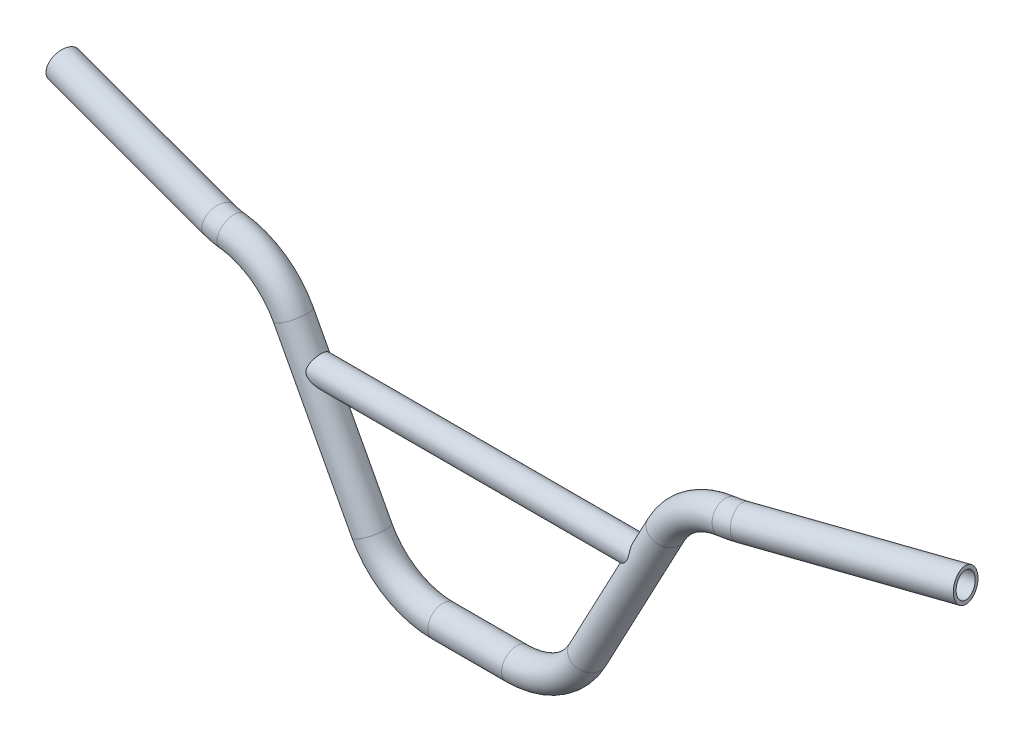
ISO-10303-21;
HEADER;
FILE_DESCRIPTION(('STEP AP214'),'2;1');
FILE_NAME('part.step','',(''),(''),'','','');
FILE_SCHEMA(('AUTOMOTIVE_DESIGN { 1 0 10303 214 1 1 1 1 }'));
ENDSEC;
DATA;
#1=APPLICATION_CONTEXT('core data for automotive mechanical design processes');
#2=APPLICATION_PROTOCOL_DEFINITION('international standard','automotive_design',2000,#1);
#3=PRODUCT_CONTEXT('',#1,'mechanical');
#4=PRODUCT('Part','Part','',(#3));
#5=PRODUCT_RELATED_PRODUCT_CATEGORY('part','',(#4));
#6=PRODUCT_DEFINITION_FORMATION('','',#4);
#7=PRODUCT_DEFINITION_CONTEXT('part definition',#1,'design');
#8=PRODUCT_DEFINITION('design','',#6,#7);
#9=PRODUCT_DEFINITION_SHAPE('','',#8);
#10=(LENGTH_UNIT() NAMED_UNIT(*) SI_UNIT(.MILLI.,.METRE.));
#11=(NAMED_UNIT(*) PLANE_ANGLE_UNIT() SI_UNIT($,.RADIAN.));
#12=(NAMED_UNIT(*) SI_UNIT($,.STERADIAN.) SOLID_ANGLE_UNIT());
#13=UNCERTAINTY_MEASURE_WITH_UNIT(LENGTH_MEASURE(1.E-05),#10,'distance_accuracy_value','');
#14=(GEOMETRIC_REPRESENTATION_CONTEXT(3) GLOBAL_UNCERTAINTY_ASSIGNED_CONTEXT((#13)) GLOBAL_UNIT_ASSIGNED_CONTEXT((#10,
#11,#12)) REPRESENTATION_CONTEXT('',''));
#15=CARTESIAN_POINT('',(0.,0.,0.));
#16=DIRECTION('',(0.,0.,1.));
#17=DIRECTION('',(1.,0.,0.));
#18=AXIS2_PLACEMENT_3D('',#15,#16,#17);
#19=CARTESIAN_POINT('',(136.367279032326,139.243628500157,0.));
#20=DIRECTION('',(-0.469471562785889,-0.882947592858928,0.));
#21=DIRECTION('',(0.882947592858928,-0.469471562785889,0.));
#22=AXIS2_PLACEMENT_3D('',#19,#20,#21);
#23=CYLINDRICAL_SURFACE('',#22,11.);
#24=CARTESIAN_POINT('',(117.196308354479,115.,9.50000000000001));
#25=CARTESIAN_POINT('',(117.052518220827,114.729564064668,9.50000432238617));
#26=CARTESIAN_POINT('',(116.891222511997,114.468532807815,9.48847273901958));
#27=CARTESIAN_POINT('',(116.543750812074,113.964906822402,9.44683527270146));
#28=CARTESIAN_POINT('',(116.357521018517,113.722353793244,9.41668869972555));
#29=CARTESIAN_POINT('',(115.966545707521,113.251106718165,9.34071155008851));
#30=CARTESIAN_POINT('',(115.761623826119,113.02258816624,9.29471705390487));
#31=CARTESIAN_POINT('',(115.340989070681,112.579450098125,9.18927419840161));
#32=CARTESIAN_POINT('',(115.125283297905,112.36482164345,9.12983460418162));
#33=CARTESIAN_POINT('',(114.711955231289,111.970658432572,9.0061476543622));
#34=CARTESIAN_POINT('',(114.515079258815,111.789914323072,8.94322353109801));
#35=CARTESIAN_POINT('',(114.117806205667,111.435862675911,8.80811170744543));
#36=CARTESIAN_POINT('',(113.917408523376,111.262556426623,8.73592241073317));
#37=CARTESIAN_POINT('',(113.51444856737,110.92224602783,8.58235369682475));
#38=CARTESIAN_POINT('',(113.311884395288,110.755248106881,8.50096549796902));
#39=CARTESIAN_POINT('',(112.906011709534,110.427019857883,8.32899593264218));
#40=CARTESIAN_POINT('',(112.702703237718,110.265789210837,8.23841507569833));
#41=CARTESIAN_POINT('',(112.297441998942,109.949435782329,8.04833349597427));
#42=CARTESIAN_POINT('',(112.095487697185,109.794285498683,7.94888183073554));
#43=CARTESIAN_POINT('',(111.692824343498,109.488941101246,7.74031087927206));
#44=CARTESIAN_POINT('',(111.492115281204,109.338746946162,7.63119167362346));
#45=CARTESIAN_POINT('',(111.093085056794,109.043374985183,7.40293315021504));
#46=CARTESIAN_POINT('',(110.894761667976,108.898192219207,7.28380416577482));
#47=CARTESIAN_POINT('',(110.501266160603,108.612754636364,7.03483932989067));
#48=CARTESIAN_POINT('',(110.306094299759,108.472500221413,6.90500260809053));
#49=CARTESIAN_POINT('',(109.914899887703,108.193544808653,6.63034634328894));
#50=CARTESIAN_POINT('',(109.718991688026,108.054983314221,6.48522107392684));
#51=CARTESIAN_POINT('',(109.333095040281,107.783869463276,6.18213497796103));
#52=CARTESIAN_POINT('',(109.14310511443,107.651315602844,6.0241773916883));
#53=CARTESIAN_POINT('',(108.770665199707,107.392935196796,5.69442175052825));
#54=CARTESIAN_POINT('',(108.588215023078,107.267108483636,5.52262404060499));
#55=CARTESIAN_POINT('',(108.232941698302,107.023260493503,5.16416654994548));
#56=CARTESIAN_POINT('',(108.060116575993,106.905237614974,4.97750983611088));
#57=CARTESIAN_POINT('',(107.761206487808,106.701923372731,4.62858327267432));
#58=CARTESIAN_POINT('',(107.632854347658,106.614915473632,4.46926905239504));
#59=CARTESIAN_POINT('',(107.385458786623,106.447668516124,4.14025700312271));
#60=CARTESIAN_POINT('',(107.266415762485,106.367429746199,3.9705587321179));
#61=CARTESIAN_POINT('',(106.926372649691,106.138761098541,3.44581808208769));
#62=CARTESIAN_POINT('',(106.721747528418,106.001896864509,3.0743262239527));
#63=CARTESIAN_POINT('',(106.422530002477,105.802317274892,2.39611596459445));
#64=CARTESIAN_POINT('',(106.313145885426,105.729559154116,2.09897503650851));
#65=CARTESIAN_POINT('',(106.180432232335,105.641394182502,1.64036882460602));
#66=CARTESIAN_POINT('',(106.141423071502,105.615502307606,1.48536227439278));
#67=CARTESIAN_POINT('',(106.074680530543,105.571224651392,1.17184631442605));
#68=CARTESIAN_POINT('',(106.046947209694,105.552838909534,1.01333688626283));
#69=CARTESIAN_POINT('',(106.003330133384,105.52393099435,0.692935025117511));
#70=CARTESIAN_POINT('',(105.987523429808,105.513459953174,0.531027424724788));
#71=CARTESIAN_POINT('',(105.968480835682,105.500846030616,0.2061446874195));
#72=CARTESIAN_POINT('',(105.965244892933,105.498703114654,0.0431695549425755));
#73=CARTESIAN_POINT('',(105.97143579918,105.502803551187,-0.282441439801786));
#74=CARTESIAN_POINT('',(105.980863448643,105.509047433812,-0.445077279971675));
#75=CARTESIAN_POINT('',(106.012120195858,105.529756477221,-0.768612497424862));
#76=CARTESIAN_POINT('',(106.03394898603,105.544221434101,-0.929511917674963));
#77=CARTESIAN_POINT('',(106.087032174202,105.579418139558,-1.23456009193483));
#78=CARTESIAN_POINT('',(106.117310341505,105.599501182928,-1.37895591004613));
#79=CARTESIAN_POINT('',(106.187119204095,105.645837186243,-1.66450710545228));
#80=CARTESIAN_POINT('',(106.226652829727,105.672092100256,-1.80566144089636));
#81=CARTESIAN_POINT('',(106.358058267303,105.759436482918,-2.22323118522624));
#82=CARTESIAN_POINT('',(106.462756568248,105.829120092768,-2.49387402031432));
#83=CARTESIAN_POINT('',(106.763663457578,106.029910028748,-3.15650011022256));
#84=CARTESIAN_POINT('',(106.978860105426,106.173930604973,-3.5359138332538));
#85=CARTESIAN_POINT('',(107.335615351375,106.414057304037,-4.07062917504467));
#86=CARTESIAN_POINT('',(107.460410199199,106.498262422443,-4.24337047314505));
#87=CARTESIAN_POINT('',(107.719480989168,106.673621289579,-4.57788239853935));
#88=CARTESIAN_POINT('',(107.853755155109,106.764773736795,-4.73965507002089));
#89=CARTESIAN_POINT('',(108.218400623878,107.013209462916,-5.15276141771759));
#90=CARTESIAN_POINT('',(108.455345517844,107.175527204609,-5.39526083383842));
#91=CARTESIAN_POINT('',(108.944435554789,107.513075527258,-5.85467755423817));
#92=CARTESIAN_POINT('',(109.196591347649,107.688315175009,-6.07157661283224));
#93=CARTESIAN_POINT('',(109.712853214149,108.050407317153,-6.48294309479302));
#94=CARTESIAN_POINT('',(109.977005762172,108.237306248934,-6.6773106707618));
#95=CARTESIAN_POINT('',(110.512839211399,108.620793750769,-7.04458658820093));
#96=CARTESIAN_POINT('',(110.784517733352,108.817379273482,-7.21750161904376));
#97=CARTESIAN_POINT('',(111.264214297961,109.169512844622,-7.50287390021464));
#98=CARTESIAN_POINT('',(111.471175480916,109.323039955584,-7.61964126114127));
#99=CARTESIAN_POINT('',(111.886813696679,109.635364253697,-7.84267300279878));
#100=CARTESIAN_POINT('',(112.095490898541,109.794161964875,-7.9489363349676));
#101=CARTESIAN_POINT('',(112.513779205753,110.117458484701,-8.15151701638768));
#102=CARTESIAN_POINT('',(112.723391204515,110.281964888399,-8.24782037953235));
#103=CARTESIAN_POINT('',(113.142137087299,110.616913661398,-8.43059646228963));
#104=CARTESIAN_POINT('',(113.351271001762,110.787355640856,-8.51706982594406));
#105=CARTESIAN_POINT('',(113.766815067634,111.134074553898,-8.67992731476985));
#106=CARTESIAN_POINT('',(113.973233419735,111.310320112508,-8.75635718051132));
#107=CARTESIAN_POINT('',(114.382848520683,111.670449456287,-8.89953147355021));
#108=CARTESIAN_POINT('',(114.586044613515,111.854334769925,-8.96627395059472));
#109=CARTESIAN_POINT('',(114.986721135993,112.230674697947,-9.08955300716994));
#110=CARTESIAN_POINT('',(115.184212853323,112.423110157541,-9.14611109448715));
#111=CARTESIAN_POINT('',(115.571111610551,112.818601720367,-9.24841782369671));
#112=CARTESIAN_POINT('',(115.760523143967,113.021651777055,-9.2941725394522));
#113=CARTESIAN_POINT('',(116.064460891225,113.368665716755,-9.35993121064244));
#114=CARTESIAN_POINT('',(116.182382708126,113.508998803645,-9.38338406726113));
#115=CARTESIAN_POINT('',(116.411618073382,113.795843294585,-9.4244899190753));
#116=CARTESIAN_POINT('',(116.522931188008,113.942355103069,-9.44214253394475));
#117=CARTESIAN_POINT('',(116.736853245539,114.241683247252,-9.4708763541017));
#118=CARTESIAN_POINT('',(116.839484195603,114.394482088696,-9.4819746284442));
#119=CARTESIAN_POINT('',(117.034232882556,114.707009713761,-9.49676829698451));
#120=CARTESIAN_POINT('',(117.126353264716,114.866736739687,-9.50046555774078));
#121=CARTESIAN_POINT('',(117.281792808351,115.16246270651,-9.49953647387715));
#122=CARTESIAN_POINT('',(117.347278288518,115.297325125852,-9.49633507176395));
#123=CARTESIAN_POINT('',(117.468609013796,115.571031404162,-9.48381131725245));
#124=CARTESIAN_POINT('',(117.524456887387,115.709874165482,-9.47449063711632));
#125=CARTESIAN_POINT('',(117.625560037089,115.990685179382,-9.44925365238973));
#126=CARTESIAN_POINT('',(117.670822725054,116.132651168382,-9.43334198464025));
#127=CARTESIAN_POINT('',(117.750291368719,116.418721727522,-9.3945760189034));
#128=CARTESIAN_POINT('',(117.784497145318,116.562826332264,-9.37172160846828));
#129=CARTESIAN_POINT('',(117.841839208,116.851793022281,-9.31892778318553));
#130=CARTESIAN_POINT('',(117.864985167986,116.996654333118,-9.28899459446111));
#131=CARTESIAN_POINT('',(117.900788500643,117.286020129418,-9.22204804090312));
#132=CARTESIAN_POINT('',(117.913445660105,117.430524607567,-9.18503453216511));
#133=CARTESIAN_POINT('',(117.929223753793,117.718333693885,-9.10401296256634));
#134=CARTESIAN_POINT('',(117.932328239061,117.861635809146,-9.05999297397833));
#135=CARTESIAN_POINT('',(117.930132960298,118.145951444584,-8.96523643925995));
#136=CARTESIAN_POINT('',(117.924830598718,118.286964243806,-8.91449782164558));
#137=CARTESIAN_POINT('',(117.90275753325,118.633878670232,-8.78033763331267));
#138=CARTESIAN_POINT('',(117.881665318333,118.838006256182,-8.69301717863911));
#139=CARTESIAN_POINT('',(117.82761811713,119.238387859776,-8.50500183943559));
#140=CARTESIAN_POINT('',(117.794657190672,119.434637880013,-8.40430027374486));
#141=CARTESIAN_POINT('',(117.720200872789,119.818722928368,-8.19013595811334));
#142=CARTESIAN_POINT('',(117.678692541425,120.006544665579,-8.07665397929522));
#143=CARTESIAN_POINT('',(117.589960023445,120.372914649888,-7.83770508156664));
#144=CARTESIAN_POINT('',(117.5427365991,120.551464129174,-7.71223976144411));
#145=CARTESIAN_POINT('',(117.442609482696,120.906750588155,-7.44392768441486));
#146=CARTESIAN_POINT('',(117.389545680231,121.083042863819,-7.30055229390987));
#147=CARTESIAN_POINT('',(117.281707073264,121.424619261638,-7.00183870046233));
#148=CARTESIAN_POINT('',(117.226932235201,121.589903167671,-6.84650026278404));
#149=CARTESIAN_POINT('',(117.117396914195,121.908885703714,-6.52446451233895));
#150=CARTESIAN_POINT('',(117.062636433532,122.06258863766,-6.35777146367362));
#151=CARTESIAN_POINT('',(116.954536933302,122.357893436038,-6.01355412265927));
#152=CARTESIAN_POINT('',(116.90119796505,122.499494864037,-5.83602944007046));
#153=CARTESIAN_POINT('',(116.786360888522,122.798043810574,-5.43284488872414));
#154=CARTESIAN_POINT('',(116.725467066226,122.952076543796,-5.20484185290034));
#155=CARTESIAN_POINT('',(116.609375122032,123.240357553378,-4.7352324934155));
#156=CARTESIAN_POINT('',(116.554177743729,123.374603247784,-4.4936244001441));
#157=CARTESIAN_POINT('',(116.451034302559,123.622069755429,-3.99831924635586));
#158=CARTESIAN_POINT('',(116.403089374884,123.735287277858,-3.74462030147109));
#159=CARTESIAN_POINT('',(116.315778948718,123.939455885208,-3.22699745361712));
#160=CARTESIAN_POINT('',(116.276412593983,124.030409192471,-2.96307457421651));
#161=CARTESIAN_POINT('',(116.209296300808,124.1844436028,-2.44242195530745));
#162=CARTESIAN_POINT('',(116.181010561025,124.248821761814,-2.18614474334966));
#163=CARTESIAN_POINT('',(116.133684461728,124.356106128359,-1.66828883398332));
#164=CARTESIAN_POINT('',(116.114643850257,124.399012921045,-1.40671028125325));
#165=CARTESIAN_POINT('',(116.086275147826,124.462820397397,-0.880480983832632));
#166=CARTESIAN_POINT('',(116.076942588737,124.483731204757,-0.615831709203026));
#167=CARTESIAN_POINT('',(116.06820183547,124.503318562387,-0.085553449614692));
#168=CARTESIAN_POINT('',(116.068793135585,124.501996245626,0.180075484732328));
#169=CARTESIAN_POINT('',(116.079485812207,124.478028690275,0.691136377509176));
#170=CARTESIAN_POINT('',(116.088905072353,124.456912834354,0.936656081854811));
#171=CARTESIAN_POINT('',(116.116085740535,124.395760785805,1.42484712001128));
#172=CARTESIAN_POINT('',(116.133846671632,124.355725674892,1.66751861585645));
#173=CARTESIAN_POINT('',(116.177339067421,124.257156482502,2.14831914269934));
#174=CARTESIAN_POINT('',(116.203069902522,124.19862386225,2.38644853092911));
#175=CARTESIAN_POINT('',(116.261969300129,124.06363678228,2.85662653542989));
#176=CARTESIAN_POINT('',(116.295138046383,123.987181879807,3.0886750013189));
#177=CARTESIAN_POINT('',(116.368496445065,123.81642552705,3.54695357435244));
#178=CARTESIAN_POINT('',(116.408736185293,123.721996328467,3.77312799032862));
#179=CARTESIAN_POINT('',(116.495214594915,123.516470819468,4.2165685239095));
#180=CARTESIAN_POINT('',(116.541453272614,123.405374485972,4.4338346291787));
#181=CARTESIAN_POINT('',(116.638951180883,123.167309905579,4.85842731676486));
#182=CARTESIAN_POINT('',(116.690212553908,123.040334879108,5.06574960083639));
#183=CARTESIAN_POINT('',(116.796580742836,122.771398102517,5.4693868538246));
#184=CARTESIAN_POINT('',(116.851687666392,122.62943593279,5.66570151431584));
#185=CARTESIAN_POINT('',(116.968742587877,122.319876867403,6.06112210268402));
#186=CARTESIAN_POINT('',(117.030890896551,122.151148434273,6.25928364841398));
#187=CARTESIAN_POINT('',(117.15613640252,121.79816150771,6.64097806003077));
#188=CARTESIAN_POINT('',(117.219233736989,121.613900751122,6.8245087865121));
#189=CARTESIAN_POINT('',(117.344000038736,121.230633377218,7.17613202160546));
#190=CARTESIAN_POINT('',(117.405668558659,121.031622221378,7.34421974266));
#191=CARTESIAN_POINT('',(117.524580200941,120.619657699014,7.66403386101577));
#192=CARTESIAN_POINT('',(117.581824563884,120.406708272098,7.81576484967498));
#193=CARTESIAN_POINT('',(117.674232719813,120.024806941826,8.06466808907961));
#194=CARTESIAN_POINT('',(117.711263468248,119.85884808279,8.16575507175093));
#195=CARTESIAN_POINT('',(117.778894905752,119.520050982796,8.3580535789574));
#196=CARTESIAN_POINT('',(117.809497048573,119.347214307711,8.44926733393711));
#197=CARTESIAN_POINT('',(117.861946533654,118.995458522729,8.62116939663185));
#198=CARTESIAN_POINT('',(117.883809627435,118.816550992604,8.7018764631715));
#199=CARTESIAN_POINT('',(117.916208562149,118.453183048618,8.85235285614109));
#200=CARTESIAN_POINT('',(117.926748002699,118.268724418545,8.92212565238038));
#201=CARTESIAN_POINT('',(117.93285112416,117.938979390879,9.03522687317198));
#202=CARTESIAN_POINT('',(117.931327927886,117.794561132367,9.08093137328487));
#203=CARTESIAN_POINT('',(117.918699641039,117.504104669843,9.16527756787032));
#204=CARTESIAN_POINT('',(117.907597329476,117.358066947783,9.20392130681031));
#205=CARTESIAN_POINT('',(117.874802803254,117.065625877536,9.27392872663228));
#206=CARTESIAN_POINT('',(117.853125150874,116.919223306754,9.30530233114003));
#207=CARTESIAN_POINT('',(117.798588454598,116.62716329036,9.36079372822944));
#208=CARTESIAN_POINT('',(117.76573101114,116.481505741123,9.38491255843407));
#209=CARTESIAN_POINT('',(117.665740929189,116.106162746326,9.4382489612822));
#210=CARTESIAN_POINT('',(117.589842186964,115.877959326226,9.46198483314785));
#211=CARTESIAN_POINT('',(117.411670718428,115.431232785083,9.49285665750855));
#212=CARTESIAN_POINT('',(117.309404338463,115.212707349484,9.49999660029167));
#213=CARTESIAN_POINT('',(117.196308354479,115.,9.50000000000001));
#214=B_SPLINE_CURVE_WITH_KNOTS('',3,(#24,#25,#26,#27,#28,#29,#30,#31,#32,#33,#34,#35,#36,#37,
#38,#39,#40,#41,#42,#43,#44,#45,#46,#47,#48,#49,#50,#51,#52,#53,#54,#55,#56,#57,#58,#59,#60,#61,
#62,#63,#64,#65,#66,#67,#68,#69,#70,#71,#72,#73,#74,#75,#76,#77,#78,#79,#80,#81,#82,#83,#84,#85,
#86,#87,#88,#89,#90,#91,#92,#93,#94,#95,#96,#97,#98,#99,#100,#101,#102,#103,#104,#105,#106,#107,
#108,#109,#110,#111,#112,#113,#114,#115,#116,#117,#118,#119,#120,#121,#122,#123,#124,#125,#126,
#127,#128,#129,#130,#131,#132,#133,#134,#135,#136,#137,#138,#139,#140,#141,#142,#143,#144,#145,
#146,#147,#148,#149,#150,#151,#152,#153,#154,#155,#156,#157,#158,#159,#160,#161,#162,#163,#164,
#165,#166,#167,#168,#169,#170,#171,#172,#173,#174,#175,#176,#177,#178,#179,#180,#181,#182,#183,
#184,#185,#186,#187,#188,#189,#190,#191,#192,#193,#194,#195,#196,#197,#198,#199,#200,#201,#202,
#203,#204,#205,#206,#207,#208,#209,#210,#211,#212,#213),.UNSPECIFIED.,.T.,.F.,(4,2,2,2,2,2,2,2,
2,2,2,2,2,2,2,2,2,2,2,2,2,2,2,2,2,2,2,2,2,2,2,2,2,2,2,2,2,2,2,2,2,2,2,2,2,2,2,2,2,2,2,2,2,2,2,2,
2,2,2,2,2,2,2,2,2,2,2,2,2,2,2,2,2,2,2,2,2,2,2,2,2,2,2,2,2,2,2,2,2,2,2,2,2,2,4),(0.,
0.91827472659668,1.8385638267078,2.76867261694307,3.69817679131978,4.52158235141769,
5.34512996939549,6.16947052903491,6.9937654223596,7.81375518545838,8.63373811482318,
9.45288471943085,10.2720979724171,11.1130061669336,11.953702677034,12.7943782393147,
13.6348807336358,14.3013093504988,14.967766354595,16.2971834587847,17.2678092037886,
17.7530540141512,18.2383013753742,18.7266574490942,19.2150114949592,19.7033964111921,
20.1917692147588,20.6379870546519,21.0843463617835,21.9766983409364,23.3465748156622,
24.0336119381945,24.7205206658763,25.8464142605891,26.973105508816,28.1046128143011,
29.2357663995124,30.0842558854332,30.9328299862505,31.7825799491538,32.6322742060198,
33.4779537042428,34.3238032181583,35.1678449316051,36.0114109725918,36.5655421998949,
37.1197097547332,37.6724276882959,38.2250062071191,38.6744342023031,39.1237394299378,
39.5727291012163,40.0217260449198,40.4703295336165,40.9189421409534,41.3683267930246,
41.8178503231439,42.4858631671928,43.1542108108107,43.823577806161,44.4928556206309,
45.1923099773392,45.8917780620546,46.5909849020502,47.2902169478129,48.1345762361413,
48.9790456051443,49.8236470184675,50.6681640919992,51.4643578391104,52.2605298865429,
53.0563353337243,53.8521002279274,54.5910406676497,55.3299388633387,56.068778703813,
56.8076367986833,57.551956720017,58.2962776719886,59.0409175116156,59.7855782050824,
60.5874517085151,61.3894422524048,62.191680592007,62.9936931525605,63.586738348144,
64.1796492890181,64.7714866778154,65.3631358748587,65.8171689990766,66.2710704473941,
66.724348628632,67.1775619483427,67.8999909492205,68.6222462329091),.UNSPECIFIED.);
#215=CARTESIAN_POINT('',(117.196308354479,115.,9.50000000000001));
#216=VERTEX_POINT('',#215);
#217=EDGE_CURVE('E87',#216,#216,#214,.T.);
#218=ORIENTED_EDGE('',*,*,#217,.T.);
#219=EDGE_LOOP('',(#218));
#220=FACE_BOUND('',#219,.T.);
#221=CARTESIAN_POINT('',(78.9166190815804,31.1946518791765,0.));
#222=DIRECTION('',(0.469471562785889,0.882947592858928,0.));
#223=DIRECTION('',(0.,0.,-1.));
#224=AXIS2_PLACEMENT_3D('',#221,#222,#223);
#225=CIRCLE('',#224,11.);
#226=CARTESIAN_POINT('',(88.6290426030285,26.0304646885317,0.));
#227=VERTEX_POINT('',#226);
#228=EDGE_CURVE('E152',#227,#227,#225,.F.);
#229=ORIENTED_EDGE('',*,*,#228,.F.);
#230=EDGE_LOOP('',(#229));
#231=FACE_BOUND('',#230,.T.);
#232=CARTESIAN_POINT('',(136.367279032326,139.243628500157,0.));
#233=DIRECTION('',(0.469471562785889,0.882947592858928,0.));
#234=DIRECTION('',(0.,0.,-1.));
#235=AXIS2_PLACEMENT_3D('',#232,#233,#234);
#236=CIRCLE('',#235,11.);
#237=CARTESIAN_POINT('',(126.654855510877,144.407815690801,0.));
#238=VERTEX_POINT('',#237);
#239=EDGE_CURVE('E148',#238,#238,#236,.F.);
#240=ORIENTED_EDGE('',*,*,#239,.T.);
#241=EDGE_LOOP('',(#240));
#242=FACE_BOUND('',#241,.T.);
#243=ADVANCED_FACE('F33',(#220,#231,#242),#23,.T.);
#244=CARTESIAN_POINT('',(136.367279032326,139.243628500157,0.));
#245=DIRECTION('',(-0.469471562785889,-0.882947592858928,0.));
#246=DIRECTION('',(0.882947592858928,-0.469471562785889,0.));
#247=AXIS2_PLACEMENT_3D('',#244,#245,#246);
#248=CYLINDRICAL_SURFACE('',#247,8.5);
#249=CARTESIAN_POINT('',(78.9166190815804,31.1946518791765,0.));
#250=DIRECTION('',(0.469471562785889,0.882947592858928,0.));
#251=DIRECTION('',(0.,0.,-1.));
#252=AXIS2_PLACEMENT_3D('',#249,#250,#251);
#253=CIRCLE('',#252,8.5);
#254=CARTESIAN_POINT('',(86.4216736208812,27.2041435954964,0.));
#255=VERTEX_POINT('',#254);
#256=EDGE_CURVE('E453',#255,#255,#253,.T.);
#257=ORIENTED_EDGE('',*,*,#256,.F.);
#258=EDGE_LOOP('',(#257));
#259=FACE_BOUND('',#258,.T.);
#260=CARTESIAN_POINT('',(128.052318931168,105.5,0.));
#261=CARTESIAN_POINT('',(128.052318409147,105.500000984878,-0.223559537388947));
#262=CARTESIAN_POINT('',(128.046520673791,105.507902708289,-0.447135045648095));
#263=CARTESIAN_POINT('',(128.023381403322,105.539389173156,-0.892586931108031));
#264=CARTESIAN_POINT('',(128.006038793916,105.56297537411,-1.11446314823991));
#265=CARTESIAN_POINT('',(127.959955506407,105.62547898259,-1.55494699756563));
#266=CARTESIAN_POINT('',(127.931209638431,105.664403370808,-1.77355309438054));
#267=CARTESIAN_POINT('',(127.862564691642,105.756991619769,-2.20582322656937));
#268=CARTESIAN_POINT('',(127.822665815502,105.810655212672,-2.41948735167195));
#269=CARTESIAN_POINT('',(127.732155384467,105.931756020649,-2.83983321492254));
#270=CARTESIAN_POINT('',(127.681575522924,105.999152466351,-3.04653355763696));
#271=CARTESIAN_POINT('',(127.569971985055,106.146868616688,-3.45234610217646));
#272=CARTESIAN_POINT('',(127.50894826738,106.227188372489,-3.65145827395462));
#273=CARTESIAN_POINT('',(127.376805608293,106.399654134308,-4.04096648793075));
#274=CARTESIAN_POINT('',(127.305688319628,106.491798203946,-4.23136395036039));
#275=CARTESIAN_POINT('',(127.153618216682,106.686768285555,-4.60262578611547));
#276=CARTESIAN_POINT('',(127.072660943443,106.789599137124,-4.78348578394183));
#277=CARTESIAN_POINT('',(126.896646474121,107.010267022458,-5.14404061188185));
#278=CARTESIAN_POINT('',(126.801071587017,107.128608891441,-5.32317366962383));
#279=CARTESIAN_POINT('',(126.599457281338,107.373953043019,-5.66906965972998));
#280=CARTESIAN_POINT('',(126.493421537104,107.500952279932,-5.83583689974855));
#281=CARTESIAN_POINT('',(126.2706576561,107.761951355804,-6.15657698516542));
#282=CARTESIAN_POINT('',(126.153919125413,107.895957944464,-6.31053711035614));
#283=CARTESIAN_POINT('',(125.90947624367,108.168759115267,-6.6048757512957));
#284=CARTESIAN_POINT('',(125.781773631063,108.307552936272,-6.74525641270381));
#285=CARTESIAN_POINT('',(125.536155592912,108.564890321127,-6.99039850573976));
#286=CARTESIAN_POINT('',(125.419974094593,108.683096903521,-7.09725598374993));
#287=CARTESIAN_POINT('',(125.178634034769,108.919310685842,-7.30065019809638));
#288=CARTESIAN_POINT('',(125.053474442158,109.03731786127,-7.39718574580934));
#289=CARTESIAN_POINT('',(124.793457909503,109.270614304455,-7.57931417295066));
#290=CARTESIAN_POINT('',(124.658615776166,109.385907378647,-7.66492322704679));
#291=CARTESIAN_POINT('',(124.377970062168,109.6109082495,-7.82474861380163));
#292=CARTESIAN_POINT('',(124.232172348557,109.720618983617,-7.89897098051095));
#293=CARTESIAN_POINT('',(123.981963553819,109.893567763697,-8.01130199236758));
#294=CARTESIAN_POINT('',(123.88103913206,109.959575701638,-8.05292889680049));
#295=CARTESIAN_POINT('',(123.673948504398,110.086272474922,-8.13085500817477));
#296=CARTESIAN_POINT('',(123.567784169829,110.146963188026,-8.16715609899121));
#297=CARTESIAN_POINT('',(123.350445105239,110.261493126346,-8.23413317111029));
#298=CARTESIAN_POINT('',(123.239283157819,110.315348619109,-8.26482258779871));
#299=CARTESIAN_POINT('',(123.011995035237,110.414968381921,-8.32050156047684));
#300=CARTESIAN_POINT('',(122.895869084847,110.460733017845,-8.34549137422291));
#301=CARTESIAN_POINT('',(122.658254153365,110.543315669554,-8.38988613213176));
#302=CARTESIAN_POINT('',(122.536727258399,110.580052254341,-8.40924051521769));
#303=CARTESIAN_POINT('',(122.290267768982,110.643243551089,-8.44215300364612));
#304=CARTESIAN_POINT('',(122.165335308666,110.669698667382,-8.45571133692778));
#305=CARTESIAN_POINT('',(121.913113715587,110.712144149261,-8.47731458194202));
#306=CARTESIAN_POINT('',(121.785822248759,110.728123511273,-8.48535369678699));
#307=CARTESIAN_POINT('',(121.530142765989,110.749982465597,-8.49632237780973));
#308=CARTESIAN_POINT('',(121.401754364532,110.755858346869,-8.49925006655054));
#309=CARTESIAN_POINT('',(121.104470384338,110.758744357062,-8.50069229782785));
#310=CARTESIAN_POINT('',(120.935536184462,110.752384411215,-8.49752902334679));
#311=CARTESIAN_POINT('',(120.599004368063,110.72618993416,-8.48438208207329));
#312=CARTESIAN_POINT('',(120.43140744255,110.706348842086,-8.47439509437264));
#313=CARTESIAN_POINT('',(120.097858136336,110.655686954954,-8.44853533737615));
#314=CARTESIAN_POINT('',(119.931912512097,110.624832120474,-8.43264431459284));
#315=CARTESIAN_POINT('',(119.602429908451,110.55439771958,-8.39572500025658));
#316=CARTESIAN_POINT('',(119.438894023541,110.514814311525,-8.37469444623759));
#317=CARTESIAN_POINT('',(119.098385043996,110.424548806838,-8.32575111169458));
#318=CARTESIAN_POINT('',(118.9216700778,110.373158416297,-8.29736520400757));
#319=CARTESIAN_POINT('',(118.571168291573,110.264003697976,-8.23554944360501));
#320=CARTESIAN_POINT('',(118.39738110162,110.206240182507,-8.20212023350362));
#321=CARTESIAN_POINT('',(118.052342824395,110.085720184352,-8.13048416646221));
#322=CARTESIAN_POINT('',(117.881094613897,110.022958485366,-8.09227229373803));
#323=CARTESIAN_POINT('',(117.541139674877,109.893600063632,-8.01127416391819));
#324=CARTESIAN_POINT('',(117.372433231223,109.827002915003,-7.9684873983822));
#325=CARTESIAN_POINT('',(116.86889296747,109.622395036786,-7.83314152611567));
#326=CARTESIAN_POINT('',(116.53766384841,109.479938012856,-7.73381148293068));
#327=CARTESIAN_POINT('',(115.884208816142,109.188260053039,-7.51709881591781));
#328=CARTESIAN_POINT('',(115.561983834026,109.039038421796,-7.39971433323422));
#329=CARTESIAN_POINT('',(115.051012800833,108.796301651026,-7.19572975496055));
#330=CARTESIAN_POINT('',(114.859380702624,108.703840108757,-7.11506050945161));
#331=CARTESIAN_POINT('',(114.479671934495,108.518300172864,-6.94645793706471));
#332=CARTESIAN_POINT('',(114.29159475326,108.425221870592,-6.85852566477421));
#333=CARTESIAN_POINT('',(113.919065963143,108.238938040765,-6.67496498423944));
#334=CARTESIAN_POINT('',(113.734617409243,108.145732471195,-6.57933040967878));
#335=CARTESIAN_POINT('',(113.369856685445,107.959816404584,-6.37999935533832));
#336=CARTESIAN_POINT('',(113.189544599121,107.867105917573,-6.27630271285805));
#337=CARTESIAN_POINT('',(112.834604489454,107.683286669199,-6.06099222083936));
#338=CARTESIAN_POINT('',(112.659949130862,107.592171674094,-5.94942888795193));
#339=CARTESIAN_POINT('',(112.315860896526,107.411577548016,-5.71729569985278));
#340=CARTESIAN_POINT('',(112.146427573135,107.322098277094,-5.59672661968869));
#341=CARTESIAN_POINT('',(111.813792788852,107.145529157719,-5.34609762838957));
#342=CARTESIAN_POINT('',(111.650584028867,107.058436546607,-5.21604938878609));
#343=CARTESIAN_POINT('',(111.331275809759,106.887304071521,-4.94568056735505));
#344=CARTESIAN_POINT('',(111.17517417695,106.803263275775,-4.80536316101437));
#345=CARTESIAN_POINT('',(110.903166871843,106.656282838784,-4.54421507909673));
#346=CARTESIAN_POINT('',(110.785681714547,106.592605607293,-4.42544524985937));
#347=CARTESIAN_POINT('',(110.556818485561,106.468243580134,-4.18066709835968));
#348=CARTESIAN_POINT('',(110.4454398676,106.407558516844,-4.05465942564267));
#349=CARTESIAN_POINT('',(110.229685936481,106.28974260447,-3.79496550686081));
#350=CARTESIAN_POINT('',(110.125316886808,106.232614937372,-3.66127258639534));
#351=CARTESIAN_POINT('',(109.924856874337,106.122680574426,-3.3860250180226));
#352=CARTESIAN_POINT('',(109.828768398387,106.069875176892,-3.24446802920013));
#353=CARTESIAN_POINT('',(109.645137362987,105.96879728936,-2.95155626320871));
#354=CARTESIAN_POINT('',(109.557720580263,105.920591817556,-2.80009890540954));
#355=CARTESIAN_POINT('',(109.394555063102,105.830493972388,-2.48924227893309));
#356=CARTESIAN_POINT('',(109.318802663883,105.788599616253,-2.32984552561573));
#357=CARTESIAN_POINT('',(109.180902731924,105.712254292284,-2.00392812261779));
#358=CARTESIAN_POINT('',(109.118726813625,105.677787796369,-1.83742322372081));
#359=CARTESIAN_POINT('',(109.009639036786,105.6172698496,-1.49801251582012));
#360=CARTESIAN_POINT('',(108.962720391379,105.591214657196,-1.32510959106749));
#361=CARTESIAN_POINT('',(108.896102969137,105.554202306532,-1.02157542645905));
#362=CARTESIAN_POINT('',(108.8724781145,105.541069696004,-0.892059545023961));
#363=CARTESIAN_POINT('',(108.834749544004,105.520092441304,-0.63123307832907));
#364=CARTESIAN_POINT('',(108.820643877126,105.512246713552,-0.499922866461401));
#365=CARTESIAN_POINT('',(108.802273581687,105.502028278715,-0.236450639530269));
#366=CARTESIAN_POINT('',(108.798005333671,105.499653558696,-0.104288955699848));
#367=CARTESIAN_POINT('',(108.799397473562,105.500428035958,0.159971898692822));
#368=CARTESIAN_POINT('',(108.805058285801,105.50357746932,0.292071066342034));
#369=CARTESIAN_POINT('',(108.82616176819,105.515315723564,0.555032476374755));
#370=CARTESIAN_POINT('',(108.84158943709,105.523896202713,0.685896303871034));
#371=CARTESIAN_POINT('',(108.881874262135,105.546292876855,0.945746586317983));
#372=CARTESIAN_POINT('',(108.906734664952,105.560110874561,1.07473237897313));
#373=CARTESIAN_POINT('',(108.965378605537,105.592689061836,1.33006486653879));
#374=CARTESIAN_POINT('',(108.999165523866,105.611451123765,1.45641054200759));
#375=CARTESIAN_POINT('',(109.075023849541,105.653546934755,1.70582004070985));
#376=CARTESIAN_POINT('',(109.117097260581,105.676881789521,1.82888306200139));
#377=CARTESIAN_POINT('',(109.225649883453,105.737037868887,2.11569150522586));
#378=CARTESIAN_POINT('',(109.29542277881,105.775667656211,2.27781964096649));
#379=CARTESIAN_POINT('',(109.447307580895,105.859638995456,2.59435012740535));
#380=CARTESIAN_POINT('',(109.52942456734,105.904983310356,2.74874926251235));
#381=CARTESIAN_POINT('',(109.791928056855,106.049690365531,3.20030471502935));
#382=CARTESIAN_POINT('',(109.988344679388,106.157659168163,3.4855111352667));
#383=CARTESIAN_POINT('',(110.367084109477,106.364874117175,3.9671349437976));
#384=CARTESIAN_POINT('',(110.543625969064,106.461148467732,4.16958451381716));
#385=CARTESIAN_POINT('',(110.911950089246,106.661118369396,4.55636089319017));
#386=CARTESIAN_POINT('',(111.103741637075,106.764818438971,4.74067650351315));
#387=CARTESIAN_POINT('',(111.499781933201,106.977803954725,5.0928210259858));
#388=CARTESIAN_POINT('',(111.704058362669,107.087101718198,5.26061097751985));
#389=CARTESIAN_POINT('',(112.122490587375,107.309521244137,5.58072773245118));
#390=CARTESIAN_POINT('',(112.336649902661,107.42264436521,5.73304896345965));
#391=CARTESIAN_POINT('',(112.744726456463,107.636478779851,6.00453086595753));
#392=CARTESIAN_POINT('',(112.937653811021,107.736890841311,6.1254278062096));
#393=CARTESIAN_POINT('',(113.328899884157,107.938828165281,6.3571590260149));
#394=CARTESIAN_POINT('',(113.527218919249,108.040353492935,6.46799271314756));
#395=CARTESIAN_POINT('',(113.92882004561,108.243876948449,6.68030243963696));
#396=CARTESIAN_POINT('',(114.132106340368,108.345875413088,6.78177018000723));
#397=CARTESIAN_POINT('',(114.543069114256,108.5495344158,6.97576290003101));
#398=CARTESIAN_POINT('',(114.75074573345,108.651194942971,7.06828759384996));
#399=CARTESIAN_POINT('',(115.170116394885,108.853343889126,7.24476414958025));
#400=CARTESIAN_POINT('',(115.381808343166,108.953832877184,7.328720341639));
#401=CARTESIAN_POINT('',(115.809192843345,109.152799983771,7.48842574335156));
#402=CARTESIAN_POINT('',(116.024885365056,109.251278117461,7.56417501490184));
#403=CARTESIAN_POINT('',(116.460110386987,109.445059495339,7.7076034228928));
#404=CARTESIAN_POINT('',(116.679639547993,109.540365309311,7.77528921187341));
#405=CARTESIAN_POINT('',(117.122838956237,109.726494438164,7.90271130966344));
#406=CARTESIAN_POINT('',(117.346508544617,109.817318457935,7.96244887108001));
#407=CARTESIAN_POINT('',(117.757899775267,109.976949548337,8.06388500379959));
#408=CARTESIAN_POINT('',(117.944895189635,110.046788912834,8.1068989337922));
#409=CARTESIAN_POINT('',(118.322130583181,110.180807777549,8.18727590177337));
#410=CARTESIAN_POINT('',(118.512370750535,110.244986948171,8.22463861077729));
#411=CARTESIAN_POINT('',(118.896185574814,110.365787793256,8.29330463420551));
#412=CARTESIAN_POINT('',(119.089757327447,110.422415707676,8.32461296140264));
#413=CARTESIAN_POINT('',(119.480428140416,110.525663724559,8.38055791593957));
#414=CARTESIAN_POINT('',(119.677526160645,110.572286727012,8.40519647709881));
#415=CARTESIAN_POINT('',(120.157162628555,110.668734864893,8.45542900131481));
#416=CARTESIAN_POINT('',(120.441580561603,110.712026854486,8.47726815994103));
#417=CARTESIAN_POINT('',(120.87093530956,110.748123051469,8.49539238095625));
#418=CARTESIAN_POINT('',(121.014370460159,110.755354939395,8.49899820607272));
#419=CARTESIAN_POINT('',(121.301429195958,110.758639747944,8.50064043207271));
#420=CARTESIAN_POINT('',(121.445052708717,110.754696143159,8.49867856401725));
#421=CARTESIAN_POINT('',(121.705427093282,110.736179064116,8.48939972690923));
#422=CARTESIAN_POINT('',(121.822360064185,110.723647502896,8.48311062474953));
#423=CARTESIAN_POINT('',(122.054605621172,110.689813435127,8.46597038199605));
#424=CARTESIAN_POINT('',(122.169918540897,110.668512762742,8.45512019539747));
#425=CARTESIAN_POINT('',(122.397983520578,110.617155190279,8.42861212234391));
#426=CARTESIAN_POINT('',(122.510736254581,110.58710062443,8.41295551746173));
#427=CARTESIAN_POINT('',(122.732877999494,110.518684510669,8.37671219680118));
#428=CARTESIAN_POINT('',(122.842266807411,110.480322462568,8.35612518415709));
#429=CARTESIAN_POINT('',(123.056439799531,110.396350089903,8.31015503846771));
#430=CARTESIAN_POINT('',(123.161246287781,110.350781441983,8.28479933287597));
#431=CARTESIAN_POINT('',(123.366559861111,110.253267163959,8.22931879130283));
#432=CARTESIAN_POINT('',(123.467065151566,110.201318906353,8.19919198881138));
#433=CARTESIAN_POINT('',(123.762149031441,110.037438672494,8.10179208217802));
#434=CARTESIAN_POINT('',(123.950075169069,109.917561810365,8.02754715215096));
#435=CARTESIAN_POINT('',(124.286345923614,109.680878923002,7.87238675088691));
#436=CARTESIAN_POINT('',(124.436704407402,109.565552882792,7.79345650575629));
#437=CARTESIAN_POINT('',(124.725801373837,109.329341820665,7.62330827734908));
#438=CARTESIAN_POINT('',(124.864531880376,109.208453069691,7.53208196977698));
#439=CARTESIAN_POINT('',(125.131714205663,108.964252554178,7.33785777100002));
#440=CARTESIAN_POINT('',(125.260147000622,108.840936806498,7.23483890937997));
#441=CARTESIAN_POINT('',(125.507449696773,108.594606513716,7.01768466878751));
#442=CARTESIAN_POINT('',(125.626321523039,108.471591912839,6.90355153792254));
#443=CARTESIAN_POINT('',(125.86179169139,108.220832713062,6.65773649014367));
#444=CARTESIAN_POINT('',(125.977871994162,108.093219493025,6.52542447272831));
#445=CARTESIAN_POINT('',(126.200714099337,107.842392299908,6.24927647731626));
#446=CARTESIAN_POINT('',(126.307475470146,107.719178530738,6.10543996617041));
#447=CARTESIAN_POINT('',(126.511904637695,107.478818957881,5.80676896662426));
#448=CARTESIAN_POINT('',(126.609575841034,107.361670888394,5.65193863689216));
#449=CARTESIAN_POINT('',(126.795929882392,107.1348339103,5.33176003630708));
#450=CARTESIAN_POINT('',(126.88461258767,107.025145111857,5.16641161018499));
#451=CARTESIAN_POINT('',(127.068050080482,106.795581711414,4.79513493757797));
#452=CARTESIAN_POINT('',(127.161028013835,106.677423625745,4.58725705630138));
#453=CARTESIAN_POINT('',(127.334019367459,106.455283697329,4.1588528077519));
#454=CARTESIAN_POINT('',(127.414030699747,106.351304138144,3.93832441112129));
#455=CARTESIAN_POINT('',(127.560561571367,106.159387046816,3.48623464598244));
#456=CARTESIAN_POINT('',(127.627088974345,106.071440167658,3.25467980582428));
#457=CARTESIAN_POINT('',(127.746177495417,105.913117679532,2.78219389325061));
#458=CARTESIAN_POINT('',(127.798742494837,105.842737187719,2.54126544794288));
#459=CARTESIAN_POINT('',(127.878488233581,105.73555145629,2.11106985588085));
#460=CARTESIAN_POINT('',(127.908733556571,105.694742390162,1.92335293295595));
#461=CARTESIAN_POINT('',(127.960735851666,105.624428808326,1.54459102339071));
#462=CARTESIAN_POINT('',(127.982490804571,105.594926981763,1.35354525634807));
#463=CARTESIAN_POINT('',(128.017350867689,105.547595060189,0.969281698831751));
#464=CARTESIAN_POINT('',(128.030458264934,105.529761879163,0.776064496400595));
#465=CARTESIAN_POINT('',(128.047941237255,105.505965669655,0.388568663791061));
#466=CARTESIAN_POINT('',(128.052319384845,105.499999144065,0.194290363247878));
#467=CARTESIAN_POINT('',(128.052318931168,105.5,0.));
#468=B_SPLINE_CURVE_WITH_KNOTS('',3,(#260,#261,#262,#263,#264,#265,#266,#267,#268,#269,#270,
#271,#272,#273,#274,#275,#276,#277,#278,#279,#280,#281,#282,#283,#284,#285,#286,#287,#288,#289,
#290,#291,#292,#293,#294,#295,#296,#297,#298,#299,#300,#301,#302,#303,#304,#305,#306,#307,#308,
#309,#310,#311,#312,#313,#314,#315,#316,#317,#318,#319,#320,#321,#322,#323,#324,#325,#326,#327,
#328,#329,#330,#331,#332,#333,#334,#335,#336,#337,#338,#339,#340,#341,#342,#343,#344,#345,#346,
#347,#348,#349,#350,#351,#352,#353,#354,#355,#356,#357,#358,#359,#360,#361,#362,#363,#364,#365,
#366,#367,#368,#369,#370,#371,#372,#373,#374,#375,#376,#377,#378,#379,#380,#381,#382,#383,#384,
#385,#386,#387,#388,#389,#390,#391,#392,#393,#394,#395,#396,#397,#398,#399,#400,#401,#402,#403,
#404,#405,#406,#407,#408,#409,#410,#411,#412,#413,#414,#415,#416,#417,#418,#419,#420,#421,#422,
#423,#424,#425,#426,#427,#428,#429,#430,#431,#432,#433,#434,#435,#436,#437,#438,#439,#440,#441,
#442,#443,#444,#445,#446,#447,#448,#449,#450,#451,#452,#453,#454,#455,#456,#457,#458,#459,#460,
#461,#462,#463,#464,#465,#466,#467),.UNSPECIFIED.,.T.,.F.,(4,2,2,2,2,2,2,2,2,2,2,2,2,2,2,2,2,2,
2,2,2,2,2,2,2,2,2,2,2,2,2,2,2,2,2,2,2,2,2,2,2,2,2,2,2,2,2,2,2,2,2,2,2,2,2,2,2,2,2,2,2,2,2,2,2,2,
2,2,2,2,2,2,2,2,2,2,2,2,2,2,2,2,2,2,2,2,2,2,2,2,2,2,2,2,2,2,2,2,2,2,2,2,2,4),(0.,
0.670492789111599,1.34104797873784,2.01190870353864,2.68275723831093,3.35164247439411,
4.02053035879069,4.68930884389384,5.35839152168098,6.06267087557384,6.76670372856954,
7.47142768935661,8.17604011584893,8.76722152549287,9.35847093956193,9.94883470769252,
10.5388845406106,10.921334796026,11.3036494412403,11.685036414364,12.0664061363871,
12.4510989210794,12.8357765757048,13.2208576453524,13.6060801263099,14.1124738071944,
14.6191141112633,15.1273340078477,15.6357780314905,16.1941688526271,16.752488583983,
17.3113988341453,17.8703712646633,18.9916436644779,20.1130315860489,20.7955584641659,
21.4779864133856,22.1609662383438,22.8439598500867,23.5229091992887,24.2018001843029,
24.8798689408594,25.5577289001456,26.0938405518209,26.6299041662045,27.1664405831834,
27.7031375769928,28.2467357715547,28.7901628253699,29.3324425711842,29.8744807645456,
30.2709780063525,30.667393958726,31.0636640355,31.459951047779,31.8556308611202,
32.2514469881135,32.6474132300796,33.0434753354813,33.5846724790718,34.1260929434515,
35.2099362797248,36.0649299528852,36.9204483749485,37.7779377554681,38.6357349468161,
39.3819686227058,40.1282462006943,40.8751788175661,41.6221352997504,42.3687124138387,
43.1152838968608,43.8612351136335,44.607068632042,45.2194941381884,45.8319552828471,
46.4439071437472,47.055681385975,47.9184348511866,48.3489931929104,48.7794176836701,
49.1323384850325,49.4851855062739,49.8379385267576,50.1907127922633,50.5415168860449,
50.892465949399,51.5950861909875,52.2101205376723,52.8255733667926,53.4421381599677,
54.0585784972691,54.7102429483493,55.3619375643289,56.013386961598,56.6648459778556,
57.433479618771,58.2022369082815,58.9705445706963,59.7386384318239,60.3215355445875,
60.9045711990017,61.4874525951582,62.0701621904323),.UNSPECIFIED.);
#469=CARTESIAN_POINT('',(128.052318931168,105.5,0.));
#470=VERTEX_POINT('',#469);
#471=EDGE_CURVE('E74',#470,#470,#468,.T.);
#472=ORIENTED_EDGE('',*,*,#471,.T.);
#473=EDGE_LOOP('',(#472));
#474=FACE_BOUND('',#473,.T.);
#475=ADVANCED_FACE('F208',(#259,#474),#248,.F.);
#476=CARTESIAN_POINT('',(-188.283898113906,111.639072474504,0.));
#477=DIRECTION('',(0.,0.,-1.));
#478=DIRECTION('',(-1.,0.,0.));
#479=AXIS2_PLACEMENT_3D('',#476,#477,#478);
#480=TOROIDAL_SURFACE('',#479,58.7992079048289,11.);
#481=CARTESIAN_POINT('',(-181.118077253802,170.,0.));
#482=DIRECTION('',(0.992546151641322,-0.121869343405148,0.));
#483=DIRECTION('',(0.,0.,-1.));
#484=AXIS2_PLACEMENT_3D('',#481,#482,#483);
#485=CIRCLE('',#484,11.);
#486=CARTESIAN_POINT('',(-179.777514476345,180.918007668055,0.));
#487=VERTEX_POINT('',#486);
#488=EDGE_CURVE('E542',#487,#487,#485,.T.);
#489=CARTESIAN_POINT('',(-136.367279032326,139.243628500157,0.));
#490=DIRECTION('',(0.469471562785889,-0.882947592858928,0.));
#491=DIRECTION('',(0.,0.,-1.));
#492=AXIS2_PLACEMENT_3D('',#489,#490,#491);
#493=CIRCLE('',#492,11.);
#494=CARTESIAN_POINT('',(-126.654855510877,144.407815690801,0.));
#495=VERTEX_POINT('',#494);
#496=EDGE_CURVE('E182',#495,#495,#493,.T.);
#497=CARTESIAN_POINT('',(-188.283898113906,111.639072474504,0.));
#498=DIRECTION('',(0.,0.,-1.));
#499=DIRECTION('',(-1.,0.,0.));
#500=AXIS2_PLACEMENT_3D('',#497,#498,#499);
#501=CIRCLE('',#500,69.7992079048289);
#502=EDGE_CURVE('',#487,#495,#501,.T.);
#503=ORIENTED_EDGE('',*,*,#488,.T.);
#504=ORIENTED_EDGE('',*,*,#496,.F.);
#505=ORIENTED_EDGE('',*,*,#502,.T.);
#506=ORIENTED_EDGE('',*,*,#502,.F.);
#507=EDGE_LOOP('',(#503,#505,#504,#506));
#508=FACE_BOUND('',#507,.T.);
#509=ADVANCED_FACE('F209',(#508),#480,.T.);
#510=CARTESIAN_POINT('',(-136.367279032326,139.243628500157,0.));
#511=DIRECTION('',(0.469471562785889,-0.882947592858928,0.));
#512=DIRECTION('',(0.882947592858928,0.469471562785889,0.));
#513=AXIS2_PLACEMENT_3D('',#510,#511,#512);
#514=CYLINDRICAL_SURFACE('',#513,11.);
#515=CARTESIAN_POINT('',(-116.0696821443,124.5,0.));
#516=CARTESIAN_POINT('',(-116.069682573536,124.499999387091,0.252606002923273));
#517=CARTESIAN_POINT('',(-116.074188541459,124.489914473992,0.505222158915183));
#518=CARTESIAN_POINT('',(-116.092114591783,124.449687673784,1.00853822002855));
#519=CARTESIAN_POINT('',(-116.105535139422,124.419544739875,1.25923802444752));
#520=CARTESIAN_POINT('',(-116.14100011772,124.339528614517,1.75691298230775));
#521=CARTESIAN_POINT('',(-116.163046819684,124.289650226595,2.00388713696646));
#522=CARTESIAN_POINT('',(-116.215281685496,124.170699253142,2.49227757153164));
#523=CARTESIAN_POINT('',(-116.245469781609,124.101626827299,2.73369389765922));
#524=CARTESIAN_POINT('',(-116.313236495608,123.94519883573,3.20870325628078));
#525=CARTESIAN_POINT('',(-116.3507946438,123.857893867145,3.44231590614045));
#526=CARTESIAN_POINT('',(-116.432537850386,123.665692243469,3.90097557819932));
#527=CARTESIAN_POINT('',(-116.47672292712,123.560795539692,4.12602257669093));
#528=CARTESIAN_POINT('',(-116.570757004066,123.334258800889,4.56633837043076));
#529=CARTESIAN_POINT('',(-116.62060715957,123.21261534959,4.78160515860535));
#530=CARTESIAN_POINT('',(-116.724829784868,122.953493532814,5.2012262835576));
#531=CARTESIAN_POINT('',(-116.779202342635,122.816014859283,5.40558040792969));
#532=CARTESIAN_POINT('',(-116.893949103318,122.518865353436,5.81233379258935));
#533=CARTESIAN_POINT('',(-116.954487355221,122.358430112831,6.01412839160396));
#534=CARTESIAN_POINT('',(-117.077332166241,122.021990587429,6.40374181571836));
#535=CARTESIAN_POINT('',(-117.139638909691,121.845984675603,6.59155917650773));
#536=CARTESIAN_POINT('',(-117.263916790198,121.479170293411,6.9524522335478));
#537=CARTESIAN_POINT('',(-117.325887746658,121.288354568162,7.12552061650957));
#538=CARTESIAN_POINT('',(-117.446845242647,120.892756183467,7.45599305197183));
#539=CARTESIAN_POINT('',(-117.505832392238,120.687976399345,7.61340031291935));
#540=CARTESIAN_POINT('',(-117.605909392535,120.309067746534,7.88072462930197));
#541=CARTESIAN_POINT('',(-117.648171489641,120.137409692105,7.99371399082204));
#542=CARTESIAN_POINT('',(-117.726693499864,119.786085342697,8.20888599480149));
#543=CARTESIAN_POINT('',(-117.762953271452,119.606418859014,8.31106838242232));
#544=CARTESIAN_POINT('',(-117.826917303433,119.239893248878,8.50388812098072));
#545=CARTESIAN_POINT('',(-117.854636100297,119.053046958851,8.59454493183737));
#546=CARTESIAN_POINT('',(-117.898623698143,118.672668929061,8.7638338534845));
#547=CARTESIAN_POINT('',(-117.91489673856,118.479139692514,8.84247040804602));
#548=CARTESIAN_POINT('',(-117.930292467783,118.138986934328,8.96773705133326));
#549=CARTESIAN_POINT('',(-117.932828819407,117.993600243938,9.01731326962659));
#550=CARTESIAN_POINT('',(-117.928607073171,117.700728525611,9.10931410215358));
#551=CARTESIAN_POINT('',(-117.921851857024,117.553244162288,9.15174092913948));
#552=CARTESIAN_POINT('',(-117.897879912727,117.257449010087,9.22915217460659));
#553=CARTESIAN_POINT('',(-117.880682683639,117.109140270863,9.26415030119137));
#554=CARTESIAN_POINT('',(-117.834988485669,116.812677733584,9.32669001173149));
#555=CARTESIAN_POINT('',(-117.806491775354,116.664523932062,9.35423176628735));
#556=CARTESIAN_POINT('',(-117.737739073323,116.369241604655,9.40200098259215));
#557=CARTESIAN_POINT('',(-117.697444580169,116.222118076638,9.42220400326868));
#558=CARTESIAN_POINT('',(-117.605385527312,115.930688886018,9.45543944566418));
#559=CARTESIAN_POINT('',(-117.553620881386,115.786383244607,9.46847181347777));
#560=CARTESIAN_POINT('',(-117.439343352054,115.501437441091,9.48783367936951));
#561=CARTESIAN_POINT('',(-117.37681676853,115.360802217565,9.49415455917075));
#562=CARTESIAN_POINT('',(-117.242212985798,115.084011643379,9.50063790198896));
#563=CARTESIAN_POINT('',(-117.170132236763,114.947857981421,9.50079806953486));
#564=CARTESIAN_POINT('',(-116.980549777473,114.615059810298,9.49428649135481));
#565=CARTESIAN_POINT('',(-116.858050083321,114.421325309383,9.48424211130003));
#566=CARTESIAN_POINT('',(-116.599089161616,114.044308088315,9.45370178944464));
#567=CARTESIAN_POINT('',(-116.462619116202,113.861032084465,9.43319921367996));
#568=CARTESIAN_POINT('',(-116.178832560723,113.503394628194,9.38311694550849));
#569=CARTESIAN_POINT('',(-116.031479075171,113.32906732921,9.35350511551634));
#570=CARTESIAN_POINT('',(-115.729093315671,112.98876246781,9.28628089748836));
#571=CARTESIAN_POINT('',(-115.574057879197,112.822788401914,9.24866519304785));
#572=CARTESIAN_POINT('',(-115.247318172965,112.486623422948,9.16324732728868));
#573=CARTESIAN_POINT('',(-115.075210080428,112.316962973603,9.11491326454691));
#574=CARTESIAN_POINT('',(-114.726621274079,111.984754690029,9.0104716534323));
#575=CARTESIAN_POINT('',(-114.550141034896,111.822206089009,8.95436494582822));
#576=CARTESIAN_POINT('',(-114.194043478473,111.503042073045,8.83461163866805));
#577=CARTESIAN_POINT('',(-114.014422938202,111.346433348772,8.77095685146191));
#578=CARTESIAN_POINT('',(-113.653368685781,111.038574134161,8.63627983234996));
#579=CARTESIAN_POINT('',(-113.471934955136,110.88732369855,8.56525752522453));
#580=CARTESIAN_POINT('',(-113.108090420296,110.589539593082,8.41579487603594));
#581=CARTESIAN_POINT('',(-112.92567917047,110.44300833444,8.33735082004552));
#582=CARTESIAN_POINT('',(-112.560749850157,110.154325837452,8.17294521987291));
#583=CARTESIAN_POINT('',(-112.37823177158,110.012174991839,8.08698300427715));
#584=CARTESIAN_POINT('',(-112.013960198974,109.732107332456,7.90739897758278));
#585=CARTESIAN_POINT('',(-111.832206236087,109.594187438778,7.81378292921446));
#586=CARTESIAN_POINT('',(-111.470020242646,109.322338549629,7.61854041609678));
#587=CARTESIAN_POINT('',(-111.289588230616,109.188409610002,7.51691383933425));
#588=CARTESIAN_POINT('',(-110.85279222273,108.867192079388,7.25930945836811));
#589=CARTESIAN_POINT('',(-110.597484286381,108.681991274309,7.09889572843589));
#590=CARTESIAN_POINT('',(-110.093203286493,108.320053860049,6.75942918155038));
#591=CARTESIAN_POINT('',(-109.844231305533,108.143318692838,6.58037320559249));
#592=CARTESIAN_POINT('',(-109.35588680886,107.799626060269,6.2023963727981));
#593=CARTESIAN_POINT('',(-109.116493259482,107.632646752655,6.00352281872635));
#594=CARTESIAN_POINT('',(-108.650097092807,107.309575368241,5.58368242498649));
#595=CARTESIAN_POINT('',(-108.423088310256,107.153477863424,5.36272673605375));
#596=CARTESIAN_POINT('',(-108.066445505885,106.909599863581,4.98256178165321));
#597=CARTESIAN_POINT('',(-107.931771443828,106.81785242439,4.83062691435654));
#598=CARTESIAN_POINT('',(-107.670505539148,106.640411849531,4.51661755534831));
#599=CARTESIAN_POINT('',(-107.543914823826,106.554719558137,4.35454165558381));
#600=CARTESIAN_POINT('',(-107.178948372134,106.308318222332,3.85271833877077));
#601=CARTESIAN_POINT('',(-106.954854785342,106.157927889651,3.49683336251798));
#602=CARTESIAN_POINT('',(-106.60816808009,105.92605373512,2.82970658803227));
#603=CARTESIAN_POINT('',(-106.474089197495,105.836678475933,2.52729739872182));
#604=CARTESIAN_POINT('',(-106.304792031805,105.724022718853,2.0572499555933));
#605=CARTESIAN_POINT('',(-106.253661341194,105.690037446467,1.89781982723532));
#606=CARTESIAN_POINT('',(-106.163122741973,105.629901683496,1.57425821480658));
#607=CARTESIAN_POINT('',(-106.12370927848,105.603747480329,1.41012899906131));
#608=CARTESIAN_POINT('',(-106.057287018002,105.55969141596,1.07662959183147));
#609=CARTESIAN_POINT('',(-106.03039912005,105.541869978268,0.907224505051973));
#610=CARTESIAN_POINT('',(-105.990359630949,105.515337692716,0.566077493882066));
#611=CARTESIAN_POINT('',(-105.977207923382,105.506626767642,0.39433558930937));
#612=CARTESIAN_POINT('',(-105.965050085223,105.498573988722,0.0501885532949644));
#613=CARTESIAN_POINT('',(-105.966039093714,105.499228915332,-0.122216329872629));
#614=CARTESIAN_POINT('',(-105.982119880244,105.509880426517,-0.466062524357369));
#615=CARTESIAN_POINT('',(-105.997210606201,105.519876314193,-0.637503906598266));
#616=CARTESIAN_POINT('',(-106.038128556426,105.546993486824,-0.955320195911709));
#617=CARTESIAN_POINT('',(-106.062271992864,105.562997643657,-1.10201169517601));
#618=CARTESIAN_POINT('',(-106.120290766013,105.601480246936,-1.39260388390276));
#619=CARTESIAN_POINT('',(-106.154169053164,105.623960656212,-1.53650371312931));
#620=CARTESIAN_POINT('',(-106.26946132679,105.7005227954,-1.96288497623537));
#621=CARTESIAN_POINT('',(-106.364550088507,105.763736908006,-2.24017639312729));
#622=CARTESIAN_POINT('',(-106.554582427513,105.890370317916,-2.70288454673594));
#623=CARTESIAN_POINT('',(-106.642445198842,105.948999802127,-2.89267815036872));
#624=CARTESIAN_POINT('',(-106.831718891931,106.075554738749,-3.26226786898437));
#625=CARTESIAN_POINT('',(-106.93313629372,106.14348463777,-3.4420591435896));
#626=CARTESIAN_POINT('',(-107.14749517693,106.287404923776,-3.79163691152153));
#627=CARTESIAN_POINT('',(-107.260455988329,106.363408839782,-3.96140584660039));
#628=CARTESIAN_POINT('',(-107.495848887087,106.522226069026,-4.29077613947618));
#629=CARTESIAN_POINT('',(-107.618279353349,106.605038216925,-4.45037922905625));
#630=CARTESIAN_POINT('',(-107.948146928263,106.828865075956,-4.85425054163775));
#631=CARTESIAN_POINT('',(-108.161888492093,106.974573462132,-5.09078778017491));
#632=CARTESIAN_POINT('',(-108.60458550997,107.278272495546,-5.54063449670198));
#633=CARTESIAN_POINT('',(-108.833550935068,107.436271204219,-5.7539285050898));
#634=CARTESIAN_POINT('',(-109.303503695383,107.763064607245,-6.1599432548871));
#635=CARTESIAN_POINT('',(-109.544531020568,107.931895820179,-6.35258785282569));
#636=CARTESIAN_POINT('',(-110.034712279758,108.278494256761,-6.71824449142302));
#637=CARTESIAN_POINT('',(-110.283864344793,108.456259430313,-6.89126100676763));
#638=CARTESIAN_POINT('',(-110.73952788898,108.785146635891,-7.18781928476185));
#639=CARTESIAN_POINT('',(-110.94505306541,108.9348399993,-7.31448577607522));
#640=CARTESIAN_POINT('',(-111.358735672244,109.23950522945,-7.55675792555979));
#641=CARTESIAN_POINT('',(-111.566893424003,109.394477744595,-7.67236221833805));
#642=CARTESIAN_POINT('',(-111.984988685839,109.709917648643,-7.89317022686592));
#643=CARTESIAN_POINT('',(-112.194927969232,109.870391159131,-7.99836181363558));
#644=CARTESIAN_POINT('',(-112.615273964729,110.196921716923,-8.19860476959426));
#645=CARTESIAN_POINT('',(-112.825680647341,110.362978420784,-8.29365676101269));
#646=CARTESIAN_POINT('',(-113.245183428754,110.700661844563,-8.4736171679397));
#647=CARTESIAN_POINT('',(-113.454281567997,110.872269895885,-8.55855583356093));
#648=CARTESIAN_POINT('',(-113.870532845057,111.222323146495,-8.71872812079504));
#649=CARTESIAN_POINT('',(-114.077685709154,111.400769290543,-8.79396039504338));
#650=CARTESIAN_POINT('',(-114.488055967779,111.765269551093,-8.93446240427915));
#651=CARTESIAN_POINT('',(-114.691279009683,111.951311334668,-8.99974753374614));
#652=CARTESIAN_POINT('',(-115.091922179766,112.332662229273,-9.12004942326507));
#653=CARTESIAN_POINT('',(-115.289344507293,112.527967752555,-9.17507011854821));
#654=CARTESIAN_POINT('',(-115.613494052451,112.865297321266,-9.25811822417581));
#655=CARTESIAN_POINT('',(-115.742582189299,113.004313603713,-9.28914263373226));
#656=CARTESIAN_POINT('',(-115.995474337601,113.288208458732,-9.34562614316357));
#657=CARTESIAN_POINT('',(-116.119278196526,113.433087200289,-9.37108508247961));
#658=CARTESIAN_POINT('',(-116.359847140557,113.729196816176,-9.41580843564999));
#659=CARTESIAN_POINT('',(-116.476621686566,113.880418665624,-9.43508133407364));
#660=CARTESIAN_POINT('',(-116.701337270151,114.190018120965,-9.46668540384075));
#661=CARTESIAN_POINT('',(-116.809279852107,114.348394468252,-9.47901779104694));
#662=CARTESIAN_POINT('',(-116.996012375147,114.644191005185,-9.49427745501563));
#663=CARTESIAN_POINT('',(-117.076593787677,114.780410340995,-9.49847558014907));
#664=CARTESIAN_POINT('',(-117.228691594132,115.057855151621,-9.50083603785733));
#665=CARTESIAN_POINT('',(-117.300210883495,115.199079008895,-9.49900030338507));
#666=CARTESIAN_POINT('',(-117.432681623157,115.485900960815,-9.48864838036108));
#667=CARTESIAN_POINT('',(-117.49365102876,115.63149111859,-9.48014368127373));
#668=CARTESIAN_POINT('',(-117.604002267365,115.926427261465,-9.45587729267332));
#669=CARTESIAN_POINT('',(-117.653384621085,116.075773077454,-9.44011592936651));
#670=CARTESIAN_POINT('',(-117.740099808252,116.377770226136,-9.40080033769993));
#671=CARTESIAN_POINT('',(-117.777369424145,116.530434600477,-9.37720648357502));
#672=CARTESIAN_POINT('',(-117.839471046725,116.83683750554,-9.32203089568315));
#673=CARTESIAN_POINT('',(-117.864302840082,116.99057605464,-9.29044902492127));
#674=CARTESIAN_POINT('',(-117.902187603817,117.297903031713,-9.21924970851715));
#675=CARTESIAN_POINT('',(-117.915220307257,117.451490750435,-9.17961857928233));
#676=CARTESIAN_POINT('',(-117.930581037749,117.756990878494,-9.09253835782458));
#677=CARTESIAN_POINT('',(-117.9329055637,117.9089027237,-9.04508671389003));
#678=CARTESIAN_POINT('',(-117.927577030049,118.254781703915,-8.92742616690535));
#679=CARTESIAN_POINT('',(-117.916752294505,118.447825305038,-8.85464559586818));
#680=CARTESIAN_POINT('',(-117.882736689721,118.827831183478,-8.69712988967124));
#681=CARTESIAN_POINT('',(-117.859541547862,119.014791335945,-8.61239063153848));
#682=CARTESIAN_POINT('',(-117.803741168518,119.382093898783,-8.43144457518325));
#683=CARTESIAN_POINT('',(-117.771115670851,119.562421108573,-8.33521335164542));
#684=CARTESIAN_POINT('',(-117.699061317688,119.915464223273,-8.1320174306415));
#685=CARTESIAN_POINT('',(-117.659632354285,120.088180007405,-8.02505256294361));
#686=CARTESIAN_POINT('',(-117.561688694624,120.483967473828,-7.76211294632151));
#687=CARTESIAN_POINT('',(-117.501286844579,120.703817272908,-7.60197468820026));
#688=CARTESIAN_POINT('',(-117.376220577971,121.128308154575,-7.26412123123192));
#689=CARTESIAN_POINT('',(-117.311554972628,121.332944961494,-7.08640112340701));
#690=CARTESIAN_POINT('',(-117.181195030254,121.726115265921,-6.71435776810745));
#691=CARTESIAN_POINT('',(-117.115500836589,121.914650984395,-6.52003681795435));
#692=CARTESIAN_POINT('',(-116.985664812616,122.274673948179,-6.11574799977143));
#693=CARTESIAN_POINT('',(-116.921522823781,122.446162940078,-5.90578173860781));
#694=CARTESIAN_POINT('',(-116.796560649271,122.77194845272,-5.47002978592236));
#695=CARTESIAN_POINT('',(-116.735761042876,122.926143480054,-5.24416220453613));
#696=CARTESIAN_POINT('',(-116.619692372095,123.215047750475,-4.77890846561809));
#697=CARTESIAN_POINT('',(-116.56442359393,123.349755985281,-4.53952160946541));
#698=CARTESIAN_POINT('',(-116.461013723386,123.598344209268,-4.04895321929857));
#699=CARTESIAN_POINT('',(-116.41286644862,123.712242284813,-3.79778216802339));
#700=CARTESIAN_POINT('',(-116.324949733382,123.91815733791,-3.28522631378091));
#701=CARTESIAN_POINT('',(-116.285178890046,124.010177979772,-3.02384322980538));
#702=CARTESIAN_POINT('',(-116.220802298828,124.158108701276,-2.53631940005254));
#703=CARTESIAN_POINT('',(-116.194780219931,124.217462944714,-2.31140393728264));
#704=CARTESIAN_POINT('',(-116.149815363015,124.319611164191,-1.85715498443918));
#705=CARTESIAN_POINT('',(-116.130871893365,124.362406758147,-1.6278219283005));
#706=CARTESIAN_POINT('',(-116.100421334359,124.43103783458,-1.16617884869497));
#707=CARTESIAN_POINT('',(-116.088913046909,124.456876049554,-0.93386931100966));
#708=CARTESIAN_POINT('',(-116.073542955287,124.49135808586,-0.467709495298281));
#709=CARTESIAN_POINT('',(-116.06968174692,124.500000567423,-0.233859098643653));
#710=CARTESIAN_POINT('',(-116.0696821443,124.5,0.));
#711=B_SPLINE_CURVE_WITH_KNOTS('',3,(#515,#516,#517,#518,#519,#520,#521,#522,#523,#524,#525,
#526,#527,#528,#529,#530,#531,#532,#533,#534,#535,#536,#537,#538,#539,#540,#541,#542,#543,#544,
#545,#546,#547,#548,#549,#550,#551,#552,#553,#554,#555,#556,#557,#558,#559,#560,#561,#562,#563,
#564,#565,#566,#567,#568,#569,#570,#571,#572,#573,#574,#575,#576,#577,#578,#579,#580,#581,#582,
#583,#584,#585,#586,#587,#588,#589,#590,#591,#592,#593,#594,#595,#596,#597,#598,#599,#600,#601,
#602,#603,#604,#605,#606,#607,#608,#609,#610,#611,#612,#613,#614,#615,#616,#617,#618,#619,#620,
#621,#622,#623,#624,#625,#626,#627,#628,#629,#630,#631,#632,#633,#634,#635,#636,#637,#638,#639,
#640,#641,#642,#643,#644,#645,#646,#647,#648,#649,#650,#651,#652,#653,#654,#655,#656,#657,#658,
#659,#660,#661,#662,#663,#664,#665,#666,#667,#668,#669,#670,#671,#672,#673,#674,#675,#676,#677,
#678,#679,#680,#681,#682,#683,#684,#685,#686,#687,#688,#689,#690,#691,#692,#693,#694,#695,#696,
#697,#698,#699,#700,#701,#702,#703,#704,#705,#706,#707,#708,#709,#710),.UNSPECIFIED.,.T.,.F.,(4,
2,2,2,2,2,2,2,2,2,2,2,2,2,2,2,2,2,2,2,2,2,2,2,2,2,2,2,2,2,2,2,2,2,2,2,2,2,2,2,2,2,2,2,2,2,2,2,2,
2,2,2,2,2,2,2,2,2,2,2,2,2,2,2,2,2,2,2,2,2,2,2,2,2,2,2,2,2,2,2,2,2,2,2,2,2,2,2,2,2,2,2,2,2,2,2,2,
4),(0.,0.757595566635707,1.51523067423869,2.27306540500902,3.03089383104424,3.78664650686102,
4.54240127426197,5.29831044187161,6.054234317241,6.84782022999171,7.64148916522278,
8.43554937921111,9.22944658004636,9.85840822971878,10.4873847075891,11.1152846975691,
11.7429519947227,12.20343167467,12.6637685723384,13.1232484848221,13.5827178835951,
14.0437037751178,14.5046931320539,14.9662737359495,15.4280263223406,16.1151483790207,
16.8027068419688,17.49271939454,18.1830184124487,18.9220848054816,19.6610713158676,
20.4008668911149,21.1406700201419,21.8808453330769,22.6210868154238,23.3607759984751,
24.1004755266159,25.1614345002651,26.2225735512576,27.2812378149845,28.3393701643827,
29.0073308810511,29.675384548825,31.0090100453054,32.0328509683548,32.5448245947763,
33.0565551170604,33.5731275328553,34.0896955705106,34.6060860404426,35.1224379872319,
35.5705042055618,36.0187063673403,36.9147252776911,37.5655507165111,38.2166884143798,
38.8689349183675,39.5210700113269,40.5709387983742,41.6215021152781,42.6758149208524,
43.7298868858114,44.5818047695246,45.4338276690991,46.2868316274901,47.1397832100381,
47.9901157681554,48.8405662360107,49.6896868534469,50.5384812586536,51.1149699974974,
51.691475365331,52.2671866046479,52.8427969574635,53.3173772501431,53.7918055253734,
54.2654182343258,54.739009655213,55.2150345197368,55.6910675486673,56.1679167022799,
56.6449217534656,57.263735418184,57.8827629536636,58.5031304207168,59.1235077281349,
59.9582498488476,60.7932256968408,61.6280861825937,62.4628610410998,63.3023035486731,
64.1417894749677,64.9805422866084,65.8191545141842,66.520652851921,67.2220826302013,
67.9233993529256,68.6247707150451),.UNSPECIFIED.);
#712=CARTESIAN_POINT('',(-116.0696821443,124.5,0.));
#713=VERTEX_POINT('',#712);
#714=EDGE_CURVE('E118',#713,#713,#711,.T.);
#715=ORIENTED_EDGE('',*,*,#714,.F.);
#716=EDGE_LOOP('',(#715));
#717=FACE_BOUND('',#716,.T.);
#718=CARTESIAN_POINT('',(-78.9166190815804,31.1946518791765,0.));
#719=DIRECTION('',(0.469471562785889,-0.882947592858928,0.));
#720=DIRECTION('',(0.,0.,-1.));
#721=AXIS2_PLACEMENT_3D('',#718,#719,#720);
#722=CIRCLE('',#721,11.);
#723=CARTESIAN_POINT('',(-88.6290426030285,26.0304646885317,0.));
#724=VERTEX_POINT('',#723);
#725=EDGE_CURVE('E551',#724,#724,#722,.T.);
#726=ORIENTED_EDGE('',*,*,#725,.F.);
#727=EDGE_LOOP('',(#726));
#728=FACE_BOUND('',#727,.T.);
#729=ORIENTED_EDGE('',*,*,#496,.T.);
#730=EDGE_LOOP('',(#729));
#731=FACE_BOUND('',#730,.T.);
#732=ADVANCED_FACE('F211',(#717,#728,#731),#514,.T.);
#733=CARTESIAN_POINT('',(-27.,58.7992079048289,0.));
#734=DIRECTION('',(0.,0.,1.));
#735=DIRECTION('',(1.,0.,0.));
#736=AXIS2_PLACEMENT_3D('',#733,#734,#735);
#737=TOROIDAL_SURFACE('',#736,58.7992079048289,11.);
#738=CARTESIAN_POINT('',(-27.,0.,0.));
#739=DIRECTION('',(1.,0.,0.));
#740=DIRECTION('',(0.,0.,-1.));
#741=AXIS2_PLACEMENT_3D('',#738,#739,#740);
#742=CIRCLE('',#741,11.);
#743=CARTESIAN_POINT('',(-27.,-11.,0.));
#744=VERTEX_POINT('',#743);
#745=EDGE_CURVE('E546',#744,#744,#742,.T.);
#746=CARTESIAN_POINT('',(-27.,58.7992079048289,0.));
#747=DIRECTION('',(0.,0.,1.));
#748=DIRECTION('',(1.,0.,0.));
#749=AXIS2_PLACEMENT_3D('',#746,#747,#748);
#750=CIRCLE('',#749,69.7992079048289);
#751=EDGE_CURVE('',#724,#744,#750,.T.);
#752=ORIENTED_EDGE('',*,*,#725,.T.);
#753=ORIENTED_EDGE('',*,*,#745,.F.);
#754=ORIENTED_EDGE('',*,*,#751,.T.);
#755=ORIENTED_EDGE('',*,*,#751,.F.);
#756=EDGE_LOOP('',(#752,#754,#753,#755));
#757=FACE_BOUND('',#756,.T.);
#758=ADVANCED_FACE('F215',(#757),#737,.T.);
#759=CARTESIAN_POINT('',(-27.,0.,0.));
#760=DIRECTION('',(1.,0.,0.));
#761=DIRECTION('',(0.,1.,0.));
#762=AXIS2_PLACEMENT_3D('',#759,#760,#761);
#763=CYLINDRICAL_SURFACE('',#762,11.);
#764=ORIENTED_EDGE('',*,*,#745,.T.);
#765=EDGE_LOOP('',(#764));
#766=FACE_BOUND('',#765,.T.);
#767=CARTESIAN_POINT('',(27.,0.,0.));
#768=DIRECTION('',(1.,0.,0.));
#769=DIRECTION('',(0.,0.,-1.));
#770=AXIS2_PLACEMENT_3D('',#767,#768,#769);
#771=CIRCLE('',#770,11.);
#772=CARTESIAN_POINT('',(27.,-11.,0.));
#773=VERTEX_POINT('',#772);
#774=EDGE_CURVE('E157',#773,#773,#771,.F.);
#775=ORIENTED_EDGE('',*,*,#774,.T.);
#776=EDGE_LOOP('',(#775));
#777=FACE_BOUND('',#776,.T.);
#778=ADVANCED_FACE('F35',(#766,#777),#763,.T.);
#779=CARTESIAN_POINT('',(-188.283898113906,111.639072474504,0.));
#780=DIRECTION('',(0.,0.,-1.));
#781=DIRECTION('',(-1.,0.,0.));
#782=AXIS2_PLACEMENT_3D('',#779,#780,#781);
#783=TOROIDAL_SURFACE('',#782,58.7992079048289,8.5);
#784=CARTESIAN_POINT('',(-181.118077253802,170.,0.));
#785=DIRECTION('',(0.992546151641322,-0.121869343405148,0.));
#786=DIRECTION('',(0.,0.,-1.));
#787=AXIS2_PLACEMENT_3D('',#784,#785,#786);
#788=CIRCLE('',#787,8.5);
#789=CARTESIAN_POINT('',(-180.082187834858,178.436642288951,0.));
#790=VERTEX_POINT('',#789);
#791=EDGE_CURVE('E183',#790,#790,#788,.F.);
#792=CARTESIAN_POINT('',(-136.367279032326,139.243628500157,0.));
#793=DIRECTION('',(0.469471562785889,-0.882947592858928,0.));
#794=DIRECTION('',(0.,0.,-1.));
#795=AXIS2_PLACEMENT_3D('',#792,#793,#794);
#796=CIRCLE('',#795,8.5);
#797=CARTESIAN_POINT('',(-128.862224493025,143.234136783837,0.));
#798=VERTEX_POINT('',#797);
#799=EDGE_CURVE('E541',#798,#798,#796,.F.);
#800=CARTESIAN_POINT('',(-188.283898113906,111.639072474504,0.));
#801=DIRECTION('',(0.,0.,-1.));
#802=DIRECTION('',(-1.,0.,0.));
#803=AXIS2_PLACEMENT_3D('',#800,#801,#802);
#804=CIRCLE('',#803,67.2992079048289);
#805=EDGE_CURVE('',#790,#798,#804,.T.);
#806=ORIENTED_EDGE('',*,*,#791,.T.);
#807=ORIENTED_EDGE('',*,*,#799,.F.);
#808=ORIENTED_EDGE('',*,*,#805,.T.);
#809=ORIENTED_EDGE('',*,*,#805,.F.);
#810=EDGE_LOOP('',(#806,#808,#807,#809));
#811=FACE_BOUND('',#810,.T.);
#812=ADVANCED_FACE('F192',(#811),#783,.F.);
#813=CARTESIAN_POINT('',(-136.367279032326,139.243628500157,0.));
#814=DIRECTION('',(0.469471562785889,-0.882947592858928,0.));
#815=DIRECTION('',(0.882947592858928,0.469471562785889,0.));
#816=AXIS2_PLACEMENT_3D('',#813,#814,#815);
#817=CYLINDRICAL_SURFACE('',#816,8.5);
#818=CARTESIAN_POINT('',(-78.9166190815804,31.1946518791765,0.));
#819=DIRECTION('',(0.469471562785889,-0.882947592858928,0.));
#820=DIRECTION('',(0.,0.,-1.));
#821=AXIS2_PLACEMENT_3D('',#818,#819,#820);
#822=CIRCLE('',#821,8.5);
#823=CARTESIAN_POINT('',(-86.4216736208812,27.2041435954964,0.));
#824=VERTEX_POINT('',#823);
#825=EDGE_CURVE('E544',#824,#824,#822,.F.);
#826=ORIENTED_EDGE('',*,*,#825,.F.);
#827=EDGE_LOOP('',(#826));
#828=FACE_BOUND('',#827,.T.);
#829=ORIENTED_EDGE('',*,*,#799,.T.);
#830=EDGE_LOOP('',(#829));
#831=FACE_BOUND('',#830,.T.);
#832=ADVANCED_FACE('F195',(#828,#831),#817,.F.);
#833=CARTESIAN_POINT('',(-27.,58.7992079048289,0.));
#834=DIRECTION('',(0.,0.,1.));
#835=DIRECTION('',(1.,0.,0.));
#836=AXIS2_PLACEMENT_3D('',#833,#834,#835);
#837=TOROIDAL_SURFACE('',#836,58.7992079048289,8.5);
#838=CARTESIAN_POINT('',(-27.,0.,0.));
#839=DIRECTION('',(1.,0.,0.));
#840=DIRECTION('',(0.,0.,-1.));
#841=AXIS2_PLACEMENT_3D('',#838,#839,#840);
#842=CIRCLE('',#841,8.5);
#843=CARTESIAN_POINT('',(-27.,-8.50000000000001,0.));
#844=VERTEX_POINT('',#843);
#845=EDGE_CURVE('E554',#844,#844,#842,.F.);
#846=CARTESIAN_POINT('',(-27.,58.7992079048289,0.));
#847=DIRECTION('',(0.,0.,1.));
#848=DIRECTION('',(1.,0.,0.));
#849=AXIS2_PLACEMENT_3D('',#846,#847,#848);
#850=CIRCLE('',#849,67.2992079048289);
#851=EDGE_CURVE('',#824,#844,#850,.T.);
#852=ORIENTED_EDGE('',*,*,#825,.T.);
#853=ORIENTED_EDGE('',*,*,#845,.F.);
#854=ORIENTED_EDGE('',*,*,#851,.T.);
#855=ORIENTED_EDGE('',*,*,#851,.F.);
#856=EDGE_LOOP('',(#852,#854,#853,#855));
#857=FACE_BOUND('',#856,.T.);
#858=ADVANCED_FACE('F199',(#857),#837,.F.);
#859=CARTESIAN_POINT('',(-27.,0.,0.));
#860=DIRECTION('',(1.,0.,0.));
#861=DIRECTION('',(0.,1.,0.));
#862=AXIS2_PLACEMENT_3D('',#859,#860,#861);
#863=CYLINDRICAL_SURFACE('',#862,8.5);
#864=ORIENTED_EDGE('',*,*,#845,.T.);
#865=EDGE_LOOP('',(#864));
#866=FACE_BOUND('',#865,.T.);
#867=CARTESIAN_POINT('',(27.,0.,0.));
#868=DIRECTION('',(1.,0.,0.));
#869=DIRECTION('',(0.,0.,-1.));
#870=AXIS2_PLACEMENT_3D('',#867,#868,#869);
#871=CIRCLE('',#870,8.5);
#872=CARTESIAN_POINT('',(27.,-8.50000000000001,0.));
#873=VERTEX_POINT('',#872);
#874=EDGE_CURVE('E174',#873,#873,#871,.T.);
#875=ORIENTED_EDGE('',*,*,#874,.T.);
#876=EDGE_LOOP('',(#875));
#877=FACE_BOUND('',#876,.T.);
#878=ADVANCED_FACE('F203',(#866,#877),#863,.F.);
#879=CARTESIAN_POINT('',(-182.459640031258,115.,0.));
#880=DIRECTION('',(1.,0.,0.));
#881=DIRECTION('',(0.,0.,-1.));
#882=AXIS2_PLACEMENT_3D('',#879,#880,#881);
#883=CYLINDRICAL_SURFACE('',#882,9.50000000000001);
#884=ORIENTED_EDGE('',*,*,#714,.T.);
#885=EDGE_LOOP('',(#884));
#886=FACE_BOUND('',#885,.T.);
#887=ORIENTED_EDGE('',*,*,#217,.F.);
#888=EDGE_LOOP('',(#887));
#889=FACE_BOUND('',#888,.T.);
#890=ADVANCED_FACE('F190',(#886,#889),#883,.T.);
#891=CARTESIAN_POINT('',(-330.,188.280401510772,-25.5234503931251));
#892=DIRECTION('',(0.977467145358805,-0.120017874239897,0.173648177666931));
#893=DIRECTION('',(0.17491249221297,0.,-0.98458398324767));
#894=AXIS2_PLACEMENT_3D('',#891,#892,#893);
#895=CYLINDRICAL_SURFACE('',#894,11.);
#896=CARTESIAN_POINT('',(-191.459307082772,171.269743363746,-0.911534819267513));
#897=DIRECTION('',(-0.977467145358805,0.120017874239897,-0.173648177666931));
#898=DIRECTION('',(-0.121869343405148,-0.992546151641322,0.));
#899=AXIS2_PLACEMENT_3D('',#896,#897,#898);
#900=CIRCLE('',#899,11.);
#901=CARTESIAN_POINT('',(-192.799869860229,160.351735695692,-0.911534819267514));
#902=VERTEX_POINT('',#901);
#903=EDGE_CURVE('E171',#902,#902,#900,.T.);
#904=ORIENTED_EDGE('',*,*,#903,.T.);
#905=EDGE_LOOP('',(#904));
#906=FACE_BOUND('',#905,.T.);
#907=CARTESIAN_POINT('',(-330.,188.280401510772,-25.5234503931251));
#908=DIRECTION('',(-0.977467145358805,0.120017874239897,-0.173648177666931));
#909=DIRECTION('',(-0.121869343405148,-0.992546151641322,0.));
#910=AXIS2_PLACEMENT_3D('',#907,#908,#909);
#911=CIRCLE('',#910,11.);
#912=CARTESIAN_POINT('',(-331.340562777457,177.362393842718,-25.5234503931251));
#913=VERTEX_POINT('',#912);
#914=EDGE_CURVE('E54',#913,#913,#911,.T.);
#915=ORIENTED_EDGE('',*,*,#914,.F.);
#916=EDGE_LOOP('',(#915));
#917=FACE_BOUND('',#916,.T.);
#918=ADVANCED_FACE('F300',(#906,#917),#895,.T.);
#919=CARTESIAN_POINT('',(-181.118077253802,170.,-60.));
#920=DIRECTION('',(0.121869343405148,0.992546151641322,0.));
#921=DIRECTION('',(-0.992546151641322,0.121869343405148,0.));
#922=AXIS2_PLACEMENT_3D('',#919,#920,#921);
#923=TOROIDAL_SURFACE('',#922,60.,11.);
#924=ORIENTED_EDGE('',*,*,#488,.F.);
#925=EDGE_LOOP('',(#924));
#926=FACE_BOUND('',#925,.T.);
#927=ORIENTED_EDGE('',*,*,#903,.F.);
#928=EDGE_LOOP('',(#927));
#929=FACE_BOUND('',#928,.T.);
#930=ADVANCED_FACE('F412',(#926,#929),#923,.T.);
#931=CARTESIAN_POINT('',(-330.,188.280401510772,-25.5234503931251));
#932=DIRECTION('',(-0.977467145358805,0.120017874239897,-0.173648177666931));
#933=DIRECTION('',(-0.121869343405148,-0.992546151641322,0.));
#934=AXIS2_PLACEMENT_3D('',#931,#932,#933);
#935=PLANE('',#934);
#936=CARTESIAN_POINT('',(-330.,188.280401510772,-25.5234503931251));
#937=DIRECTION('',(-0.977467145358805,0.120017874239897,-0.173648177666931));
#938=DIRECTION('',(-0.121869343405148,-0.992546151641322,0.));
#939=AXIS2_PLACEMENT_3D('',#936,#937,#938);
#940=CIRCLE('',#939,8.50000000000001);
#941=CARTESIAN_POINT('',(-331.035889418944,179.843759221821,-25.5234503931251));
#942=VERTEX_POINT('',#941);
#943=EDGE_CURVE('E59',#942,#942,#940,.F.);
#944=ORIENTED_EDGE('',*,*,#943,.T.);
#945=EDGE_LOOP('',(#944));
#946=FACE_BOUND('',#945,.T.);
#947=ORIENTED_EDGE('',*,*,#914,.T.);
#948=EDGE_LOOP('',(#947));
#949=FACE_BOUND('',#948,.T.);
#950=ADVANCED_FACE('F418',(#946,#949),#935,.T.);
#951=CARTESIAN_POINT('',(-330.,188.280401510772,-25.5234503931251));
#952=DIRECTION('',(0.977467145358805,-0.120017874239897,0.173648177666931));
#953=DIRECTION('',(0.17491249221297,0.,-0.98458398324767));
#954=AXIS2_PLACEMENT_3D('',#951,#952,#953);
#955=CYLINDRICAL_SURFACE('',#954,8.50000000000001);
#956=CARTESIAN_POINT('',(-191.459307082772,171.269743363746,-0.911534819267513));
#957=DIRECTION('',(-0.977467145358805,0.120017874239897,-0.173648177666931));
#958=DIRECTION('',(-0.121869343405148,-0.992546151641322,0.));
#959=AXIS2_PLACEMENT_3D('',#956,#957,#958);
#960=CIRCLE('',#959,8.50000000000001);
#961=CARTESIAN_POINT('',(-192.495196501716,162.833101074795,-0.911534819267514));
#962=VERTEX_POINT('',#961);
#963=EDGE_CURVE('E166',#962,#962,#960,.F.);
#964=ORIENTED_EDGE('',*,*,#963,.T.);
#965=EDGE_LOOP('',(#964));
#966=FACE_BOUND('',#965,.T.);
#967=ORIENTED_EDGE('',*,*,#943,.F.);
#968=EDGE_LOOP('',(#967));
#969=FACE_BOUND('',#968,.T.);
#970=ADVANCED_FACE('F424',(#966,#969),#955,.F.);
#971=CARTESIAN_POINT('',(-181.118077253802,170.,-60.));
#972=DIRECTION('',(0.121869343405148,0.992546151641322,0.));
#973=DIRECTION('',(-0.992546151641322,0.121869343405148,0.));
#974=AXIS2_PLACEMENT_3D('',#971,#972,#973);
#975=TOROIDAL_SURFACE('',#974,60.,8.50000000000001);
#976=ORIENTED_EDGE('',*,*,#791,.F.);
#977=EDGE_LOOP('',(#976));
#978=FACE_BOUND('',#977,.T.);
#979=ORIENTED_EDGE('',*,*,#963,.F.);
#980=EDGE_LOOP('',(#979));
#981=FACE_BOUND('',#980,.T.);
#982=ADVANCED_FACE('F302',(#978,#981),#975,.F.);
#983=CARTESIAN_POINT('',(188.283898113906,111.639072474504,0.));
#984=DIRECTION('',(0.,0.,1.));
#985=DIRECTION('',(1.,0.,0.));
#986=AXIS2_PLACEMENT_3D('',#983,#984,#985);
#987=TOROIDAL_SURFACE('',#986,58.7992079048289,11.);
#988=CARTESIAN_POINT('',(181.118077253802,170.,0.));
#989=DIRECTION('',(0.992546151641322,0.121869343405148,0.));
#990=DIRECTION('',(0.,0.,-1.));
#991=AXIS2_PLACEMENT_3D('',#988,#989,#990);
#992=CIRCLE('',#991,11.);
#993=CARTESIAN_POINT('',(179.777514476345,180.918007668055,0.));
#994=VERTEX_POINT('',#993);
#995=EDGE_CURVE('E160',#994,#994,#992,.T.);
#996=CARTESIAN_POINT('',(188.283898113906,111.639072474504,0.));
#997=DIRECTION('',(0.,0.,1.));
#998=DIRECTION('',(1.,0.,0.));
#999=AXIS2_PLACEMENT_3D('',#996,#997,#998);
#1000=CIRCLE('',#999,69.7992079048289);
#1001=EDGE_CURVE('',#994,#238,#1000,.T.);
#1002=ORIENTED_EDGE('',*,*,#995,.F.);
#1003=ORIENTED_EDGE('',*,*,#239,.F.);
#1004=ORIENTED_EDGE('',*,*,#1001,.T.);
#1005=ORIENTED_EDGE('',*,*,#1001,.F.);
#1006=EDGE_LOOP('',(#1002,#1004,#1003,#1005));
#1007=FACE_BOUND('',#1006,.T.);
#1008=ADVANCED_FACE('F318',(#1007),#987,.T.);
#1009=CARTESIAN_POINT('',(27.,58.7992079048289,0.));
#1010=DIRECTION('',(0.,0.,-1.));
#1011=DIRECTION('',(-1.,0.,0.));
#1012=AXIS2_PLACEMENT_3D('',#1009,#1010,#1011);
#1013=TOROIDAL_SURFACE('',#1012,58.7992079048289,11.);
#1014=CARTESIAN_POINT('',(27.,58.7992079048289,0.));
#1015=DIRECTION('',(0.,0.,-1.));
#1016=DIRECTION('',(-1.,0.,0.));
#1017=AXIS2_PLACEMENT_3D('',#1014,#1015,#1016);
#1018=CIRCLE('',#1017,69.7992079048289);
#1019=EDGE_CURVE('',#227,#773,#1018,.T.);
#1020=ORIENTED_EDGE('',*,*,#228,.T.);
#1021=ORIENTED_EDGE('',*,*,#774,.F.);
#1022=ORIENTED_EDGE('',*,*,#1019,.T.);
#1023=ORIENTED_EDGE('',*,*,#1019,.F.);
#1024=EDGE_LOOP('',(#1020,#1022,#1021,#1023));
#1025=FACE_BOUND('',#1024,.T.);
#1026=ADVANCED_FACE('F391',(#1025),#1013,.T.);
#1027=CARTESIAN_POINT('',(27.,58.7992079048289,0.));
#1028=DIRECTION('',(0.,0.,-1.));
#1029=DIRECTION('',(-1.,0.,0.));
#1030=AXIS2_PLACEMENT_3D('',#1027,#1028,#1029);
#1031=TOROIDAL_SURFACE('',#1030,58.7992079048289,8.5);
#1032=CARTESIAN_POINT('',(27.,58.7992079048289,0.));
#1033=DIRECTION('',(0.,0.,-1.));
#1034=DIRECTION('',(-1.,0.,0.));
#1035=AXIS2_PLACEMENT_3D('',#1032,#1033,#1034);
#1036=CIRCLE('',#1035,67.2992079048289);
#1037=EDGE_CURVE('',#255,#873,#1036,.T.);
#1038=ORIENTED_EDGE('',*,*,#256,.T.);
#1039=ORIENTED_EDGE('',*,*,#874,.F.);
#1040=ORIENTED_EDGE('',*,*,#1037,.T.);
#1041=ORIENTED_EDGE('',*,*,#1037,.F.);
#1042=EDGE_LOOP('',(#1038,#1040,#1039,#1041));
#1043=FACE_BOUND('',#1042,.T.);
#1044=ADVANCED_FACE('F134',(#1043),#1031,.F.);
#1045=CARTESIAN_POINT('',(182.459640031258,115.,0.));
#1046=DIRECTION('',(-1.,0.,0.));
#1047=DIRECTION('',(0.,0.,1.));
#1048=AXIS2_PLACEMENT_3D('',#1045,#1046,#1047);
#1049=CYLINDRICAL_SURFACE('',#1048,9.50000000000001);
#1050=ORIENTED_EDGE('',*,*,#471,.F.);
#1051=EDGE_LOOP('',(#1050));
#1052=FACE_BOUND('',#1051,.T.);
#1053=ADVANCED_FACE('F104',(#1052),#1049,.T.);
#1054=CARTESIAN_POINT('',(330.,188.280401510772,-25.5234503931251));
#1055=DIRECTION('',(-0.977467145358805,-0.120017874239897,0.173648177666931));
#1056=DIRECTION('',(0.17491249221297,0.,0.98458398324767));
#1057=AXIS2_PLACEMENT_3D('',#1054,#1055,#1056);
#1058=CYLINDRICAL_SURFACE('',#1057,11.);
#1059=CARTESIAN_POINT('',(191.459307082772,171.269743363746,-0.911534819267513));
#1060=DIRECTION('',(-0.977467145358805,-0.120017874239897,0.173648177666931));
#1061=DIRECTION('',(0.121869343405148,-0.992546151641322,0.));
#1062=AXIS2_PLACEMENT_3D('',#1059,#1060,#1061);
#1063=CIRCLE('',#1062,11.);
#1064=CARTESIAN_POINT('',(192.799869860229,160.351735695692,-0.911534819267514));
#1065=VERTEX_POINT('',#1064);
#1066=EDGE_CURVE('E77',#1065,#1065,#1063,.F.);
#1067=ORIENTED_EDGE('',*,*,#1066,.T.);
#1068=EDGE_LOOP('',(#1067));
#1069=FACE_BOUND('',#1068,.T.);
#1070=CARTESIAN_POINT('',(330.,188.280401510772,-25.5234503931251));
#1071=DIRECTION('',(-0.977467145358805,-0.120017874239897,0.173648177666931));
#1072=DIRECTION('',(0.121869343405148,-0.992546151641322,0.));
#1073=AXIS2_PLACEMENT_3D('',#1070,#1071,#1072);
#1074=CIRCLE('',#1073,11.);
#1075=CARTESIAN_POINT('',(331.340562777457,177.362393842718,-25.5234503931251));
#1076=VERTEX_POINT('',#1075);
#1077=EDGE_CURVE('E71',#1076,#1076,#1074,.T.);
#1078=ORIENTED_EDGE('',*,*,#1077,.T.);
#1079=EDGE_LOOP('',(#1078));
#1080=FACE_BOUND('',#1079,.T.);
#1081=ADVANCED_FACE('F315',(#1069,#1080),#1058,.T.);
#1082=CARTESIAN_POINT('',(181.118077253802,170.,-60.));
#1083=DIRECTION('',(0.121869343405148,-0.992546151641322,0.));
#1084=DIRECTION('',(0.992546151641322,0.121869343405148,0.));
#1085=AXIS2_PLACEMENT_3D('',#1082,#1083,#1084);
#1086=TOROIDAL_SURFACE('',#1085,60.,11.);
#1087=ORIENTED_EDGE('',*,*,#995,.T.);
#1088=EDGE_LOOP('',(#1087));
#1089=FACE_BOUND('',#1088,.T.);
#1090=ORIENTED_EDGE('',*,*,#1066,.F.);
#1091=EDGE_LOOP('',(#1090));
#1092=FACE_BOUND('',#1091,.T.);
#1093=ADVANCED_FACE('F339',(#1089,#1092),#1086,.T.);
#1094=CARTESIAN_POINT('',(330.,188.280401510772,-25.5234503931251));
#1095=DIRECTION('',(0.977467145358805,0.120017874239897,-0.173648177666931));
#1096=DIRECTION('',(0.121869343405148,-0.992546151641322,0.));
#1097=AXIS2_PLACEMENT_3D('',#1094,#1095,#1096);
#1098=PLANE('',#1097);
#1099=CARTESIAN_POINT('',(330.,188.280401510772,-25.5234503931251));
#1100=DIRECTION('',(-0.977467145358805,-0.120017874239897,0.173648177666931));
#1101=DIRECTION('',(0.121869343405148,-0.992546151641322,0.));
#1102=AXIS2_PLACEMENT_3D('',#1099,#1100,#1101);
#1103=CIRCLE('',#1102,8.50000000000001);
#1104=CARTESIAN_POINT('',(331.035889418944,179.843759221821,-25.5234503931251));
#1105=VERTEX_POINT('',#1104);
#1106=EDGE_CURVE('E67',#1105,#1105,#1103,.T.);
#1107=ORIENTED_EDGE('',*,*,#1106,.T.);
#1108=EDGE_LOOP('',(#1107));
#1109=FACE_BOUND('',#1108,.T.);
#1110=ORIENTED_EDGE('',*,*,#1077,.F.);
#1111=EDGE_LOOP('',(#1110));
#1112=FACE_BOUND('',#1111,.T.);
#1113=ADVANCED_FACE('F348',(#1109,#1112),#1098,.T.);
#1114=CARTESIAN_POINT('',(330.,188.280401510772,-25.5234503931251));
#1115=DIRECTION('',(-0.977467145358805,-0.120017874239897,0.173648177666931));
#1116=DIRECTION('',(0.17491249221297,0.,0.98458398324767));
#1117=AXIS2_PLACEMENT_3D('',#1114,#1115,#1116);
#1118=CYLINDRICAL_SURFACE('',#1117,8.50000000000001);
#1119=CARTESIAN_POINT('',(191.459307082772,171.269743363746,-0.911534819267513));
#1120=DIRECTION('',(-0.977467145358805,-0.120017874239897,0.173648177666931));
#1121=DIRECTION('',(0.121869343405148,-0.992546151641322,0.));
#1122=AXIS2_PLACEMENT_3D('',#1119,#1120,#1121);
#1123=CIRCLE('',#1122,8.50000000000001);
#1124=CARTESIAN_POINT('',(192.924314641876,171.44962367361,7.45933108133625));
#1125=VERTEX_POINT('',#1124);
#1126=EDGE_CURVE('E70',#1125,#1125,#1123,.T.);
#1127=ORIENTED_EDGE('',*,*,#1126,.T.);
#1128=EDGE_LOOP('',(#1127));
#1129=FACE_BOUND('',#1128,.T.);
#1130=ORIENTED_EDGE('',*,*,#1106,.F.);
#1131=EDGE_LOOP('',(#1130));
#1132=FACE_BOUND('',#1131,.T.);
#1133=ADVANCED_FACE('F68',(#1129,#1132),#1118,.F.);
#1134=CARTESIAN_POINT('',(181.118077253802,170.,-60.));
#1135=DIRECTION('',(0.121869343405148,-0.992546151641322,0.));
#1136=DIRECTION('',(0.992546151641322,0.121869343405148,0.));
#1137=AXIS2_PLACEMENT_3D('',#1134,#1135,#1136);
#1138=TOROIDAL_SURFACE('',#1137,60.,8.50000000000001);
#1139=CARTESIAN_POINT('',(181.118077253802,170.,0.));
#1140=DIRECTION('',(0.992546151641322,0.121869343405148,0.));
#1141=DIRECTION('',(0.,0.,-1.));
#1142=AXIS2_PLACEMENT_3D('',#1139,#1140,#1141);
#1143=CIRCLE('',#1142,8.5);
#1144=CARTESIAN_POINT('',(181.118077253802,170.,8.49999999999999));
#1145=VERTEX_POINT('',#1144);
#1146=EDGE_CURVE('E447',#1145,#1145,#1143,.T.);
#1147=CARTESIAN_POINT('',(181.118077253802,170.,-60.));
#1148=DIRECTION('',(0.121869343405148,-0.992546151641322,0.));
#1149=DIRECTION('',(0.992546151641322,0.121869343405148,0.));
#1150=AXIS2_PLACEMENT_3D('',#1147,#1148,#1149);
#1151=CIRCLE('',#1150,68.5);
#1152=EDGE_CURVE('',#1125,#1145,#1151,.T.);
#1153=ORIENTED_EDGE('',*,*,#1126,.F.);
#1154=ORIENTED_EDGE('',*,*,#1146,.F.);
#1155=ORIENTED_EDGE('',*,*,#1152,.T.);
#1156=ORIENTED_EDGE('',*,*,#1152,.F.);
#1157=EDGE_LOOP('',(#1153,#1155,#1154,#1156));
#1158=FACE_BOUND('',#1157,.T.);
#1159=ADVANCED_FACE('F317',(#1158),#1138,.F.);
#1160=CARTESIAN_POINT('',(138.154798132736,124.5,0.));
#1161=CARTESIAN_POINT('',(138.154800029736,124.500001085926,0.138097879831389));
#1162=CARTESIAN_POINT('',(138.149374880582,124.496982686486,0.276181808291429));
#1163=CARTESIAN_POINT('',(138.127814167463,124.484989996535,0.551292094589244));
#1164=CARTESIAN_POINT('',(138.111675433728,124.476013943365,0.688318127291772));
#1165=CARTESIAN_POINT('',(138.069050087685,124.452316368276,0.960412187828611));
#1166=CARTESIAN_POINT('',(138.042550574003,124.437587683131,1.09547755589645));
#1167=CARTESIAN_POINT('',(137.979807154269,124.402734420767,1.36262395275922));
#1168=CARTESIAN_POINT('',(137.943561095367,124.382608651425,1.49470431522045));
#1169=CARTESIAN_POINT('',(137.852992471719,124.332357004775,1.78415517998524));
#1170=CARTESIAN_POINT('',(137.796442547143,124.301002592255,1.94061832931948));
#1171=CARTESIAN_POINT('',(137.671383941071,124.231743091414,2.24714210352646));
#1172=CARTESIAN_POINT('',(137.602872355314,124.193836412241,2.39720116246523));
#1173=CARTESIAN_POINT('',(137.381470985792,124.071507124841,2.83733643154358));
#1174=CARTESIAN_POINT('',(137.212768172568,123.978505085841,3.11720784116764));
#1175=CARTESIAN_POINT('',(136.888445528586,123.800409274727,3.58463842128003));
#1176=CARTESIAN_POINT('',(136.739361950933,123.718752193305,3.77825732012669));
#1177=CARTESIAN_POINT('',(136.426612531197,123.548050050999,4.15001741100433));
#1178=CARTESIAN_POINT('',(136.262938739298,123.459000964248,4.32815005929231));
#1179=CARTESIAN_POINT('',(135.923600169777,123.275150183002,4.67008230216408));
#1180=CARTESIAN_POINT('',(135.747911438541,123.180337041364,4.83385168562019));
#1181=CARTESIAN_POINT('',(135.386917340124,122.986491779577,5.14781380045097));
#1182=CARTESIAN_POINT('',(135.201608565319,122.8874581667,5.29800166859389));
#1183=CARTESIAN_POINT('',(134.847027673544,122.699087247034,5.56754468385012));
#1184=CARTESIAN_POINT('',(134.678694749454,122.610109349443,5.68839625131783));
#1185=CARTESIAN_POINT('',(134.336777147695,122.430476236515,5.92111645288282));
#1186=CARTESIAN_POINT('',(134.163191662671,122.339820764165,6.03298369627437));
#1187=CARTESIAN_POINT('',(133.635348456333,122.066114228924,6.35608750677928));
#1188=CARTESIAN_POINT('',(133.274171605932,121.881412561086,6.55470096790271));
#1189=CARTESIAN_POINT('',(132.536972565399,121.511971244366,6.92184422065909));
#1190=CARTESIAN_POINT('',(132.160949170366,121.327231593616,7.0903715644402));
#1191=CARTESIAN_POINT('',(131.587086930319,121.053634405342,7.32241739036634));
#1192=CARTESIAN_POINT('',(131.39419801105,120.9630370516,7.39629679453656));
#1193=CARTESIAN_POINT('',(131.00514153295,120.783703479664,7.53735938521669));
#1194=CARTESIAN_POINT('',(130.808974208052,120.694967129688,7.6045430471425));
#1195=CARTESIAN_POINT('',(130.402627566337,120.51546544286,7.73580359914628));
#1196=CARTESIAN_POINT('',(130.19226417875,120.424849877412,7.7995160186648));
#1197=CARTESIAN_POINT('',(129.767726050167,120.247878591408,7.91967184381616));
#1198=CARTESIAN_POINT('',(129.553551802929,120.161522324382,7.97611618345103));
#1199=CARTESIAN_POINT('',(129.12103913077,119.994700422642,8.0816277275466));
#1200=CARTESIAN_POINT('',(128.902699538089,119.91423647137,8.1306928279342));
#1201=CARTESIAN_POINT('',(128.461578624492,119.761513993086,8.22106099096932));
#1202=CARTESIAN_POINT('',(128.23879809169,119.689254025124,8.26236541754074));
#1203=CARTESIAN_POINT('',(127.842898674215,119.572267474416,8.32752762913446));
#1204=CARTESIAN_POINT('',(127.670801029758,119.525108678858,8.3531888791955));
#1205=CARTESIAN_POINT('',(127.323724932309,119.439260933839,8.39912670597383));
#1206=CARTESIAN_POINT('',(127.148745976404,119.400573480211,8.41940233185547));
#1207=CARTESIAN_POINT('',(126.796509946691,119.33418876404,8.45376952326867));
#1208=CARTESIAN_POINT('',(126.619259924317,119.306463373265,8.46787692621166));
#1209=CARTESIAN_POINT('',(126.262818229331,119.264761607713,8.4889536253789));
#1210=CARTESIAN_POINT('',(126.083627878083,119.250776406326,8.49592750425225));
#1211=CARTESIAN_POINT('',(125.662268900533,119.23792034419,8.50237057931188));
#1212=CARTESIAN_POINT('',(125.419689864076,119.245924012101,8.49842283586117));
#1213=CARTESIAN_POINT('',(125.059930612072,119.285376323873,8.47854172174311));
#1214=CARTESIAN_POINT('',(124.940750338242,119.303086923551,8.46959551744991));
#1215=CARTESIAN_POINT('',(124.704639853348,119.347776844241,8.44674439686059));
#1216=CARTESIAN_POINT('',(124.587708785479,119.374752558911,8.43284140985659));
#1217=CARTESIAN_POINT('',(124.356893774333,119.437749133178,8.39985932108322));
#1218=CARTESIAN_POINT('',(124.243014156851,119.473782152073,8.38077325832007));
#1219=CARTESIAN_POINT('',(124.019248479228,119.554125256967,8.33738716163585));
#1220=CARTESIAN_POINT('',(123.909362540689,119.598435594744,8.31308696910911));
#1221=CARTESIAN_POINT('',(123.69388135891,119.694365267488,8.25929524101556));
#1222=CARTESIAN_POINT('',(123.588295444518,119.745999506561,8.22979308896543));
#1223=CARTESIAN_POINT('',(123.381856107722,119.855301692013,8.16578604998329));
#1224=CARTESIAN_POINT('',(123.281004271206,119.912971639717,8.13127950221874));
#1225=CARTESIAN_POINT('',(123.035108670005,120.062978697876,8.03911374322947));
#1226=CARTESIAN_POINT('',(122.893001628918,120.158304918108,7.97846885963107));
#1227=CARTESIAN_POINT('',(122.618802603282,120.356106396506,7.84705339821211));
#1228=CARTESIAN_POINT('',(122.486716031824,120.458585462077,7.77627740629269));
#1229=CARTESIAN_POINT('',(122.23138936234,120.668001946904,7.62499048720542));
#1230=CARTESIAN_POINT('',(122.10817147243,120.774949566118,7.54445639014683));
#1231=CARTESIAN_POINT('',(121.870083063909,120.990768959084,7.37425225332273));
#1232=CARTESIAN_POINT('',(121.7552121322,121.099640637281,7.28458266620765));
#1233=CARTESIAN_POINT('',(121.488658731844,121.361067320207,7.05884900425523));
#1234=CARTESIAN_POINT('',(121.340606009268,121.513695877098,6.91856278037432));
#1235=CARTESIAN_POINT('',(121.05793741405,121.815419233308,6.62155134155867));
#1236=CARTESIAN_POINT('',(120.923325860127,121.964512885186,6.46482087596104));
#1237=CARTESIAN_POINT('',(120.666830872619,122.256107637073,6.13573276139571));
#1238=CARTESIAN_POINT('',(120.544942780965,122.398611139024,5.96338087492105));
#1239=CARTESIAN_POINT('',(120.313524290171,122.674567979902,5.60378261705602));
#1240=CARTESIAN_POINT('',(120.203993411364,122.808021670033,5.41653682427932));
#1241=CARTESIAN_POINT('',(119.9968881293,123.064195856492,5.02725136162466));
#1242=CARTESIAN_POINT('',(119.899363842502,123.18687078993,4.82515495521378));
#1243=CARTESIAN_POINT('',(119.717056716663,123.418855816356,4.40792924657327));
#1244=CARTESIAN_POINT('',(119.632274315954,123.52816544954,4.19279949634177));
#1245=CARTESIAN_POINT('',(119.475922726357,123.731514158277,3.75096912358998));
#1246=CARTESIAN_POINT('',(119.404346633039,123.825561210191,3.52427462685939));
#1247=CARTESIAN_POINT('',(119.274861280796,123.996794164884,3.06083348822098));
#1248=CARTESIAN_POINT('',(119.216950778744,124.073981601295,2.82408776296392));
#1249=CARTESIAN_POINT('',(119.118773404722,124.205431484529,2.35889863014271));
#1250=CARTESIAN_POINT('',(119.077571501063,124.260899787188,2.13099285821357));
#1251=CARTESIAN_POINT('',(119.007828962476,124.355053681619,1.66983290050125));
#1252=CARTESIAN_POINT('',(118.979287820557,124.393739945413,1.43657892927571));
#1253=CARTESIAN_POINT('',(118.935152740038,124.45365121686,0.966720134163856));
#1254=CARTESIAN_POINT('',(118.919553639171,124.474883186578,0.730116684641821));
#1255=CARTESIAN_POINT('',(118.901445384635,124.499535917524,0.25548955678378));
#1256=CARTESIAN_POINT('',(118.898935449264,124.502957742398,0.0174659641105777));
#1257=CARTESIAN_POINT('',(118.906695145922,124.492389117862,-0.438389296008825));
#1258=CARTESIAN_POINT('',(118.915931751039,124.479806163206,-0.656273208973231));
#1259=CARTESIAN_POINT('',(118.945367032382,124.439782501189,-1.08991256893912));
#1260=CARTESIAN_POINT('',(118.965564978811,124.412342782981,-1.30566815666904));
#1261=CARTESIAN_POINT('',(119.016749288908,124.343012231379,-1.73351895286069));
#1262=CARTESIAN_POINT('',(119.047734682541,124.301122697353,-1.94561448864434));
#1263=CARTESIAN_POINT('',(119.120249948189,124.203491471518,-2.36475144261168));
#1264=CARTESIAN_POINT('',(119.161780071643,124.147749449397,-2.57179274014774));
#1265=CARTESIAN_POINT('',(119.25516831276,124.023079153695,-2.9798725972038));
#1266=CARTESIAN_POINT('',(119.307043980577,123.954128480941,-3.18090027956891));
#1267=CARTESIAN_POINT('',(119.420756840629,123.8040251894,-3.57542847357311));
#1268=CARTESIAN_POINT('',(119.48259398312,123.722872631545,-3.76892902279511));
#1269=CARTESIAN_POINT('',(119.61591692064,123.54940704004,-4.14740566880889));
#1270=CARTESIAN_POINT('',(119.687402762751,123.457093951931,-4.33238172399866));
#1271=CARTESIAN_POINT('',(119.839782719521,123.262412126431,-4.69303330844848));
#1272=CARTESIAN_POINT('',(119.920681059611,123.160038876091,-4.86870460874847));
#1273=CARTESIAN_POINT('',(120.098419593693,122.938075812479,-5.2234187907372));
#1274=CARTESIAN_POINT('',(120.196014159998,122.81776485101,-5.40163280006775));
#1275=CARTESIAN_POINT('',(120.401767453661,122.568661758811,-5.74546889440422));
#1276=CARTESIAN_POINT('',(120.509922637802,122.439872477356,-5.91109516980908));
#1277=CARTESIAN_POINT('',(120.737064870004,122.175533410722,-6.22932948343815));
#1278=CARTESIAN_POINT('',(120.856062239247,122.0399772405,-6.38192484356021));
#1279=CARTESIAN_POINT('',(121.105218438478,121.764401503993,-6.67330887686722));
#1280=CARTESIAN_POINT('',(121.235375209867,121.624382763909,-6.81210008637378));
#1281=CARTESIAN_POINT('',(121.482348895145,121.368739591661,-7.05080183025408));
#1282=CARTESIAN_POINT('',(121.597142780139,121.253422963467,-7.15314206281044));
#1283=CARTESIAN_POINT('',(121.83539582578,121.023320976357,-7.34794611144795));
#1284=CARTESIAN_POINT('',(121.958855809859,120.908535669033,-7.44040898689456));
#1285=CARTESIAN_POINT('',(122.215126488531,120.681928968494,-7.6148601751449));
#1286=CARTESIAN_POINT('',(122.347922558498,120.570103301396,-7.69686432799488));
#1287=CARTESIAN_POINT('',(122.624064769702,120.352161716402,-7.84997222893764));
#1288=CARTESIAN_POINT('',(122.767405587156,120.246042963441,-7.92108142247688));
#1289=CARTESIAN_POINT('',(123.015095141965,120.077627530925,-8.02957579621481));
#1290=CARTESIAN_POINT('',(123.116205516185,120.012662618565,-8.07022550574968));
#1291=CARTESIAN_POINT('',(123.323624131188,119.88818504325,-8.14622341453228));
#1292=CARTESIAN_POINT('',(123.429930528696,119.828670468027,-8.18157347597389));
#1293=CARTESIAN_POINT('',(123.647478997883,119.716607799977,-8.24668458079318));
#1294=CARTESIAN_POINT('',(123.758708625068,119.664043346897,-8.27645882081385));
#1295=CARTESIAN_POINT('',(123.986015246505,119.567089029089,-8.33035288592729));
#1296=CARTESIAN_POINT('',(124.102092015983,119.52269878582,-8.35447297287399));
#1297=CARTESIAN_POINT('',(124.33937331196,119.442927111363,-8.39717030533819));
#1298=CARTESIAN_POINT('',(124.460611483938,119.407620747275,-8.41570156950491));
#1299=CARTESIAN_POINT('',(124.706320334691,119.347218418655,-8.44706188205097));
#1300=CARTESIAN_POINT('',(124.830790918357,119.322122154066,-8.45989109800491));
#1301=CARTESIAN_POINT('',(125.08194277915,119.282246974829,-8.48014526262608));
#1302=CARTESIAN_POINT('',(125.208626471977,119.267480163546,-8.48756387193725));
#1303=CARTESIAN_POINT('',(125.462965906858,119.247852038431,-8.49740352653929));
#1304=CARTESIAN_POINT('',(125.590621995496,119.242994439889,-8.49982269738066));
#1305=CARTESIAN_POINT('',(125.889560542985,119.242210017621,-8.50021594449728));
#1306=CARTESIAN_POINT('',(126.060852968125,119.249899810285,-8.49638976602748));
#1307=CARTESIAN_POINT('',(126.401964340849,119.278899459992,-8.48181929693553));
#1308=CARTESIAN_POINT('',(126.57178248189,119.300216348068,-8.47107143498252));
#1309=CARTESIAN_POINT('',(126.90965805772,119.353888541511,-8.44361060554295));
#1310=CARTESIAN_POINT('',(127.077708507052,119.386277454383,-8.42687946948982));
#1311=CARTESIAN_POINT('',(127.411314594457,119.459784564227,-8.38820859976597));
#1312=CARTESIAN_POINT('',(127.576869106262,119.500906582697,-8.36626658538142));
#1313=CARTESIAN_POINT('',(127.922260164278,119.594570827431,-8.31522966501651));
#1314=CARTESIAN_POINT('',(128.101819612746,119.647851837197,-8.28563189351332));
#1315=CARTESIAN_POINT('',(128.457926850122,119.760788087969,-8.22126044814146));
#1316=CARTESIAN_POINT('',(128.634475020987,119.820442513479,-8.18648743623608));
#1317=CARTESIAN_POINT('',(128.984966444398,119.944725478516,-8.11202458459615));
#1318=CARTESIAN_POINT('',(129.158906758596,120.009359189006,-8.07232960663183));
#1319=CARTESIAN_POINT('',(129.504179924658,120.142428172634,-7.98821874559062));
#1320=CARTESIAN_POINT('',(129.675512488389,120.210863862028,-7.94380234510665));
#1321=CARTESIAN_POINT('',(130.186933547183,120.42096949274,-7.80329956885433));
#1322=CARTESIAN_POINT('',(130.5233176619,120.567025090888,-7.70020093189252));
#1323=CARTESIAN_POINT('',(131.186773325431,120.865679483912,-7.47521557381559));
#1324=CARTESIAN_POINT('',(131.513844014,121.018278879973,-7.35332712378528));
#1325=CARTESIAN_POINT('',(132.032068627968,121.266120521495,-7.14149403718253));
#1326=CARTESIAN_POINT('',(132.226240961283,121.360396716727,-7.05775833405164));
#1327=CARTESIAN_POINT('',(132.610855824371,121.549443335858,-6.88268749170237));
#1328=CARTESIAN_POINT('',(132.801298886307,121.644213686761,-6.79135344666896));
#1329=CARTESIAN_POINT('',(133.178362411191,121.833747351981,-6.6006055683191));
#1330=CARTESIAN_POINT('',(133.364979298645,121.928510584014,-6.50118457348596));
#1331=CARTESIAN_POINT('',(133.733806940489,122.117369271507,-6.29386365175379));
#1332=CARTESIAN_POINT('',(133.916017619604,122.21146471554,-6.18596358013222));
#1333=CARTESIAN_POINT('',(134.274303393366,122.397782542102,-5.96187142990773));
#1334=CARTESIAN_POINT('',(134.450410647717,122.490013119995,-5.84573774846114));
#1335=CARTESIAN_POINT('',(134.796984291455,122.672582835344,-5.6039646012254));
#1336=CARTESIAN_POINT('',(134.967451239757,122.762922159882,-5.47832608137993));
#1337=CARTESIAN_POINT('',(135.301592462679,122.940876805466,-5.21703263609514));
#1338=CARTESIAN_POINT('',(135.465275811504,123.028495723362,-5.0813918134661));
#1339=CARTESIAN_POINT('',(135.784850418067,123.200277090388,-4.79924242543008));
#1340=CARTESIAN_POINT('',(135.940744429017,123.284440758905,-4.652737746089));
#1341=CARTESIAN_POINT('',(136.208158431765,123.429319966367,-4.38340165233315));
#1342=CARTESIAN_POINT('',(136.321587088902,123.49094808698,-4.26295600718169));
#1343=CARTESIAN_POINT('',(136.542081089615,123.611032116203,-4.01486213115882));
#1344=CARTESIAN_POINT('',(136.649146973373,123.669488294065,-3.88721451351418));
#1345=CARTESIAN_POINT('',(136.855983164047,123.782650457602,-3.62430018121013));
#1346=CARTESIAN_POINT('',(136.955746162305,123.837352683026,-3.48902606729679));
#1347=CARTESIAN_POINT('',(137.146652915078,123.9422162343,-3.21074475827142));
#1348=CARTESIAN_POINT('',(137.237793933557,123.992376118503,-3.06773513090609));
#1349=CARTESIAN_POINT('',(137.411189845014,124.087947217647,-2.77194915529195));
#1350=CARTESIAN_POINT('',(137.49330255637,124.1332821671,-2.61906414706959));
#1351=CARTESIAN_POINT('',(137.645419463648,124.217369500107,-2.3057285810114));
#1352=CARTESIAN_POINT('',(137.715431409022,124.256126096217,-2.14528294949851));
#1353=CARTESIAN_POINT('',(137.841435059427,124.325943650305,-1.81788298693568));
#1354=CARTESIAN_POINT('',(137.897467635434,124.357027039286,-1.65094931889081));
#1355=CARTESIAN_POINT('',(137.994009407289,124.410617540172,-1.31140059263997));
#1356=CARTESIAN_POINT('',(138.034530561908,124.433131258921,-1.13879002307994));
#1357=CARTESIAN_POINT('',(138.095658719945,124.467107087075,-0.805755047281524));
#1358=CARTESIAN_POINT('',(138.117768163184,124.479402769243,-0.645691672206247));
#1359=CARTESIAN_POINT('',(138.147338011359,124.495849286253,-0.3237460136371));
#1360=CARTESIAN_POINT('',(138.154795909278,124.499998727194,-0.161863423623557));
#1361=CARTESIAN_POINT('',(138.154798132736,124.5,0.));
#1362=B_SPLINE_CURVE_WITH_KNOTS('',3,(#1160,#1161,#1162,#1163,#1164,#1165,#1166,#1167,#1168,
#1169,#1170,#1171,#1172,#1173,#1174,#1175,#1176,#1177,#1178,#1179,#1180,#1181,#1182,#1183,#1184,
#1185,#1186,#1187,#1188,#1189,#1190,#1191,#1192,#1193,#1194,#1195,#1196,#1197,#1198,#1199,#1200,
#1201,#1202,#1203,#1204,#1205,#1206,#1207,#1208,#1209,#1210,#1211,#1212,#1213,#1214,#1215,#1216,
#1217,#1218,#1219,#1220,#1221,#1222,#1223,#1224,#1225,#1226,#1227,#1228,#1229,#1230,#1231,#1232,
#1233,#1234,#1235,#1236,#1237,#1238,#1239,#1240,#1241,#1242,#1243,#1244,#1245,#1246,#1247,#1248,
#1249,#1250,#1251,#1252,#1253,#1254,#1255,#1256,#1257,#1258,#1259,#1260,#1261,#1262,#1263,#1264,
#1265,#1266,#1267,#1268,#1269,#1270,#1271,#1272,#1273,#1274,#1275,#1276,#1277,#1278,#1279,#1280,
#1281,#1282,#1283,#1284,#1285,#1286,#1287,#1288,#1289,#1290,#1291,#1292,#1293,#1294,#1295,#1296,
#1297,#1298,#1299,#1300,#1301,#1302,#1303,#1304,#1305,#1306,#1307,#1308,#1309,#1310,#1311,#1312,
#1313,#1314,#1315,#1316,#1317,#1318,#1319,#1320,#1321,#1322,#1323,#1324,#1325,#1326,#1327,#1328,
#1329,#1330,#1331,#1332,#1333,#1334,#1335,#1336,#1337,#1338,#1339,#1340,#1341,#1342,#1343,#1344,
#1345,#1346,#1347,#1348,#1349,#1350,#1351,#1352,#1353,#1354,#1355,#1356,#1357,#1358,#1359,#1360,
#1361),.UNSPECIFIED.,.T.,.F.,(4,2,2,2,2,2,2,2,2,2,2,2,2,2,2,2,2,2,2,2,2,2,2,2,2,2,2,2,2,2,2,2,2,
2,2,2,2,2,2,2,2,2,2,2,2,2,2,2,2,2,2,2,2,2,2,2,2,2,2,2,2,2,2,2,2,2,2,2,2,2,2,2,2,2,2,2,2,2,2,2,2,
2,2,2,2,2,2,2,2,2,2,2,2,2,2,2,2,2,2,2,4),(0.,0.414131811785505,0.828386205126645,1.24315808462,
1.65802165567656,2.16513790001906,2.67237744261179,3.68737212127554,4.45938363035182,
5.23181838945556,6.00584072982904,6.78013914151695,7.45642676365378,8.13281886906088,
9.48628332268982,10.8398578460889,11.5163964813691,12.1928870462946,12.9059601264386,
13.6189414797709,14.3321257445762,15.0451845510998,15.5857758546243,16.126462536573,
16.6657526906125,17.2046961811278,17.9294770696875,18.291530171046,18.6534425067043,
19.015843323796,19.3782551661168,19.7414153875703,20.1046964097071,20.6484554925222,
21.1925062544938,21.737875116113,22.2832169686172,23.0464479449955,23.8099233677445,
24.5731182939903,25.3362835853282,26.1025335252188,26.8688098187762,27.6346843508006,
28.4004891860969,29.1139802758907,29.8274427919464,30.5406205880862,31.2537557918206,
31.9082997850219,32.5628002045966,33.2172417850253,33.8716989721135,34.5272759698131,
35.1828496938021,35.8384266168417,36.4942989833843,37.2019546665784,37.9093737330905,
38.6174734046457,39.3254427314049,39.9017027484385,40.4780175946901,41.0534489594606,
41.6285917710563,42.0089213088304,42.3891168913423,42.7684009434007,43.1476674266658,
43.5299741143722,43.9122695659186,44.2950122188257,44.6778983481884,45.1915479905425,
45.7054628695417,46.2209517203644,46.7366666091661,47.3052855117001,47.8738317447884,
48.4429765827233,49.0121838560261,50.1542662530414,51.2964537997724,51.9908851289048,
52.6852166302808,53.3801698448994,54.075134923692,54.7655870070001,55.4559704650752,
56.1453984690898,56.8345810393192,57.3639900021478,57.8933539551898,58.4232406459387,
58.9532949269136,59.4907658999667,60.0278913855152,60.5634275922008,61.0985500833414,
61.583867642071,62.0692682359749),.UNSPECIFIED.);
#1363=CARTESIAN_POINT('',(138.154798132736,124.5,0.));
#1364=VERTEX_POINT('',#1363);
#1365=EDGE_CURVE('E37',#1364,#1364,#1362,.T.);
#1366=ORIENTED_EDGE('',*,*,#1365,.F.);
#1367=EDGE_LOOP('',(#1366));
#1368=FACE_BOUND('',#1367,.T.);
#1369=ADVANCED_FACE('F284',(#1368),#1049,.T.);
#1370=CARTESIAN_POINT('',(136.367279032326,139.243628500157,0.));
#1371=DIRECTION('',(0.469471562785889,0.882947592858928,0.));
#1372=DIRECTION('',(0.,0.,-1.));
#1373=AXIS2_PLACEMENT_3D('',#1370,#1371,#1372);
#1374=CIRCLE('',#1373,8.5);
#1375=CARTESIAN_POINT('',(136.367279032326,139.243628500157,-8.5));
#1376=VERTEX_POINT('',#1375);
#1377=EDGE_CURVE('E449',#1376,#1376,#1374,.T.);
#1378=ORIENTED_EDGE('',*,*,#1377,.T.);
#1379=EDGE_LOOP('',(#1378));
#1380=FACE_BOUND('',#1379,.T.);
#1381=ORIENTED_EDGE('',*,*,#1365,.T.);
#1382=EDGE_LOOP('',(#1381));
#1383=FACE_BOUND('',#1382,.T.);
#1384=ADVANCED_FACE('F133',(#1380,#1383),#248,.F.);
#1385=CARTESIAN_POINT('',(188.283898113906,111.639072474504,0.));
#1386=DIRECTION('',(0.,0.,1.));
#1387=DIRECTION('',(1.,0.,0.));
#1388=AXIS2_PLACEMENT_3D('',#1385,#1386,#1387);
#1389=TOROIDAL_SURFACE('',#1388,58.7992079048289,8.5);
#1390=ORIENTED_EDGE('',*,*,#1377,.F.);
#1391=EDGE_LOOP('',(#1390));
#1392=FACE_BOUND('',#1391,.T.);
#1393=ORIENTED_EDGE('',*,*,#1146,.T.);
#1394=EDGE_LOOP('',(#1393));
#1395=FACE_BOUND('',#1394,.T.);
#1396=ADVANCED_FACE('F107',(#1392,#1395),#1389,.F.);
#1397=CLOSED_SHELL('',(#243,#475,#509,#732,#758,#778,#812,#832,#858,#878,#890,#918,#930,#950,
#970,#982,#1008,#1026,#1044,#1053,#1081,#1093,#1113,#1133,#1159,#1369,#1384,#1396));
#1398=CARTESIAN_POINT('',(113.866537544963,115.,7.));
#1399=CARTESIAN_POINT('',(113.74811623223,114.777289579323,7.00000002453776));
#1400=CARTESIAN_POINT('',(113.621914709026,114.558674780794,6.98937164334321));
#1401=CARTESIAN_POINT('',(113.357103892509,114.13077871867,6.94915295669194));
#1402=CARTESIAN_POINT('',(113.218482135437,113.921507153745,6.91954341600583));
#1403=CARTESIAN_POINT('',(112.931127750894,113.511595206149,6.84312485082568));
#1404=CARTESIAN_POINT('',(112.782343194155,113.311009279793,6.7962211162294));
#1405=CARTESIAN_POINT('',(112.478076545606,112.919561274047,6.68678306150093));
#1406=CARTESIAN_POINT('',(112.322595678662,112.728697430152,6.62425158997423));
#1407=CARTESIAN_POINT('',(111.961634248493,112.302416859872,6.46442662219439));
#1408=CARTESIAN_POINT('',(111.754681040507,112.07005121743,6.36230929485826));
#1409=CARTESIAN_POINT('',(111.337571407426,111.619816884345,6.1349798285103));
#1410=CARTESIAN_POINT('',(111.127413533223,111.401955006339,6.00975693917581));
#1411=CARTESIAN_POINT('',(110.708154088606,110.980805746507,5.73663256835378));
#1412=CARTESIAN_POINT('',(110.499051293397,110.77749263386,5.58877265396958));
#1413=CARTESIAN_POINT('',(110.085383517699,110.385323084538,5.26959619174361));
#1414=CARTESIAN_POINT('',(109.880816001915,110.196458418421,5.09829315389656));
#1415=CARTESIAN_POINT('',(109.550656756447,109.897774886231,4.79534205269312));
#1416=CARTESIAN_POINT('',(109.422527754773,109.78346294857,4.67085523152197));
#1417=CARTESIAN_POINT('',(109.171335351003,109.561937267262,4.41096746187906));
#1418=CARTESIAN_POINT('',(109.048270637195,109.454721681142,4.27556936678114));
#1419=CARTESIAN_POINT('',(108.808938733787,109.248278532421,3.9935173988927));
#1420=CARTESIAN_POINT('',(108.692662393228,109.149040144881,3.84687932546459));
#1421=CARTESIAN_POINT('',(108.46870458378,108.959508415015,3.54185416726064));
#1422=CARTESIAN_POINT('',(108.361020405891,108.869212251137,3.38347081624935));
#1423=CARTESIAN_POINT('',(108.109179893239,108.659522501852,2.97850626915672));
#1424=CARTESIAN_POINT('',(107.971086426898,108.545897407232,2.72491772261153));
#1425=CARTESIAN_POINT('',(107.787900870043,108.396238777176,2.32605373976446));
#1426=CARTESIAN_POINT('',(107.730835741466,108.349819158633,2.19003268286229));
#1427=CARTESIAN_POINT('',(107.625850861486,108.264680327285,1.91220768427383));
#1428=CARTESIAN_POINT('',(107.577925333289,108.225956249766,1.77040746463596));
#1429=CARTESIAN_POINT('',(107.499711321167,108.162906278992,1.50641680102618));
#1430=CARTESIAN_POINT('',(107.467808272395,108.137250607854,1.38501994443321));
#1431=CARTESIAN_POINT('',(107.411727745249,108.092218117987,1.13935491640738));
#1432=CARTESIAN_POINT('',(107.387546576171,108.072838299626,1.01508814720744));
#1433=CARTESIAN_POINT('',(107.3474300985,108.040717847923,0.764427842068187));
#1434=CARTESIAN_POINT('',(107.331491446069,108.027974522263,0.638035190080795));
#1435=CARTESIAN_POINT('',(107.308220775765,108.009377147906,0.383948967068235));
#1436=CARTESIAN_POINT('',(107.300888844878,108.003523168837,0.25625538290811));
#1437=CARTESIAN_POINT('',(107.295007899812,107.998827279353,0.000273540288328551));
#1438=CARTESIAN_POINT('',(107.296476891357,107.999999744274,-0.128015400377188));
#1439=CARTESIAN_POINT('',(107.308201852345,108.009363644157,-0.383929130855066));
#1440=CARTESIAN_POINT('',(107.318457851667,108.017555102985,-0.511553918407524));
#1441=CARTESIAN_POINT('',(107.347512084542,108.040786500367,-0.765223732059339));
#1442=CARTESIAN_POINT('',(107.366312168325,108.055827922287,-0.891268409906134));
#1443=CARTESIAN_POINT('',(107.412013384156,108.09245170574,-1.14093304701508));
#1444=CARTESIAN_POINT('',(107.438917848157,108.114036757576,-1.26455198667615));
#1445=CARTESIAN_POINT('',(107.529859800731,108.18714982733,-1.62625390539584));
#1446=CARTESIAN_POINT('',(107.604709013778,108.247497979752,-1.8599505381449));
#1447=CARTESIAN_POINT('',(107.778355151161,108.388398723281,-2.31146927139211));
#1448=CARTESIAN_POINT('',(107.87716070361,108.468958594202,-2.52928561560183));
#1449=CARTESIAN_POINT('',(108.162726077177,108.703693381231,-3.08142902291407));
#1450=CARTESIAN_POINT('',(108.36542024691,108.872072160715,-3.40158906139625));
#1451=CARTESIAN_POINT('',(108.693473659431,109.149741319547,-3.84777612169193));
#1452=CARTESIAN_POINT('',(108.807071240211,109.246694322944,-3.99107491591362));
#1453=CARTESIAN_POINT('',(109.040661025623,109.448132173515,-4.26683353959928));
#1454=CARTESIAN_POINT('',(109.160652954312,109.55261669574,-4.39929383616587));
#1455=CARTESIAN_POINT('',(109.465450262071,109.821180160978,-4.71610720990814));
#1456=CARTESIAN_POINT('',(109.653219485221,109.989386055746,-4.89410664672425));
#1457=CARTESIAN_POINT('',(110.035484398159,110.339288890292,-5.22841634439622));
#1458=CARTESIAN_POINT('',(110.229983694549,110.520993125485,-5.38471474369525));
#1459=CARTESIAN_POINT('',(110.622427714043,110.897325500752,-5.67669316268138));
#1460=CARTESIAN_POINT('',(110.820376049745,111.091967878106,-5.8123499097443));
#1461=CARTESIAN_POINT('',(111.216285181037,111.493852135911,-6.06325260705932));
#1462=CARTESIAN_POINT('',(111.414245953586,111.701090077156,-6.17850489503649));
#1463=CARTESIAN_POINT('',(111.776134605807,112.095000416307,-6.37191005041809));
#1464=CARTESIAN_POINT('',(111.940522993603,112.279788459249,-6.4530467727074));
#1465=CARTESIAN_POINT('',(112.264957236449,112.659070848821,-6.60010820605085));
#1466=CARTESIAN_POINT('',(112.425002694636,112.853566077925,-6.6660315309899));
#1467=CARTESIAN_POINT('',(112.73789581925,113.252162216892,-6.78144585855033));
#1468=CARTESIAN_POINT('',(112.890760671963,113.456237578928,-6.83097801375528));
#1469=CARTESIAN_POINT('',(113.186857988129,113.874660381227,-6.91223465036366));
#1470=CARTESIAN_POINT('',(113.330094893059,114.089003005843,-6.94396739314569));
#1471=CARTESIAN_POINT('',(113.561415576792,114.459870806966,-6.98079061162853));
#1472=CARTESIAN_POINT('',(113.652863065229,114.613790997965,-6.99108413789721));
#1473=CARTESIAN_POINT('',(113.828475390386,114.926047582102,-7.00135137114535));
#1474=CARTESIAN_POINT('',(113.91264244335,115.084382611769,-7.00132822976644));
#1475=CARTESIAN_POINT('',(114.07251265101,115.404720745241,-6.990125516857));
#1476=CARTESIAN_POINT('',(114.148223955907,115.566720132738,-6.9789567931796));
#1477=CARTESIAN_POINT('',(114.290274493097,115.893567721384,-6.94467633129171));
#1478=CARTESIAN_POINT('',(114.35661376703,116.058415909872,-6.92156464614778));
#1479=CARTESIAN_POINT('',(114.479644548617,116.390928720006,-6.86250994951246));
#1480=CARTESIAN_POINT('',(114.536257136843,116.558605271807,-6.82646869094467));
#1481=CARTESIAN_POINT('',(114.638821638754,116.893864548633,-6.74115645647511));
#1482=CARTESIAN_POINT('',(114.68477352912,117.061447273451,-6.69188545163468));
#1483=CARTESIAN_POINT('',(114.76612446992,117.39475439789,-6.57997450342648));
#1484=CARTESIAN_POINT('',(114.801520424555,117.560478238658,-6.51733064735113));
#1485=CARTESIAN_POINT('',(114.862309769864,117.888201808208,-6.37886591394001));
#1486=CARTESIAN_POINT('',(114.887703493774,118.050201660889,-6.30304547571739));
#1487=CARTESIAN_POINT('',(114.927360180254,118.352840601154,-6.14690908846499));
#1488=CARTESIAN_POINT('',(114.942482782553,118.493994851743,-6.06780252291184));
#1489=CARTESIAN_POINT('',(114.966297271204,118.770918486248,-5.89969655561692));
#1490=CARTESIAN_POINT('',(114.974986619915,118.906685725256,-5.81069326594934));
#1491=CARTESIAN_POINT('',(114.986896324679,119.171850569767,-5.62334588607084));
#1492=CARTESIAN_POINT('',(114.990116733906,119.301248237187,-5.5250018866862));
#1493=CARTESIAN_POINT('',(114.99208604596,119.552911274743,-5.31952942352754));
#1494=CARTESIAN_POINT('',(114.990834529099,119.675175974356,-5.21240013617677));
#1495=CARTESIAN_POINT('',(114.984565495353,119.922387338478,-4.98009635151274));
#1496=CARTESIAN_POINT('',(114.979224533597,120.046613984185,-4.85416390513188));
#1497=CARTESIAN_POINT('',(114.965572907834,120.285106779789,-4.59335143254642));
#1498=CARTESIAN_POINT('',(114.957262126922,120.399372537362,-4.4584710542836));
#1499=CARTESIAN_POINT('',(114.938740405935,120.617352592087,-4.18049690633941));
#1500=CARTESIAN_POINT('',(114.928528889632,120.721063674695,-4.03740065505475));
#1501=CARTESIAN_POINT('',(114.907164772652,120.917342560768,-3.74382677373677));
#1502=CARTESIAN_POINT('',(114.896012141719,121.009910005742,-3.5933489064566));
#1503=CARTESIAN_POINT('',(114.872476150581,121.192156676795,-3.27031516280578));
#1504=CARTESIAN_POINT('',(114.860082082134,121.280603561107,-3.09706302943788));
#1505=CARTESIAN_POINT('',(114.836129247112,121.442798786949,-2.7437445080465));
#1506=CARTESIAN_POINT('',(114.824570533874,121.516546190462,-2.56367768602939));
#1507=CARTESIAN_POINT('',(114.803073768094,121.648829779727,-2.19792661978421));
#1508=CARTESIAN_POINT('',(114.793135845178,121.707364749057,-2.01224192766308));
#1509=CARTESIAN_POINT('',(114.7755004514,121.808787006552,-1.63654440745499));
#1510=CARTESIAN_POINT('',(114.767802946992,121.85167452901,-1.44653164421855));
#1511=CARTESIAN_POINT('',(114.755040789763,121.921796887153,-1.06175228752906));
#1512=CARTESIAN_POINT('',(114.750000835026,121.948885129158,-0.866958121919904));
#1513=CARTESIAN_POINT('',(114.742950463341,121.986580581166,-0.475724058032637));
#1514=CARTESIAN_POINT('',(114.740940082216,121.99718759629,-0.27928414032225));
#1515=CARTESIAN_POINT('',(114.740061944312,122.001834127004,0.113782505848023));
#1516=CARTESIAN_POINT('',(114.741193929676,121.995875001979,0.310409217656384));
#1517=CARTESIAN_POINT('',(114.746536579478,121.967440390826,0.702420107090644));
#1518=CARTESIAN_POINT('',(114.750747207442,121.944965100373,0.897804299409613));
#1519=CARTESIAN_POINT('',(114.761922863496,121.884137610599,1.28300444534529));
#1520=CARTESIAN_POINT('',(114.768845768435,121.846027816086,1.47285997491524));
#1521=CARTESIAN_POINT('',(114.785050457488,121.754246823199,1.84866523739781));
#1522=CARTESIAN_POINT('',(114.794332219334,121.700575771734,2.03461500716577));
#1523=CARTESIAN_POINT('',(114.814696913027,121.578056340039,2.40136619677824));
#1524=CARTESIAN_POINT('',(114.82578006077,121.509206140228,2.58216699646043));
#1525=CARTESIAN_POINT('',(114.849023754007,121.356812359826,2.9373953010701));
#1526=CARTESIAN_POINT('',(114.861184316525,121.273268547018,3.111822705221));
#1527=CARTESIAN_POINT('',(114.885850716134,121.090893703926,3.45533024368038));
#1528=CARTESIAN_POINT('',(114.898358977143,120.991881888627,3.62431425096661));
#1529=CARTESIAN_POINT('',(114.922472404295,120.780016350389,3.95344345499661));
#1530=CARTESIAN_POINT('',(114.934077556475,120.667162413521,4.1135885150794));
#1531=CARTESIAN_POINT('',(114.95511254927,120.428302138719,4.42401456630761));
#1532=CARTESIAN_POINT('',(114.96454149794,120.302290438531,4.57429149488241));
#1533=CARTESIAN_POINT('',(114.979764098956,120.03799600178,4.86384795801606));
#1534=CARTESIAN_POINT('',(114.985557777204,119.899713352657,5.00312757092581));
#1535=CARTESIAN_POINT('',(114.991894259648,119.611992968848,5.26952753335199));
#1536=CARTESIAN_POINT('',(114.992441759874,119.46256533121,5.39665865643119));
#1537=CARTESIAN_POINT('',(114.986575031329,119.153632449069,5.63788418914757));
#1538=CARTESIAN_POINT('',(114.980160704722,118.994127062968,5.75197841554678));
#1539=CARTESIAN_POINT('',(114.95863615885,118.666707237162,5.96602559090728));
#1540=CARTESIAN_POINT('',(114.943536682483,118.49880341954,6.06599582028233));
#1541=CARTESIAN_POINT('',(114.9030276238,118.156204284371,6.25110093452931));
#1542=CARTESIAN_POINT('',(114.877619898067,117.981510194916,6.33623848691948));
#1543=CARTESIAN_POINT('',(114.818388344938,117.645523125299,6.48315630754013));
#1544=CARTESIAN_POINT('',(114.785689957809,117.484685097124,6.54643441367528));
#1545=CARTESIAN_POINT('',(114.710342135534,117.160865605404,6.66033879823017));
#1546=CARTESIAN_POINT('',(114.667692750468,116.997884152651,6.7109651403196));
#1547=CARTESIAN_POINT('',(114.572301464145,116.671600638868,6.79958190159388));
#1548=CARTESIAN_POINT('',(114.519567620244,116.50829893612,6.8375823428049));
#1549=CARTESIAN_POINT('',(114.404253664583,116.182854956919,6.90132921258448));
#1550=CARTESIAN_POINT('',(114.341676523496,116.02071234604,6.9270793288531));
#1551=CARTESIAN_POINT('',(114.213586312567,115.713929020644,6.96504965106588));
#1552=CARTESIAN_POINT('',(114.148895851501,115.569070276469,6.97831040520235));
#1553=CARTESIAN_POINT('',(114.012674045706,115.28226769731,6.99578075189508));
#1554=CARTESIAN_POINT('',(113.94115007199,115.140320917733,6.99999998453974));
#1555=CARTESIAN_POINT('',(113.866537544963,115.,7.));
#1556=B_SPLINE_CURVE_WITH_KNOTS('',3,(#1398,#1399,#1400,#1401,#1402,#1403,#1404,#1405,#1406,
#1407,#1408,#1409,#1410,#1411,#1412,#1413,#1414,#1415,#1416,#1417,#1418,#1419,#1420,#1421,#1422,
#1423,#1424,#1425,#1426,#1427,#1428,#1429,#1430,#1431,#1432,#1433,#1434,#1435,#1436,#1437,#1438,
#1439,#1440,#1441,#1442,#1443,#1444,#1445,#1446,#1447,#1448,#1449,#1450,#1451,#1452,#1453,#1454,
#1455,#1456,#1457,#1458,#1459,#1460,#1461,#1462,#1463,#1464,#1465,#1466,#1467,#1468,#1469,#1470,
#1471,#1472,#1473,#1474,#1475,#1476,#1477,#1478,#1479,#1480,#1481,#1482,#1483,#1484,#1485,#1486,
#1487,#1488,#1489,#1490,#1491,#1492,#1493,#1494,#1495,#1496,#1497,#1498,#1499,#1500,#1501,#1502,
#1503,#1504,#1505,#1506,#1507,#1508,#1509,#1510,#1511,#1512,#1513,#1514,#1515,#1516,#1517,#1518,
#1519,#1520,#1521,#1522,#1523,#1524,#1525,#1526,#1527,#1528,#1529,#1530,#1531,#1532,#1533,#1534,
#1535,#1536,#1537,#1538,#1539,#1540,#1541,#1542,#1543,#1544,#1545,#1546,#1547,#1548,#1549,#1550,
#1551,#1552,#1553,#1554,#1555),.UNSPECIFIED.,.T.,.F.,(4,2,2,2,2,2,2,2,2,2,2,2,2,2,2,2,2,2,2,2,2,
2,2,2,2,2,2,2,2,2,2,2,2,2,2,2,2,2,2,2,2,2,2,2,2,2,2,2,2,2,2,2,2,2,2,2,2,2,2,2,2,2,2,2,2,2,2,2,2,
2,2,2,2,2,2,2,2,2,4),(0.,0.756494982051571,1.51375779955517,2.27523083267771,3.03656516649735,
4.01775979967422,4.99941210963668,5.97928301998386,6.95859160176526,7.59446156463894,
8.23016577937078,8.86499225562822,9.49961778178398,10.4267185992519,10.8901809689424,
11.3533494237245,11.7373083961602,12.1210835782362,12.5047029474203,12.8883261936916,
13.2727345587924,13.6571442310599,14.0416371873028,14.4262884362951,15.1812805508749,
15.9365449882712,17.1729186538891,17.7935237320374,18.4141020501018,19.3385835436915,
20.2635683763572,21.1895884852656,22.1153204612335,22.8956098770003,23.6759703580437,
24.4543564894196,25.2323810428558,25.7699446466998,26.3073440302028,26.8442208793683,
27.3810953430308,27.9221388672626,28.4631835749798,29.0043868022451,29.5455719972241,
30.0325938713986,30.5198077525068,31.0070168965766,31.4942717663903,32.024642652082,
32.5550344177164,33.0855872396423,33.6161571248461,34.2002248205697,34.78432977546,
35.3684814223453,35.952624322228,36.5421043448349,37.131591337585,37.7210299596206,
38.3104615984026,38.8910804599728,39.4716938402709,40.0523768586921,40.633069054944,
41.2211409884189,41.8092220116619,42.3975436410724,42.9858610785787,43.5736518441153,
44.1614508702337,44.7485243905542,45.3354922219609,45.8624747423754,46.38945461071,
46.916015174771,47.4424171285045,47.9195633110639,48.3962005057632),.UNSPECIFIED.);
#1557=CARTESIAN_POINT('',(113.866537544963,115.,7.));
#1558=VERTEX_POINT('',#1557);
#1559=EDGE_CURVE('E11',#1558,#1558,#1556,.T.);
#1560=ORIENTED_EDGE('',*,*,#1559,.F.);
#1561=EDGE_LOOP('',(#1560));
#1562=FACE_BOUND('',#1561,.T.);
#1563=ADVANCED_FACE('F92',(#1562),#23,.T.);
#1564=CARTESIAN_POINT('',(-113.866537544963,115.,-7.));
#1565=CARTESIAN_POINT('',(-113.74811623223,114.777289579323,-7.00000002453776));
#1566=CARTESIAN_POINT('',(-113.621914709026,114.558674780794,-6.98937164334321));
#1567=CARTESIAN_POINT('',(-113.357103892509,114.13077871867,-6.94915295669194));
#1568=CARTESIAN_POINT('',(-113.218482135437,113.921507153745,-6.91954341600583));
#1569=CARTESIAN_POINT('',(-112.931127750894,113.511595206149,-6.84312485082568));
#1570=CARTESIAN_POINT('',(-112.782343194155,113.311009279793,-6.7962211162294));
#1571=CARTESIAN_POINT('',(-112.478076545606,112.919561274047,-6.68678306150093));
#1572=CARTESIAN_POINT('',(-112.322595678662,112.728697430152,-6.62425158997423));
#1573=CARTESIAN_POINT('',(-111.961634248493,112.302416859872,-6.46442662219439));
#1574=CARTESIAN_POINT('',(-111.754681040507,112.07005121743,-6.36230929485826));
#1575=CARTESIAN_POINT('',(-111.337571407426,111.619816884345,-6.1349798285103));
#1576=CARTESIAN_POINT('',(-111.127413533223,111.401955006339,-6.00975693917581));
#1577=CARTESIAN_POINT('',(-110.708154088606,110.980805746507,-5.73663256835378));
#1578=CARTESIAN_POINT('',(-110.499051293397,110.77749263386,-5.58877265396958));
#1579=CARTESIAN_POINT('',(-110.085383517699,110.385323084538,-5.26959619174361));
#1580=CARTESIAN_POINT('',(-109.880816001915,110.196458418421,-5.09829315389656));
#1581=CARTESIAN_POINT('',(-109.550656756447,109.897774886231,-4.79534205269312));
#1582=CARTESIAN_POINT('',(-109.422527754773,109.78346294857,-4.67085523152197));
#1583=CARTESIAN_POINT('',(-109.171335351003,109.561937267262,-4.41096746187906));
#1584=CARTESIAN_POINT('',(-109.048270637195,109.454721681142,-4.27556936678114));
#1585=CARTESIAN_POINT('',(-108.808938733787,109.248278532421,-3.9935173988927));
#1586=CARTESIAN_POINT('',(-108.692662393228,109.149040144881,-3.84687932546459));
#1587=CARTESIAN_POINT('',(-108.46870458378,108.959508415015,-3.54185416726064));
#1588=CARTESIAN_POINT('',(-108.361020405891,108.869212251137,-3.38347081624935));
#1589=CARTESIAN_POINT('',(-108.109179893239,108.659522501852,-2.97850626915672));
#1590=CARTESIAN_POINT('',(-107.971086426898,108.545897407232,-2.72491772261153));
#1591=CARTESIAN_POINT('',(-107.787900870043,108.396238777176,-2.32605373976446));
#1592=CARTESIAN_POINT('',(-107.730835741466,108.349819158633,-2.19003268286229));
#1593=CARTESIAN_POINT('',(-107.625850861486,108.264680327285,-1.91220768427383));
#1594=CARTESIAN_POINT('',(-107.577925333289,108.225956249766,-1.77040746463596));
#1595=CARTESIAN_POINT('',(-107.499711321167,108.162906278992,-1.50641680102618));
#1596=CARTESIAN_POINT('',(-107.467808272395,108.137250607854,-1.38501994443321));
#1597=CARTESIAN_POINT('',(-107.411727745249,108.092218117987,-1.13935491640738));
#1598=CARTESIAN_POINT('',(-107.387546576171,108.072838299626,-1.01508814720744));
#1599=CARTESIAN_POINT('',(-107.3474300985,108.040717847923,-0.764427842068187));
#1600=CARTESIAN_POINT('',(-107.331491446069,108.027974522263,-0.638035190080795));
#1601=CARTESIAN_POINT('',(-107.308220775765,108.009377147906,-0.383948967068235));
#1602=CARTESIAN_POINT('',(-107.300888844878,108.003523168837,-0.25625538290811));
#1603=CARTESIAN_POINT('',(-107.295007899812,107.998827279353,-0.000273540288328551));
#1604=CARTESIAN_POINT('',(-107.296476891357,107.999999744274,0.128015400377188));
#1605=CARTESIAN_POINT('',(-107.308201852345,108.009363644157,0.383929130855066));
#1606=CARTESIAN_POINT('',(-107.318457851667,108.017555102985,0.511553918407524));
#1607=CARTESIAN_POINT('',(-107.347512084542,108.040786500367,0.765223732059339));
#1608=CARTESIAN_POINT('',(-107.366312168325,108.055827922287,0.891268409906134));
#1609=CARTESIAN_POINT('',(-107.412013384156,108.09245170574,1.14093304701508));
#1610=CARTESIAN_POINT('',(-107.438917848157,108.114036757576,1.26455198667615));
#1611=CARTESIAN_POINT('',(-107.529859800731,108.18714982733,1.62625390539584));
#1612=CARTESIAN_POINT('',(-107.604709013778,108.247497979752,1.8599505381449));
#1613=CARTESIAN_POINT('',(-107.778355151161,108.388398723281,2.31146927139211));
#1614=CARTESIAN_POINT('',(-107.87716070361,108.468958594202,2.52928561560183));
#1615=CARTESIAN_POINT('',(-108.162726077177,108.703693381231,3.08142902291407));
#1616=CARTESIAN_POINT('',(-108.36542024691,108.872072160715,3.40158906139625));
#1617=CARTESIAN_POINT('',(-108.693473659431,109.149741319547,3.84777612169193));
#1618=CARTESIAN_POINT('',(-108.807071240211,109.246694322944,3.99107491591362));
#1619=CARTESIAN_POINT('',(-109.040661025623,109.448132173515,4.26683353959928));
#1620=CARTESIAN_POINT('',(-109.160652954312,109.55261669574,4.39929383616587));
#1621=CARTESIAN_POINT('',(-109.465450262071,109.821180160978,4.71610720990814));
#1622=CARTESIAN_POINT('',(-109.653219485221,109.989386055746,4.89410664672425));
#1623=CARTESIAN_POINT('',(-110.035484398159,110.339288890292,5.22841634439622));
#1624=CARTESIAN_POINT('',(-110.229983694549,110.520993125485,5.38471474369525));
#1625=CARTESIAN_POINT('',(-110.622427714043,110.897325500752,5.67669316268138));
#1626=CARTESIAN_POINT('',(-110.820376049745,111.091967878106,5.8123499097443));
#1627=CARTESIAN_POINT('',(-111.216285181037,111.493852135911,6.06325260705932));
#1628=CARTESIAN_POINT('',(-111.414245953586,111.701090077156,6.17850489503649));
#1629=CARTESIAN_POINT('',(-111.776134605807,112.095000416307,6.37191005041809));
#1630=CARTESIAN_POINT('',(-111.940522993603,112.279788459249,6.4530467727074));
#1631=CARTESIAN_POINT('',(-112.264957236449,112.659070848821,6.60010820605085));
#1632=CARTESIAN_POINT('',(-112.425002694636,112.853566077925,6.6660315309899));
#1633=CARTESIAN_POINT('',(-112.73789581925,113.252162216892,6.78144585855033));
#1634=CARTESIAN_POINT('',(-112.890760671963,113.456237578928,6.83097801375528));
#1635=CARTESIAN_POINT('',(-113.186857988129,113.874660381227,6.91223465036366));
#1636=CARTESIAN_POINT('',(-113.330094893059,114.089003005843,6.94396739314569));
#1637=CARTESIAN_POINT('',(-113.561415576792,114.459870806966,6.98079061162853));
#1638=CARTESIAN_POINT('',(-113.652863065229,114.613790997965,6.99108413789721));
#1639=CARTESIAN_POINT('',(-113.828475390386,114.926047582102,7.00135137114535));
#1640=CARTESIAN_POINT('',(-113.91264244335,115.084382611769,7.00132822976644));
#1641=CARTESIAN_POINT('',(-114.07251265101,115.404720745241,6.990125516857));
#1642=CARTESIAN_POINT('',(-114.148223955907,115.566720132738,6.9789567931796));
#1643=CARTESIAN_POINT('',(-114.290274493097,115.893567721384,6.94467633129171));
#1644=CARTESIAN_POINT('',(-114.35661376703,116.058415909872,6.92156464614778));
#1645=CARTESIAN_POINT('',(-114.479644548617,116.390928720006,6.86250994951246));
#1646=CARTESIAN_POINT('',(-114.536257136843,116.558605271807,6.82646869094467));
#1647=CARTESIAN_POINT('',(-114.638821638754,116.893864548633,6.74115645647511));
#1648=CARTESIAN_POINT('',(-114.68477352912,117.061447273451,6.69188545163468));
#1649=CARTESIAN_POINT('',(-114.76612446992,117.39475439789,6.57997450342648));
#1650=CARTESIAN_POINT('',(-114.801520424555,117.560478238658,6.51733064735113));
#1651=CARTESIAN_POINT('',(-114.862309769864,117.888201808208,6.37886591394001));
#1652=CARTESIAN_POINT('',(-114.887703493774,118.050201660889,6.30304547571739));
#1653=CARTESIAN_POINT('',(-114.927360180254,118.352840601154,6.14690908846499));
#1654=CARTESIAN_POINT('',(-114.942482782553,118.493994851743,6.06780252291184));
#1655=CARTESIAN_POINT('',(-114.966297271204,118.770918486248,5.89969655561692));
#1656=CARTESIAN_POINT('',(-114.974986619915,118.906685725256,5.81069326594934));
#1657=CARTESIAN_POINT('',(-114.986896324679,119.171850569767,5.62334588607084));
#1658=CARTESIAN_POINT('',(-114.990116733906,119.301248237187,5.5250018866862));
#1659=CARTESIAN_POINT('',(-114.99208604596,119.552911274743,5.31952942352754));
#1660=CARTESIAN_POINT('',(-114.990834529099,119.675175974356,5.21240013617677));
#1661=CARTESIAN_POINT('',(-114.984565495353,119.922387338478,4.98009635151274));
#1662=CARTESIAN_POINT('',(-114.979224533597,120.046613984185,4.85416390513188));
#1663=CARTESIAN_POINT('',(-114.965572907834,120.285106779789,4.59335143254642));
#1664=CARTESIAN_POINT('',(-114.957262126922,120.399372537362,4.4584710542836));
#1665=CARTESIAN_POINT('',(-114.938740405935,120.617352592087,4.18049690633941));
#1666=CARTESIAN_POINT('',(-114.928528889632,120.721063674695,4.03740065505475));
#1667=CARTESIAN_POINT('',(-114.907164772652,120.917342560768,3.74382677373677));
#1668=CARTESIAN_POINT('',(-114.896012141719,121.009910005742,3.5933489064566));
#1669=CARTESIAN_POINT('',(-114.872476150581,121.192156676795,3.27031516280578));
#1670=CARTESIAN_POINT('',(-114.860082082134,121.280603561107,3.09706302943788));
#1671=CARTESIAN_POINT('',(-114.836129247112,121.442798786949,2.7437445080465));
#1672=CARTESIAN_POINT('',(-114.824570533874,121.516546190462,2.56367768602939));
#1673=CARTESIAN_POINT('',(-114.803073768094,121.648829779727,2.19792661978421));
#1674=CARTESIAN_POINT('',(-114.793135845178,121.707364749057,2.01224192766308));
#1675=CARTESIAN_POINT('',(-114.7755004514,121.808787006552,1.63654440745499));
#1676=CARTESIAN_POINT('',(-114.767802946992,121.85167452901,1.44653164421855));
#1677=CARTESIAN_POINT('',(-114.755040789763,121.921796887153,1.06175228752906));
#1678=CARTESIAN_POINT('',(-114.750000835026,121.948885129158,0.866958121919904));
#1679=CARTESIAN_POINT('',(-114.742950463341,121.986580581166,0.475724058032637));
#1680=CARTESIAN_POINT('',(-114.740940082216,121.99718759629,0.27928414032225));
#1681=CARTESIAN_POINT('',(-114.740061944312,122.001834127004,-0.113782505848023));
#1682=CARTESIAN_POINT('',(-114.741193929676,121.995875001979,-0.310409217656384));
#1683=CARTESIAN_POINT('',(-114.746536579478,121.967440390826,-0.702420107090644));
#1684=CARTESIAN_POINT('',(-114.750747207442,121.944965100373,-0.897804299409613));
#1685=CARTESIAN_POINT('',(-114.761922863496,121.884137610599,-1.28300444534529));
#1686=CARTESIAN_POINT('',(-114.768845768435,121.846027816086,-1.47285997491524));
#1687=CARTESIAN_POINT('',(-114.785050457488,121.754246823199,-1.84866523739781));
#1688=CARTESIAN_POINT('',(-114.794332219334,121.700575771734,-2.03461500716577));
#1689=CARTESIAN_POINT('',(-114.814696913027,121.578056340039,-2.40136619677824));
#1690=CARTESIAN_POINT('',(-114.82578006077,121.509206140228,-2.58216699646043));
#1691=CARTESIAN_POINT('',(-114.849023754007,121.356812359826,-2.9373953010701));
#1692=CARTESIAN_POINT('',(-114.861184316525,121.273268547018,-3.111822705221));
#1693=CARTESIAN_POINT('',(-114.885850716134,121.090893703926,-3.45533024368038));
#1694=CARTESIAN_POINT('',(-114.898358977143,120.991881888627,-3.62431425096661));
#1695=CARTESIAN_POINT('',(-114.922472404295,120.780016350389,-3.95344345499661));
#1696=CARTESIAN_POINT('',(-114.934077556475,120.667162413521,-4.1135885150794));
#1697=CARTESIAN_POINT('',(-114.95511254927,120.428302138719,-4.42401456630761));
#1698=CARTESIAN_POINT('',(-114.96454149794,120.302290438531,-4.57429149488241));
#1699=CARTESIAN_POINT('',(-114.979764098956,120.03799600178,-4.86384795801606));
#1700=CARTESIAN_POINT('',(-114.985557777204,119.899713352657,-5.00312757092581));
#1701=CARTESIAN_POINT('',(-114.991894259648,119.611992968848,-5.26952753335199));
#1702=CARTESIAN_POINT('',(-114.992441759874,119.46256533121,-5.39665865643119));
#1703=CARTESIAN_POINT('',(-114.986575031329,119.153632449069,-5.63788418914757));
#1704=CARTESIAN_POINT('',(-114.980160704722,118.994127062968,-5.75197841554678));
#1705=CARTESIAN_POINT('',(-114.95863615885,118.666707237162,-5.96602559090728));
#1706=CARTESIAN_POINT('',(-114.943536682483,118.49880341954,-6.06599582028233));
#1707=CARTESIAN_POINT('',(-114.9030276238,118.156204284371,-6.25110093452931));
#1708=CARTESIAN_POINT('',(-114.877619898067,117.981510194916,-6.33623848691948));
#1709=CARTESIAN_POINT('',(-114.818388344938,117.645523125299,-6.48315630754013));
#1710=CARTESIAN_POINT('',(-114.785689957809,117.484685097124,-6.54643441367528));
#1711=CARTESIAN_POINT('',(-114.710342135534,117.160865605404,-6.66033879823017));
#1712=CARTESIAN_POINT('',(-114.667692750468,116.997884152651,-6.7109651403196));
#1713=CARTESIAN_POINT('',(-114.572301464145,116.671600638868,-6.79958190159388));
#1714=CARTESIAN_POINT('',(-114.519567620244,116.50829893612,-6.8375823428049));
#1715=CARTESIAN_POINT('',(-114.404253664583,116.182854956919,-6.90132921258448));
#1716=CARTESIAN_POINT('',(-114.341676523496,116.02071234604,-6.9270793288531));
#1717=CARTESIAN_POINT('',(-114.213586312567,115.713929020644,-6.96504965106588));
#1718=CARTESIAN_POINT('',(-114.148895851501,115.569070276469,-6.97831040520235));
#1719=CARTESIAN_POINT('',(-114.012674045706,115.28226769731,-6.99578075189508));
#1720=CARTESIAN_POINT('',(-113.94115007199,115.140320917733,-6.99999998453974));
#1721=CARTESIAN_POINT('',(-113.866537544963,115.,-7.));
#1722=B_SPLINE_CURVE_WITH_KNOTS('',3,(#1564,#1565,#1566,#1567,#1568,#1569,#1570,#1571,#1572,
#1573,#1574,#1575,#1576,#1577,#1578,#1579,#1580,#1581,#1582,#1583,#1584,#1585,#1586,#1587,#1588,
#1589,#1590,#1591,#1592,#1593,#1594,#1595,#1596,#1597,#1598,#1599,#1600,#1601,#1602,#1603,#1604,
#1605,#1606,#1607,#1608,#1609,#1610,#1611,#1612,#1613,#1614,#1615,#1616,#1617,#1618,#1619,#1620,
#1621,#1622,#1623,#1624,#1625,#1626,#1627,#1628,#1629,#1630,#1631,#1632,#1633,#1634,#1635,#1636,
#1637,#1638,#1639,#1640,#1641,#1642,#1643,#1644,#1645,#1646,#1647,#1648,#1649,#1650,#1651,#1652,
#1653,#1654,#1655,#1656,#1657,#1658,#1659,#1660,#1661,#1662,#1663,#1664,#1665,#1666,#1667,#1668,
#1669,#1670,#1671,#1672,#1673,#1674,#1675,#1676,#1677,#1678,#1679,#1680,#1681,#1682,#1683,#1684,
#1685,#1686,#1687,#1688,#1689,#1690,#1691,#1692,#1693,#1694,#1695,#1696,#1697,#1698,#1699,#1700,
#1701,#1702,#1703,#1704,#1705,#1706,#1707,#1708,#1709,#1710,#1711,#1712,#1713,#1714,#1715,#1716,
#1717,#1718,#1719,#1720,#1721),.UNSPECIFIED.,.T.,.F.,(4,2,2,2,2,2,2,2,2,2,2,2,2,2,2,2,2,2,2,2,2,
2,2,2,2,2,2,2,2,2,2,2,2,2,2,2,2,2,2,2,2,2,2,2,2,2,2,2,2,2,2,2,2,2,2,2,2,2,2,2,2,2,2,2,2,2,2,2,2,
2,2,2,2,2,2,2,2,2,4),(0.,0.756494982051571,1.51375779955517,2.27523083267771,3.03656516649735,
4.01775979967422,4.99941210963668,5.97928301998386,6.95859160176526,7.59446156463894,
8.23016577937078,8.86499225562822,9.49961778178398,10.4267185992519,10.8901809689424,
11.3533494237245,11.7373083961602,12.1210835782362,12.5047029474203,12.8883261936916,
13.2727345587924,13.6571442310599,14.0416371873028,14.4262884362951,15.1812805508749,
15.9365449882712,17.1729186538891,17.7935237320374,18.4141020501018,19.3385835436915,
20.2635683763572,21.1895884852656,22.1153204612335,22.8956098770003,23.6759703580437,
24.4543564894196,25.2323810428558,25.7699446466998,26.3073440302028,26.8442208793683,
27.3810953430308,27.9221388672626,28.4631835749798,29.0043868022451,29.5455719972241,
30.0325938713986,30.5198077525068,31.0070168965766,31.4942717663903,32.024642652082,
32.5550344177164,33.0855872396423,33.6161571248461,34.2002248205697,34.78432977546,
35.3684814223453,35.952624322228,36.5421043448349,37.131591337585,37.7210299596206,
38.3104615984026,38.8910804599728,39.4716938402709,40.0523768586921,40.633069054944,
41.2211409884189,41.8092220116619,42.3975436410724,42.9858610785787,43.5736518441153,
44.1614508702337,44.7485243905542,45.3354922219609,45.8624747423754,46.38945461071,
46.916015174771,47.4424171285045,47.9195633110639,48.3962005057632),.UNSPECIFIED.);
#1723=CARTESIAN_POINT('',(-113.866537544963,115.,-7.));
#1724=VERTEX_POINT('',#1723);
#1725=EDGE_CURVE('E169',#1724,#1724,#1722,.T.);
#1726=ORIENTED_EDGE('',*,*,#1725,.F.);
#1727=EDGE_LOOP('',(#1726));
#1728=FACE_BOUND('',#1727,.T.);
#1729=ADVANCED_FACE('F217',(#1728),#514,.T.);
#1730=CARTESIAN_POINT('',(-182.459640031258,115.,0.));
#1731=DIRECTION('',(1.,0.,0.));
#1732=DIRECTION('',(0.,0.,-1.));
#1733=AXIS2_PLACEMENT_3D('',#1730,#1731,#1732);
#1734=CYLINDRICAL_SURFACE('',#1733,7.);
#1735=ORIENTED_EDGE('',*,*,#1725,.T.);
#1736=EDGE_LOOP('',(#1735));
#1737=FACE_BOUND('',#1736,.T.);
#1738=ORIENTED_EDGE('',*,*,#1559,.T.);
#1739=EDGE_LOOP('',(#1738));
#1740=FACE_BOUND('',#1739,.T.);
#1741=ADVANCED_FACE('F185',(#1737,#1740),#1734,.F.);
#1742=CLOSED_SHELL('',(#1563,#1729,#1741));
#1743=CARTESIAN_POINT('',(182.459640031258,115.,0.));
#1744=DIRECTION('',(-1.,0.,0.));
#1745=DIRECTION('',(0.,0.,1.));
#1746=AXIS2_PLACEMENT_3D('',#1743,#1744,#1745);
#1747=CYLINDRICAL_SURFACE('',#1746,7.);
#1748=CARTESIAN_POINT('',(136.825524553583,122.,0.));
#1749=CARTESIAN_POINT('',(136.825524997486,122.000000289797,0.117746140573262));
#1750=CARTESIAN_POINT('',(136.821164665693,121.997023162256,0.235488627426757));
#1751=CARTESIAN_POINT('',(136.803834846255,121.985186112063,0.470077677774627));
#1752=CARTESIAN_POINT('',(136.790862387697,121.976324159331,0.586923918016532));
#1753=CARTESIAN_POINT('',(136.756604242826,121.952906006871,0.818973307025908));
#1754=CARTESIAN_POINT('',(136.735306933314,121.938341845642,0.934173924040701));
#1755=CARTESIAN_POINT('',(136.684894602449,121.903836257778,1.16203822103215));
#1756=CARTESIAN_POINT('',(136.655777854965,121.883893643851,1.27470133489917));
#1757=CARTESIAN_POINT('',(136.583085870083,121.834048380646,1.52149111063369));
#1758=CARTESIAN_POINT('',(136.537736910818,121.802918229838,1.65484989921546));
#1759=CARTESIAN_POINT('',(136.437519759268,121.733999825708,1.91612329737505));
#1760=CARTESIAN_POINT('',(136.382649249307,121.696209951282,2.04403657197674));
#1761=CARTESIAN_POINT('',(136.205487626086,121.573934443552,2.41920693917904));
#1762=CARTESIAN_POINT('',(136.07068278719,121.480567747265,2.65777732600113));
#1763=CARTESIAN_POINT('',(135.812962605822,121.300992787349,3.05495758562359));
#1764=CARTESIAN_POINT('',(135.695214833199,121.218627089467,3.21884520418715));
#1765=CARTESIAN_POINT('',(135.448823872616,121.045356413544,3.53354019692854));
#1766=CARTESIAN_POINT('',(135.32017489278,120.954446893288,3.68434053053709));
#1767=CARTESIAN_POINT('',(135.054209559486,120.765319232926,3.97379776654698));
#1768=CARTESIAN_POINT('',(134.916875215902,120.667085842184,4.11242794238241));
#1769=CARTESIAN_POINT('',(134.63566620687,120.464444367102,4.37809825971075));
#1770=CARTESIAN_POINT('',(134.491789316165,120.360034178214,4.50513441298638));
#1771=CARTESIAN_POINT('',(134.101170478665,120.07409327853,4.8297913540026));
#1772=CARTESIAN_POINT('',(133.849983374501,119.887683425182,5.01780136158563));
#1773=CARTESIAN_POINT('',(133.339371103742,119.50138057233,5.36706634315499));
#1774=CARTESIAN_POINT('',(133.079939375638,119.301476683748,5.528299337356));
#1775=CARTESIAN_POINT('',(132.557447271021,118.888404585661,5.82625238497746));
#1776=CARTESIAN_POINT('',(132.294386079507,118.675233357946,5.96296683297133));
#1777=CARTESIAN_POINT('',(131.900695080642,118.34476161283,6.15049092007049));
#1778=CARTESIAN_POINT('',(131.769642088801,118.232842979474,6.21006376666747));
#1779=CARTESIAN_POINT('',(131.508444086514,118.005090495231,6.32341882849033));
#1780=CARTESIAN_POINT('',(131.378298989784,117.889257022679,6.37720160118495));
#1781=CARTESIAN_POINT('',(131.105992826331,117.640818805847,6.48430865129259));
#1782=CARTESIAN_POINT('',(130.964013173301,117.507734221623,6.5369855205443));
#1783=CARTESIAN_POINT('',(130.683293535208,117.235610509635,6.6349801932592));
#1784=CARTESIAN_POINT('',(130.544552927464,117.096572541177,6.68029942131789));
#1785=CARTESIAN_POINT('',(130.271972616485,116.811770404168,6.7630950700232));
#1786=CARTESIAN_POINT('',(130.138127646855,116.666013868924,6.80058013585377));
#1787=CARTESIAN_POINT('',(129.877296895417,116.36672131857,6.86699160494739));
#1788=CARTESIAN_POINT('',(129.750309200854,116.213187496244,6.89592040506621));
#1789=CARTESIAN_POINT('',(129.44975762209,115.824759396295,6.95514967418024));
#1790=CARTESIAN_POINT('',(129.281426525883,115.584746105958,6.98003637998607));
#1791=CARTESIAN_POINT('',(129.052623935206,115.20972532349,6.99797005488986));
#1792=CARTESIAN_POINT('',(128.980352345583,115.082322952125,7.00072058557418));
#1793=CARTESIAN_POINT('',(128.845187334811,114.822649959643,6.99895690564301));
#1794=CARTESIAN_POINT('',(128.782291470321,114.690380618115,6.99444459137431));
#1795=CARTESIAN_POINT('',(128.67686873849,114.443998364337,6.97878693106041));
#1796=CARTESIAN_POINT('',(128.632693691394,114.33051195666,6.96886563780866));
#1797=CARTESIAN_POINT('',(128.552509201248,114.101362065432,6.94303505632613));
#1798=CARTESIAN_POINT('',(128.51649827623,113.985698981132,6.9271268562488));
#1799=CARTESIAN_POINT('',(128.452960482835,113.753096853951,6.88905770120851));
#1800=CARTESIAN_POINT('',(128.425432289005,113.636158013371,6.86689772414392));
#1801=CARTESIAN_POINT('',(128.378785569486,113.401984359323,6.81620862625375));
#1802=CARTESIAN_POINT('',(128.359667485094,113.284749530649,6.78767917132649));
#1803=CARTESIAN_POINT('',(128.32947837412,113.051510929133,6.72442699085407));
#1804=CARTESIAN_POINT('',(128.31837085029,112.935503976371,6.68973326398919));
#1805=CARTESIAN_POINT('',(128.303344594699,112.705016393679,6.61421116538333));
#1806=CARTESIAN_POINT('',(128.299428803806,112.59053640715,6.57338029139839));
#1807=CARTESIAN_POINT('',(128.297165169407,112.250229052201,6.44187919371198));
#1808=CARTESIAN_POINT('',(128.308320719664,112.027706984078,6.34224724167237));
#1809=CARTESIAN_POINT('',(128.34349718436,111.649111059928,6.14858342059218));
#1810=CARTESIAN_POINT('',(128.363667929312,111.490181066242,6.05922741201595));
#1811=CARTESIAN_POINT('',(128.411244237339,111.180457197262,5.868909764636));
#1812=CARTESIAN_POINT('',(128.43865293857,111.029666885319,5.76794310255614));
#1813=CARTESIAN_POINT('',(128.498291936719,110.736846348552,5.55502893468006));
#1814=CARTESIAN_POINT('',(128.53052745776,110.594825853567,5.44306957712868));
#1815=CARTESIAN_POINT('',(128.597778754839,110.32022608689,5.20886539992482));
#1816=CARTESIAN_POINT('',(128.632794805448,110.187647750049,5.08661956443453));
#1817=CARTESIAN_POINT('',(128.704739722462,109.929568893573,4.8295596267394));
#1818=CARTESIAN_POINT('',(128.741693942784,109.804296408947,4.69452372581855));
#1819=CARTESIAN_POINT('',(128.815274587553,109.56473453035,4.41494919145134));
#1820=CARTESIAN_POINT('',(128.851901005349,109.450445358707,4.27041036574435));
#1821=CARTESIAN_POINT('',(128.923561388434,109.233492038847,3.97257011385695));
#1822=CARTESIAN_POINT('',(128.95859599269,109.130823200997,3.81927226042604));
#1823=CARTESIAN_POINT('',(129.026025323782,108.93768512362,3.50462741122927));
#1824=CARTESIAN_POINT('',(129.058420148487,108.847215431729,3.34328071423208));
#1825=CARTESIAN_POINT('',(129.122168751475,108.672228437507,2.99990035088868));
#1826=CARTESIAN_POINT('',(129.153221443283,108.588800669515,2.81725335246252));
#1827=CARTESIAN_POINT('',(129.210217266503,108.437717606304,2.44475880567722));
#1828=CARTESIAN_POINT('',(129.236160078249,108.3700632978,2.25491080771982));
#1829=CARTESIAN_POINT('',(129.282153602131,108.251233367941,1.86944333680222));
#1830=CARTESIAN_POINT('',(129.302204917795,108.200056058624,1.67382445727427));
#1831=CARTESIAN_POINT('',(129.33582392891,108.114747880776,1.27836266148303));
#1832=CARTESIAN_POINT('',(129.34939214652,108.080615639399,1.07852008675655));
#1833=CARTESIAN_POINT('',(129.368980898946,108.031473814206,0.68956324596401));
#1834=CARTESIAN_POINT('',(129.375440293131,108.01535128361,0.500610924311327));
#1835=CARTESIAN_POINT('',(129.382194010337,107.998496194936,0.12191429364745));
#1836=CARTESIAN_POINT('',(129.382488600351,107.997762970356,-0.067829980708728));
#1837=CARTESIAN_POINT('',(129.376905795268,108.011692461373,-0.446623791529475));
#1838=CARTESIAN_POINT('',(129.371029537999,108.026352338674,-0.635673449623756));
#1839=CARTESIAN_POINT('',(129.353257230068,108.070905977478,-1.01168008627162));
#1840=CARTESIAN_POINT('',(129.341361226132,108.100799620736,-1.19863708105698));
#1841=CARTESIAN_POINT('',(129.312354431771,108.174243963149,-1.56281396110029));
#1842=CARTESIAN_POINT('',(129.295433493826,108.217298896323,-1.74014937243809));
#1843=CARTESIAN_POINT('',(129.256656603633,108.316960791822,-2.09049520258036));
#1844=CARTESIAN_POINT('',(129.234798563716,108.373573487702,-2.26350375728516));
#1845=CARTESIAN_POINT('',(129.186687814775,108.499841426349,-2.60401758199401));
#1846=CARTESIAN_POINT('',(129.160435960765,108.569494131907,-2.77152391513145));
#1847=CARTESIAN_POINT('',(129.104198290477,108.721272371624,-3.10005031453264));
#1848=CARTESIAN_POINT('',(129.07421384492,108.80339332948,-3.2610727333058));
#1849=CARTESIAN_POINT('',(129.009968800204,108.983211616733,-3.58239403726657));
#1850=CARTESIAN_POINT('',(128.975582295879,109.081414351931,-3.74238490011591));
#1851=CARTESIAN_POINT('',(128.904617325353,109.290086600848,-4.05364036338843));
#1852=CARTESIAN_POINT('',(128.868038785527,109.400556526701,-4.20490467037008));
#1853=CARTESIAN_POINT('',(128.793832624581,109.633332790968,-4.49822215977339));
#1854=CARTESIAN_POINT('',(128.756203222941,109.755660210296,-4.64025815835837));
#1855=CARTESIAN_POINT('',(128.681401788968,110.011372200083,-4.91413215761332));
#1856=CARTESIAN_POINT('',(128.644229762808,110.144756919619,-5.04597002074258));
#1857=CARTESIAN_POINT('',(128.569569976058,110.431616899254,-5.30755297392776));
#1858=CARTESIAN_POINT('',(128.532238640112,110.585843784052,-5.43652078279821));
#1859=CARTESIAN_POINT('',(128.462655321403,110.905622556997,-5.68125125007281));
#1860=CARTESIAN_POINT('',(128.430404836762,111.071177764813,-5.79701001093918));
#1861=CARTESIAN_POINT('',(128.374293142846,111.412242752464,-6.01404553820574));
#1862=CARTESIAN_POINT('',(128.350408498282,111.587723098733,-6.11536228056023));
#1863=CARTESIAN_POINT('',(128.314806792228,111.947771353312,-6.30277639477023));
#1864=CARTESIAN_POINT('',(128.303079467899,112.132331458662,-6.38888655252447));
#1865=CARTESIAN_POINT('',(128.297474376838,112.436301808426,-6.51484624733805));
#1866=CARTESIAN_POINT('',(128.298474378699,112.553538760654,-6.55976853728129));
#1867=CARTESIAN_POINT('',(128.307757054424,112.789988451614,-6.64315769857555));
#1868=CARTESIAN_POINT('',(128.316037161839,112.909200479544,-6.68162683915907));
#1869=CARTESIAN_POINT('',(128.340728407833,113.148517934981,-6.75185431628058));
#1870=CARTESIAN_POINT('',(128.35712400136,113.268621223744,-6.78362531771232));
#1871=CARTESIAN_POINT('',(128.398640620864,113.508918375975,-6.8404617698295));
#1872=CARTESIAN_POINT('',(128.423761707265,113.629112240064,-6.8655271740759));
#1873=CARTESIAN_POINT('',(128.483014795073,113.868764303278,-6.90906459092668));
#1874=CARTESIAN_POINT('',(128.517166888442,113.988220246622,-6.92752168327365));
#1875=CARTESIAN_POINT('',(128.594242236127,114.225094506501,-6.95800156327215));
#1876=CARTESIAN_POINT('',(128.637165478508,114.342512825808,-6.9700243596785));
#1877=CARTESIAN_POINT('',(128.731244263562,114.574628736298,-6.9880348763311));
#1878=CARTESIAN_POINT('',(128.782409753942,114.689322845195,-6.99401523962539));
#1879=CARTESIAN_POINT('',(128.892085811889,114.915319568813,-7.0004012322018));
#1880=CARTESIAN_POINT('',(128.950598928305,115.026620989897,-7.0008049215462));
#1881=CARTESIAN_POINT('',(129.103491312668,115.297866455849,-6.99553225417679));
#1882=CARTESIAN_POINT('',(129.201644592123,115.455629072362,-6.98685717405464));
#1883=CARTESIAN_POINT('',(129.408738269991,115.763046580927,-6.96000016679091));
#1884=CARTESIAN_POINT('',(129.517684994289,115.912696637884,-6.94181263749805));
#1885=CARTESIAN_POINT('',(129.744033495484,116.204923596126,-6.89710656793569));
#1886=CARTESIAN_POINT('',(129.861463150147,116.347474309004,-6.87055949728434));
#1887=CARTESIAN_POINT('',(130.10233255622,116.625810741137,-6.81006826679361));
#1888=CARTESIAN_POINT('',(130.225774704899,116.76159371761,-6.77612113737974));
#1889=CARTESIAN_POINT('',(130.473278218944,117.023264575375,-6.70256071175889));
#1890=CARTESIAN_POINT('',(130.597215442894,117.149325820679,-6.6631426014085));
#1891=CARTESIAN_POINT('',(130.84793912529,117.396437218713,-6.57830891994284));
#1892=CARTESIAN_POINT('',(130.974725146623,117.517488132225,-6.53289426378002));
#1893=CARTESIAN_POINT('',(131.230343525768,117.755265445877,-6.43622558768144));
#1894=CARTESIAN_POINT('',(131.359177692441,117.871987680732,-6.38496612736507));
#1895=CARTESIAN_POINT('',(131.618010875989,118.101426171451,-6.27672123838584));
#1896=CARTESIAN_POINT('',(131.748010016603,118.214141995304,-6.21973519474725));
#1897=CARTESIAN_POINT('',(132.138741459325,118.546793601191,-6.04018942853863));
#1898=CARTESIAN_POINT('',(132.400239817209,118.761262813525,-5.9090300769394));
#1899=CARTESIAN_POINT('',(132.920445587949,119.176910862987,-5.62289945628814));
#1900=CARTESIAN_POINT('',(133.179154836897,119.378098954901,-5.46794502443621));
#1901=CARTESIAN_POINT('',(133.605418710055,119.703223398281,-5.18742077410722));
#1902=CARTESIAN_POINT('',(133.774925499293,119.830774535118,-5.06898772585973));
#1903=CARTESIAN_POINT('',(134.109224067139,120.07961910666,-4.81959649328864));
#1904=CARTESIAN_POINT('',(134.274016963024,120.200914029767,-4.68864130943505));
#1905=CARTESIAN_POINT('',(134.596822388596,120.436400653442,-4.41342089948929));
#1906=CARTESIAN_POINT('',(134.754847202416,120.550605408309,-4.26918142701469));
#1907=CARTESIAN_POINT('',(135.062119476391,120.771046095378,-3.9661210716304));
#1908=CARTESIAN_POINT('',(135.211370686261,120.877285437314,-3.80730649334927));
#1909=CARTESIAN_POINT('',(135.546116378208,121.11413838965,-3.41834254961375));
#1910=CARTESIAN_POINT('',(135.72716945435,121.241117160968,-3.18202776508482));
#1911=CARTESIAN_POINT('',(136.059523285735,121.472872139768,-2.67924141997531));
#1912=CARTESIAN_POINT('',(136.210857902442,121.577673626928,-2.41280473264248));
#1913=CARTESIAN_POINT('',(136.441649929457,121.736902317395,-1.91463512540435));
#1914=CARTESIAN_POINT('',(136.529629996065,121.797368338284,-1.68889123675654));
#1915=CARTESIAN_POINT('',(136.637867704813,121.871620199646,-1.33978149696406));
#1916=CARTESIAN_POINT('',(136.669976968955,121.893619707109,-1.22175119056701));
#1917=CARTESIAN_POINT('',(136.725629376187,121.931721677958,-0.9827749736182));
#1918=CARTESIAN_POINT('',(136.749176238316,121.947826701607,-0.861830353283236));
#1919=CARTESIAN_POINT('',(136.787090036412,121.97374670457,-0.617964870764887));
#1920=CARTESIAN_POINT('',(136.801466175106,121.983567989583,-0.495046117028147));
#1921=CARTESIAN_POINT('',(136.820684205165,121.996695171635,-0.248083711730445));
#1922=CARTESIAN_POINT('',(136.825524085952,121.999999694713,-0.124039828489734));
#1923=CARTESIAN_POINT('',(136.825524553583,122.,0.));
#1924=B_SPLINE_CURVE_WITH_KNOTS('',3,(#1748,#1749,#1750,#1751,#1752,#1753,#1754,#1755,#1756,
#1757,#1758,#1759,#1760,#1761,#1762,#1763,#1764,#1765,#1766,#1767,#1768,#1769,#1770,#1771,#1772,
#1773,#1774,#1775,#1776,#1777,#1778,#1779,#1780,#1781,#1782,#1783,#1784,#1785,#1786,#1787,#1788,
#1789,#1790,#1791,#1792,#1793,#1794,#1795,#1796,#1797,#1798,#1799,#1800,#1801,#1802,#1803,#1804,
#1805,#1806,#1807,#1808,#1809,#1810,#1811,#1812,#1813,#1814,#1815,#1816,#1817,#1818,#1819,#1820,
#1821,#1822,#1823,#1824,#1825,#1826,#1827,#1828,#1829,#1830,#1831,#1832,#1833,#1834,#1835,#1836,
#1837,#1838,#1839,#1840,#1841,#1842,#1843,#1844,#1845,#1846,#1847,#1848,#1849,#1850,#1851,#1852,
#1853,#1854,#1855,#1856,#1857,#1858,#1859,#1860,#1861,#1862,#1863,#1864,#1865,#1866,#1867,#1868,
#1869,#1870,#1871,#1872,#1873,#1874,#1875,#1876,#1877,#1878,#1879,#1880,#1881,#1882,#1883,#1884,
#1885,#1886,#1887,#1888,#1889,#1890,#1891,#1892,#1893,#1894,#1895,#1896,#1897,#1898,#1899,#1900,
#1901,#1902,#1903,#1904,#1905,#1906,#1907,#1908,#1909,#1910,#1911,#1912,#1913,#1914,#1915,#1916,
#1917,#1918,#1919,#1920,#1921,#1922,#1923),.UNSPECIFIED.,.T.,.F.,(4,2,2,2,2,2,2,2,2,2,2,2,2,2,2,
2,2,2,2,2,2,2,2,2,2,2,2,2,2,2,2,2,2,2,2,2,2,2,2,2,2,2,2,2,2,2,2,2,2,2,2,2,2,2,2,2,2,2,2,2,2,2,2,
2,2,2,2,2,2,2,2,2,2,2,2,2,2,2,2,2,2,2,2,2,2,2,2,4),(0.,0.353115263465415,0.706352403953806,
1.06008450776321,1.41389476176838,1.84600606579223,2.27822269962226,3.14302697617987,
3.79613254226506,4.44958730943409,5.10444297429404,5.75952305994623,6.85269001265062,
7.94674989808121,9.0410595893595,9.58798658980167,10.1348608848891,10.7394499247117,
11.343921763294,11.9477229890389,12.5513549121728,13.4308192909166,13.8698704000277,
14.3088068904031,14.6749539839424,15.0410345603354,15.4070579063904,15.7731004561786,
16.137464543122,16.5019775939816,17.2315381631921,17.7812214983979,18.3311435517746,
18.8816651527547,19.4322411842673,19.9952754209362,20.5583210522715,21.1211386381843,
21.6839353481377,22.2926948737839,22.9014924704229,23.5102276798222,24.1189138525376,
24.6874462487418,25.2559540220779,25.8243569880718,26.3927555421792,26.941942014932,
27.4913611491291,28.0406734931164,28.5897847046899,29.1617103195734,29.7336551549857,
30.3066361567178,30.8796248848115,31.4922964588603,32.1051483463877,32.716269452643,
33.326874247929,33.7031955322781,34.0793842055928,34.4548550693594,34.8303285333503,
35.2066444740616,35.5829599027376,35.9597329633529,36.336637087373,36.8937144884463,
37.4511203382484,38.0104495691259,38.5700036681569,39.1131610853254,39.6562357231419,
40.1998200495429,40.7434628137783,41.8306135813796,42.9169986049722,43.6454861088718,
44.3737994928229,45.1007295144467,45.8273465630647,46.7954673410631,47.7624785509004,
48.5084434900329,48.8808909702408,49.2531764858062,49.6250878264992,49.9970775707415),.UNSPECIFIED.);
#1925=CARTESIAN_POINT('',(136.825524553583,122.,0.));
#1926=VERTEX_POINT('',#1925);
#1927=EDGE_CURVE('E48',#1926,#1926,#1924,.T.);
#1928=ORIENTED_EDGE('',*,*,#1927,.T.);
#1929=EDGE_LOOP('',(#1928));
#1930=FACE_BOUND('',#1929,.T.);
#1931=CARTESIAN_POINT('',(118.015658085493,115.,7.));
#1932=CARTESIAN_POINT('',(118.078952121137,115.119038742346,6.99999954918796));
#1933=CARTESIAN_POINT('',(118.138347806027,115.240156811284,6.9969631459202));
#1934=CARTESIAN_POINT('',(118.248179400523,115.486059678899,6.98418879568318));
#1935=CARTESIAN_POINT('',(118.298616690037,115.610843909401,6.9744518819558));
#1936=CARTESIAN_POINT('',(118.389566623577,115.863080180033,6.94774434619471));
#1937=CARTESIAN_POINT('',(118.430090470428,115.990529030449,6.93078194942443));
#1938=CARTESIAN_POINT('',(118.500818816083,116.247047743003,6.88924880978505));
#1939=CARTESIAN_POINT('',(118.53102315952,116.376117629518,6.8646779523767));
#1940=CARTESIAN_POINT('',(118.581179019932,116.634380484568,6.80780906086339));
#1941=CARTESIAN_POINT('',(118.601141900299,116.763573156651,6.77551964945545));
#1942=CARTESIAN_POINT('',(118.631503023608,117.020916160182,6.70326518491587));
#1943=CARTESIAN_POINT('',(118.641900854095,117.149066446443,6.66329980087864));
#1944=CARTESIAN_POINT('',(118.654176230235,117.403480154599,6.57582099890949));
#1945=CARTESIAN_POINT('',(118.656034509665,117.529738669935,6.52829076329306));
#1946=CARTESIAN_POINT('',(118.652422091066,117.779221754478,6.42604979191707));
#1947=CARTESIAN_POINT('',(118.646948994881,117.902445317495,6.37133671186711));
#1948=CARTESIAN_POINT('',(118.627243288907,118.183960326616,6.23649848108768));
#1949=CARTESIAN_POINT('',(118.61077141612,118.340883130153,6.15383801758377));
#1950=CARTESIAN_POINT('',(118.570069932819,118.647265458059,5.9773523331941));
#1951=CARTESIAN_POINT('',(118.545837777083,118.796722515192,5.88352345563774));
#1952=CARTESIAN_POINT('',(118.491990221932,119.087557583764,5.68531949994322));
#1953=CARTESIAN_POINT('',(118.462371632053,119.228930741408,5.58093818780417));
#1954=CARTESIAN_POINT('',(118.399756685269,119.502993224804,5.36225622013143));
#1955=CARTESIAN_POINT('',(118.366759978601,119.635681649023,5.24795453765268));
#1956=CARTESIAN_POINT('',(118.298117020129,119.89542062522,5.00670842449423));
#1957=CARTESIAN_POINT('',(118.262422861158,120.022215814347,4.87950277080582));
#1958=CARTESIAN_POINT('',(118.190716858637,120.265622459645,4.61577940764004));
#1959=CARTESIAN_POINT('',(118.154705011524,120.382233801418,4.47926159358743));
#1960=CARTESIAN_POINT('',(118.083627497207,120.604710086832,4.19755026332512));
#1961=CARTESIAN_POINT('',(118.048561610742,120.710577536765,4.05235878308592));
#1962=CARTESIAN_POINT('',(117.980435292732,120.911026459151,3.75394127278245));
#1963=CARTESIAN_POINT('',(117.947374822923,121.005608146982,3.60071539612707));
#1964=CARTESIAN_POINT('',(117.880574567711,121.193000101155,3.26910083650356));
#1965=CARTESIAN_POINT('',(117.8471852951,121.284385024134,3.08983250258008));
#1966=CARTESIAN_POINT('',(117.785096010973,121.45164164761,2.7233959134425));
#1967=CARTESIAN_POINT('',(117.756396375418,121.527512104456,2.53622702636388));
#1968=CARTESIAN_POINT('',(117.704569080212,121.662982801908,2.15534458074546));
#1969=CARTESIAN_POINT('',(117.68144110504,121.72258396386,1.96163139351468));
#1970=CARTESIAN_POINT('',(117.64145087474,121.824869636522,1.56916185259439));
#1971=CARTESIAN_POINT('',(117.62458809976,121.867555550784,1.37040591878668));
#1972=CARTESIAN_POINT('',(117.598450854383,121.933439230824,0.981762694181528));
#1973=CARTESIAN_POINT('',(117.588775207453,121.957669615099,0.792076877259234));
#1974=CARTESIAN_POINT('',(117.575635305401,121.990529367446,0.41114593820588));
#1975=CARTESIAN_POINT('',(117.572170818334,121.999159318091,0.219900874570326));
#1976=CARTESIAN_POINT('',(117.57154356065,122.000723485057,-0.162616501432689));
#1977=CARTESIAN_POINT('',(117.574379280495,121.993661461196,-0.35388879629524));
#1978=CARTESIAN_POINT('',(117.586275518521,121.963927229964,-0.735017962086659));
#1979=CARTESIAN_POINT('',(117.595335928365,121.941255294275,-0.924874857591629));
#1980=CARTESIAN_POINT('',(117.618930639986,121.881841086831,-1.29369944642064));
#1981=CARTESIAN_POINT('',(117.633215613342,121.845738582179,-1.47278673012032));
#1982=CARTESIAN_POINT('',(117.66693806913,121.759775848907,-1.82720979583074));
#1983=CARTESIAN_POINT('',(117.686377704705,121.709909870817,-2.00254397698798));
#1984=CARTESIAN_POINT('',(117.729933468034,121.59688229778,-2.34823551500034));
#1985=CARTESIAN_POINT('',(117.754048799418,121.533722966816,-2.51859371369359));
#1986=CARTESIAN_POINT('',(117.806356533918,121.394650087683,-2.85329330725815));
#1987=CARTESIAN_POINT('',(117.834547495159,121.31874104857,-3.01763680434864));
#1988=CARTESIAN_POINT('',(117.89529743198,121.151984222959,-3.34483499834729));
#1989=CARTESIAN_POINT('',(117.927970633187,121.060723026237,-3.50745772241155));
#1990=CARTESIAN_POINT('',(117.995990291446,120.865812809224,-3.82450947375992));
#1991=CARTESIAN_POINT('',(118.031336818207,120.762163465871,-3.97893828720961));
#1992=CARTESIAN_POINT('',(118.103664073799,120.542961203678,-4.27903702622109));
#1993=CARTESIAN_POINT('',(118.140647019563,120.427391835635,-4.42469439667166));
#1994=CARTESIAN_POINT('',(118.214911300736,120.185082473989,-4.70631808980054));
#1995=CARTESIAN_POINT('',(118.25219264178,120.058342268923,-4.84228422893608));
#1996=CARTESIAN_POINT('',(118.328154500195,119.784786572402,-5.11326660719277));
#1997=CARTESIAN_POINT('',(118.366743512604,119.637183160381,-5.24751488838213));
#1998=CARTESIAN_POINT('',(118.440219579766,119.330451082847,-5.50337047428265));
#1999=CARTESIAN_POINT('',(118.475105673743,119.1713194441,-5.62497449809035));
#2000=CARTESIAN_POINT('',(118.538262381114,118.842611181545,-5.85443820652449));
#2001=CARTESIAN_POINT('',(118.566544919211,118.673054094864,-5.96232250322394));
#2002=CARTESIAN_POINT('',(118.613075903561,118.324261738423,-6.1635824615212));
#2003=CARTESIAN_POINT('',(118.631331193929,118.145033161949,-6.25696798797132));
#2004=CARTESIAN_POINT('',(118.649627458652,117.845364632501,-6.39690726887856));
#2005=CARTESIAN_POINT('',(118.653884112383,117.727337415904,-6.44811544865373));
#2006=CARTESIAN_POINT('',(118.655577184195,117.488609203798,-6.54395524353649));
#2007=CARTESIAN_POINT('',(118.653015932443,117.367909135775,-6.58858910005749));
#2008=CARTESIAN_POINT('',(118.640023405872,117.12486094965,-6.67093642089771));
#2009=CARTESIAN_POINT('',(118.629609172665,117.002516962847,-6.70866465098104));
#2010=CARTESIAN_POINT('',(118.600049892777,116.756914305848,-6.77713071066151));
#2011=CARTESIAN_POINT('',(118.580904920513,116.633655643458,-6.80786859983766));
#2012=CARTESIAN_POINT('',(118.533206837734,116.38670031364,-6.86244413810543));
#2013=CARTESIAN_POINT('',(118.504603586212,116.263004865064,-6.88624371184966));
#2014=CARTESIAN_POINT('',(118.437916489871,116.01703672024,-6.92684466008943));
#2015=CARTESIAN_POINT('',(118.39983287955,115.894763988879,-6.94364620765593));
#2016=CARTESIAN_POINT('',(118.314519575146,115.652578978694,-6.97058139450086));
#2017=CARTESIAN_POINT('',(118.26728103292,115.532669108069,-6.98070854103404));
#2018=CARTESIAN_POINT('',(118.164441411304,115.296101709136,-6.99473917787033));
#2019=CARTESIAN_POINT('',(118.108837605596,115.179445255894,-6.99864063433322));
#2020=CARTESIAN_POINT('',(117.970475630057,114.91157772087,-7.00111597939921));
#2021=CARTESIAN_POINT('',(117.884848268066,114.761827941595,-6.99747727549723));
#2022=CARTESIAN_POINT('',(117.70304726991,114.469387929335,-6.98139860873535));
#2023=CARTESIAN_POINT('',(117.606868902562,114.326700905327,-6.9689546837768));
#2024=CARTESIAN_POINT('',(117.406043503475,114.047741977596,-6.93635236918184));
#2025=CARTESIAN_POINT('',(117.301371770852,113.911490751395,-6.9161707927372));
#2026=CARTESIAN_POINT('',(117.085750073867,113.645242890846,-6.86898243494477));
#2027=CARTESIAN_POINT('',(116.974797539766,113.515248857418,-6.84197284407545));
#2028=CARTESIAN_POINT('',(116.752169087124,113.265326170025,-6.78283260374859));
#2029=CARTESIAN_POINT('',(116.640652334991,113.145204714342,-6.75091256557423));
#2030=CARTESIAN_POINT('',(116.414372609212,112.909634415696,-6.68172327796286));
#2031=CARTESIAN_POINT('',(116.29960898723,112.794186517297,-6.64445295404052));
#2032=CARTESIAN_POINT('',(115.951675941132,112.45391989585,-6.52498600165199));
#2033=CARTESIAN_POINT('',(115.714998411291,112.23532485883,-6.43516913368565));
#2034=CARTESIAN_POINT('',(115.237366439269,111.811397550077,-6.23599836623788));
#2035=CARTESIAN_POINT('',(114.996405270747,111.606089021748,-6.12661073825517));
#2036=CARTESIAN_POINT('',(114.514582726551,111.207388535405,-5.88812584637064));
#2037=CARTESIAN_POINT('',(114.273721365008,111.013990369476,-5.75903897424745));
#2038=CARTESIAN_POINT('',(113.830967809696,110.666182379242,-5.50069883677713));
#2039=CARTESIAN_POINT('',(113.628598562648,110.510246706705,-5.37431496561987));
#2040=CARTESIAN_POINT('',(113.228500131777,110.206489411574,-5.10523711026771));
#2041=CARTESIAN_POINT('',(113.030772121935,110.058669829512,-4.96253905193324));
#2042=CARTESIAN_POINT('',(112.643191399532,109.772321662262,-4.65989652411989));
#2043=CARTESIAN_POINT('',(112.453314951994,109.633764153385,-4.50001024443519));
#2044=CARTESIAN_POINT('',(112.084050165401,109.366824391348,-4.16099129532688));
#2045=CARTESIAN_POINT('',(111.904654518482,109.238435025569,-3.98187228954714));
#2046=CARTESIAN_POINT('',(111.538989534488,108.978675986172,-3.57883646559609));
#2047=CARTESIAN_POINT('',(111.354619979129,108.848906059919,-3.35211892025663));
#2048=CARTESIAN_POINT('',(111.012451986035,108.609551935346,-2.86959501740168));
#2049=CARTESIAN_POINT('',(110.854628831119,108.499948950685,-2.61381609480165));
#2050=CARTESIAN_POINT('',(110.603026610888,108.325953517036,-2.12392691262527));
#2051=CARTESIAN_POINT('',(110.502779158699,108.256929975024,-1.8948866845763));
#2052=CARTESIAN_POINT('',(110.376456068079,108.170147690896,-1.5388584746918));
#2053=CARTESIAN_POINT('',(110.338354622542,108.144011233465,-1.41809583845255));
#2054=CARTESIAN_POINT('',(110.271010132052,108.097857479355,-1.17300885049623));
#2055=CARTESIAN_POINT('',(110.241762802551,108.077837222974,-1.04868625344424));
#2056=CARTESIAN_POINT('',(110.192646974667,108.044236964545,-0.796083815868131));
#2057=CARTESIAN_POINT('',(110.172870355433,108.030720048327,-0.667777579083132));
#2058=CARTESIAN_POINT('',(110.143693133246,108.010783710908,-0.409433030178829));
#2059=CARTESIAN_POINT('',(110.134292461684,108.004364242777,-0.279394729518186));
#2060=CARTESIAN_POINT('',(110.126164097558,107.998813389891,-0.0188729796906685));
#2061=CARTESIAN_POINT('',(110.12743271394,107.999679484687,0.111610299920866));
#2062=CARTESIAN_POINT('',(110.140594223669,108.008668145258,0.371777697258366));
#2063=CARTESIAN_POINT('',(110.152486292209,108.016790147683,0.501461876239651));
#2064=CARTESIAN_POINT('',(110.184177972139,108.03844950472,0.741105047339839));
#2065=CARTESIAN_POINT('',(110.202664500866,108.051088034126,0.851323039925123));
#2066=CARTESIAN_POINT('',(110.246857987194,108.081325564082,1.06962656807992));
#2067=CARTESIAN_POINT('',(110.272567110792,108.098926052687,1.17771145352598));
#2068=CARTESIAN_POINT('',(110.359784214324,108.158694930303,1.49786786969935));
#2069=CARTESIAN_POINT('',(110.431395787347,108.207840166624,1.70594076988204));
#2070=CARTESIAN_POINT('',(110.634737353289,108.347824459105,2.20034156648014));
#2071=CARTESIAN_POINT('',(110.778986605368,108.447454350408,2.47900029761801));
#2072=CARTESIAN_POINT('',(111.020349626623,108.615258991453,2.87326196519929));
#2073=CARTESIAN_POINT('',(111.105112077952,108.674354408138,3.00089840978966));
#2074=CARTESIAN_POINT('',(111.281655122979,108.797882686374,3.24851409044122));
#2075=CARTESIAN_POINT('',(111.373434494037,108.862314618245,3.36849465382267));
#2076=CARTESIAN_POINT('',(111.619714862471,109.035924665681,3.67096054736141));
#2077=CARTESIAN_POINT('',(111.77875783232,109.14872035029,3.84766912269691));
#2078=CARTESIAN_POINT('',(112.107800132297,109.384000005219,4.18361331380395));
#2079=CARTESIAN_POINT('',(112.277806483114,109.506490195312,4.3428375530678));
#2080=CARTESIAN_POINT('',(112.626346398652,109.760121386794,4.64573149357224));
#2081=CARTESIAN_POINT('',(112.804907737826,109.891291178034,4.78934477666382));
#2082=CARTESIAN_POINT('',(113.16761052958,110.16097960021,5.06167970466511));
#2083=CARTESIAN_POINT('',(113.35175080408,110.299496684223,5.19040446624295));
#2084=CARTESIAN_POINT('',(113.677189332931,110.547967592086,5.4036170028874));
#2085=CARTESIAN_POINT('',(113.817688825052,110.656404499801,5.49111852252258));
#2086=CARTESIAN_POINT('',(114.100039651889,110.877176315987,5.65875798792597));
#2087=CARTESIAN_POINT('',(114.241891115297,110.989511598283,5.7388952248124));
#2088=CARTESIAN_POINT('',(114.526354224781,111.218266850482,5.8921530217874));
#2089=CARTESIAN_POINT('',(114.668966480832,111.334690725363,5.96526661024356));
#2090=CARTESIAN_POINT('',(114.954081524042,111.571733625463,6.1045794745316));
#2091=CARTESIAN_POINT('',(115.096584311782,111.692352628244,6.17077878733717));
#2092=CARTESIAN_POINT('',(115.380313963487,111.93781442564,6.29618669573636));
#2093=CARTESIAN_POINT('',(115.521543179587,112.062645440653,6.35541299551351));
#2094=CARTESIAN_POINT('',(115.802201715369,112.317332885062,6.46704216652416));
#2095=CARTESIAN_POINT('',(115.941630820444,112.447189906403,6.51944423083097));
#2096=CARTESIAN_POINT('',(116.217360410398,112.712375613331,6.6171532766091));
#2097=CARTESIAN_POINT('',(116.353665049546,112.847696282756,6.66247020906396));
#2098=CARTESIAN_POINT('',(116.621902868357,113.12474974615,6.74569182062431));
#2099=CARTESIAN_POINT('',(116.753837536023,113.266480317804,6.78359904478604));
#2100=CARTESIAN_POINT('',(116.989877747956,113.532893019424,6.84565706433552));
#2101=CARTESIAN_POINT('',(117.094934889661,113.656439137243,6.87104904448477));
#2102=CARTESIAN_POINT('',(117.299414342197,113.909223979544,6.91568385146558));
#2103=CARTESIAN_POINT('',(117.398836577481,114.038462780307,6.93492659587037));
#2104=CARTESIAN_POINT('',(117.590079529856,114.302736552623,6.96645392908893));
#2105=CARTESIAN_POINT('',(117.681921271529,114.437753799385,6.9787583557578));
#2106=CARTESIAN_POINT('',(117.856306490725,114.714161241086,6.99553060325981));
#2107=CARTESIAN_POINT('',(117.938852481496,114.855549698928,7.00000054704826));
#2108=CARTESIAN_POINT('',(118.015658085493,115.,7.));
#2109=B_SPLINE_CURVE_WITH_KNOTS('',3,(#1931,#1932,#1933,#1934,#1935,#1936,#1937,#1938,#1939,
#1940,#1941,#1942,#1943,#1944,#1945,#1946,#1947,#1948,#1949,#1950,#1951,#1952,#1953,#1954,#1955,
#1956,#1957,#1958,#1959,#1960,#1961,#1962,#1963,#1964,#1965,#1966,#1967,#1968,#1969,#1970,#1971,
#1972,#1973,#1974,#1975,#1976,#1977,#1978,#1979,#1980,#1981,#1982,#1983,#1984,#1985,#1986,#1987,
#1988,#1989,#1990,#1991,#1992,#1993,#1994,#1995,#1996,#1997,#1998,#1999,#2000,#2001,#2002,#2003,
#2004,#2005,#2006,#2007,#2008,#2009,#2010,#2011,#2012,#2013,#2014,#2015,#2016,#2017,#2018,#2019,
#2020,#2021,#2022,#2023,#2024,#2025,#2026,#2027,#2028,#2029,#2030,#2031,#2032,#2033,#2034,#2035,
#2036,#2037,#2038,#2039,#2040,#2041,#2042,#2043,#2044,#2045,#2046,#2047,#2048,#2049,#2050,#2051,
#2052,#2053,#2054,#2055,#2056,#2057,#2058,#2059,#2060,#2061,#2062,#2063,#2064,#2065,#2066,#2067,
#2068,#2069,#2070,#2071,#2072,#2073,#2074,#2075,#2076,#2077,#2078,#2079,#2080,#2081,#2082,#2083,
#2084,#2085,#2086,#2087,#2088,#2089,#2090,#2091,#2092,#2093,#2094,#2095,#2096,#2097,#2098,#2099,
#2100,#2101,#2102,#2103,#2104,#2105,#2106,#2107,#2108),.UNSPECIFIED.,.T.,.F.,(4,2,2,2,2,2,2,2,2,
2,2,2,2,2,2,2,2,2,2,2,2,2,2,2,2,2,2,2,2,2,2,2,2,2,2,2,2,2,2,2,2,2,2,2,2,2,2,2,2,2,2,2,2,2,2,2,2,
2,2,2,2,2,2,2,2,2,2,2,2,2,2,2,2,2,2,2,2,2,2,2,2,2,2,2,2,2,2,2,4),(0.,0.40433714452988,
0.808611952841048,1.21242777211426,1.61624967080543,2.01962253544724,2.42301279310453,
2.82731270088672,3.23174489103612,3.76533886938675,4.29910803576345,4.83319439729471,
5.36733611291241,5.91616572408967,6.46500149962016,7.01370894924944,7.56240592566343,
8.17351826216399,8.7846795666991,9.39580625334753,10.0068822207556,10.5805679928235,
11.1542323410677,11.7277592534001,12.3012761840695,12.8503890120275,13.3997315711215,
13.948980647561,14.4980358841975,15.0653815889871,15.6327420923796,16.2008962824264,
16.7690612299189,17.3779875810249,17.9870715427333,18.5950469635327,19.2026068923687,
19.5884676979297,19.97419664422,20.3590909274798,20.7439819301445,21.1309469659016,
21.5179024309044,21.9052337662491,22.2926916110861,22.8094604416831,23.3264619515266,
23.8450249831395,24.3638017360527,24.8645481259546,25.3653952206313,26.3676929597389,
27.3717350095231,28.3752492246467,29.2297929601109,30.0845505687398,30.9365005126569,
31.787849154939,32.7446230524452,33.7005011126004,34.4753526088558,34.8628307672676,
35.2501211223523,35.6410962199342,36.0320687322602,36.4229059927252,36.8137129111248,
37.1507502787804,37.4878888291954,38.1618663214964,39.1437062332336,39.6360777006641,
40.1283635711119,40.9165434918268,41.7052332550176,42.4966846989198,43.2879701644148,
43.8814262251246,44.4749393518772,45.0690356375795,45.6631287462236,46.2556793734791,
46.848300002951,47.4400806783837,48.0316577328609,48.5238508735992,49.0160506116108,
49.5068358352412,49.9974880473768),.UNSPECIFIED.);
#2110=CARTESIAN_POINT('',(118.015658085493,115.,7.));
#2111=VERTEX_POINT('',#2110);
#2112=EDGE_CURVE('E112',#2111,#2111,#2109,.T.);
#2113=ORIENTED_EDGE('',*,*,#2112,.T.);
#2114=EDGE_LOOP('',(#2113));
#2115=FACE_BOUND('',#2114,.T.);
#2116=ADVANCED_FACE('F96',(#1930,#2115),#1747,.F.);
#2117=ORIENTED_EDGE('',*,*,#2112,.F.);
#2118=EDGE_LOOP('',(#2117));
#2119=FACE_BOUND('',#2118,.T.);
#2120=ADVANCED_FACE('F100',(#2119),#248,.F.);
#2121=ORIENTED_EDGE('',*,*,#1927,.F.);
#2122=EDGE_LOOP('',(#2121));
#2123=FACE_BOUND('',#2122,.T.);
#2124=ADVANCED_FACE('F131',(#2123),#248,.F.);
#2125=CLOSED_SHELL('',(#2116,#2120,#2124));
#2126=ORIENTED_CLOSED_SHELL('',*,#1742,.T.);
#2127=ORIENTED_CLOSED_SHELL('',*,#2125,.T.);
#2128=BREP_WITH_VOIDS('B2',#1397,(#2126,#2127));
#2129=ADVANCED_BREP_SHAPE_REPRESENTATION('',(#18,#2128),#14);
#2130=SHAPE_DEFINITION_REPRESENTATION(#9,#2129);
ENDSEC;
END-ISO-10303-21;
